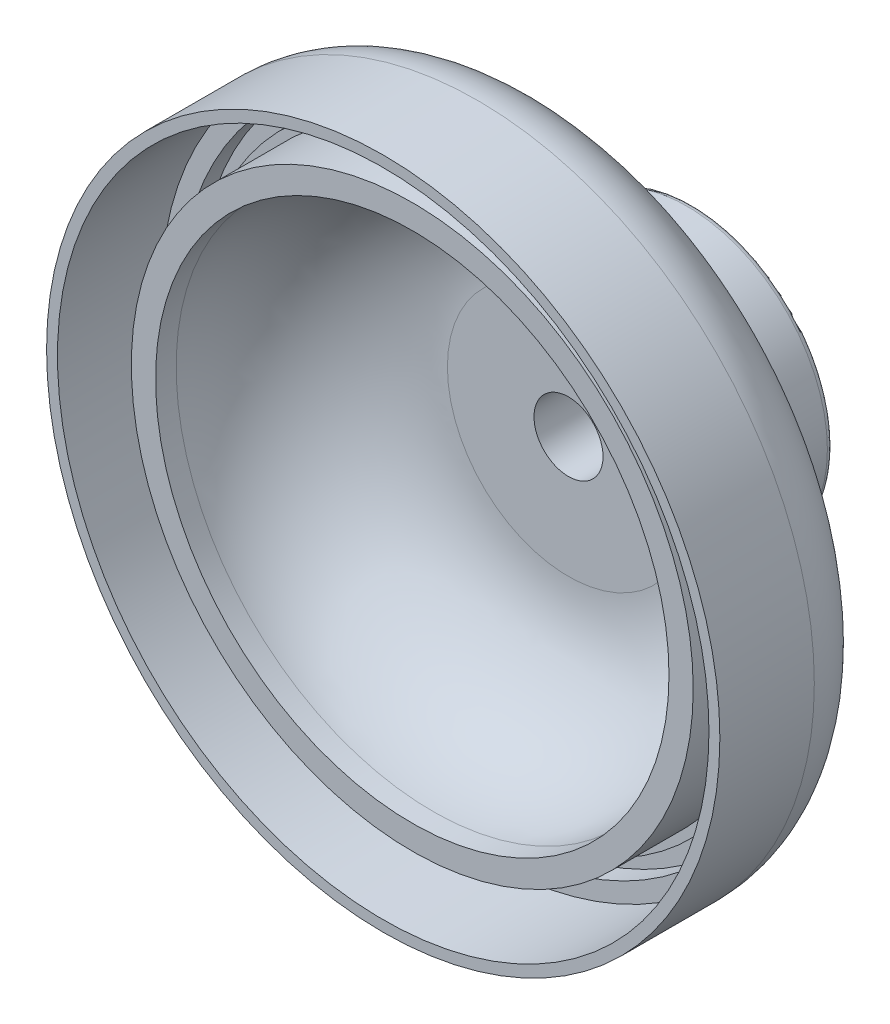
ISO-10303-21;
HEADER;
FILE_DESCRIPTION(('STEP AP214'),'2;1');
FILE_NAME('part.step','',(''),(''),'','','');
FILE_SCHEMA(('AUTOMOTIVE_DESIGN { 1 0 10303 214 1 1 1 1 }'));
ENDSEC;
DATA;
#1=APPLICATION_CONTEXT('core data for automotive mechanical design processes');
#2=APPLICATION_PROTOCOL_DEFINITION('international standard','automotive_design',2000,#1);
#3=PRODUCT_CONTEXT('',#1,'mechanical');
#4=PRODUCT('Part','Part','',(#3));
#5=PRODUCT_RELATED_PRODUCT_CATEGORY('part','',(#4));
#6=PRODUCT_DEFINITION_FORMATION('','',#4);
#7=PRODUCT_DEFINITION_CONTEXT('part definition',#1,'design');
#8=PRODUCT_DEFINITION('design','',#6,#7);
#9=PRODUCT_DEFINITION_SHAPE('','',#8);
#10=(LENGTH_UNIT() NAMED_UNIT(*) SI_UNIT(.MILLI.,.METRE.));
#11=(NAMED_UNIT(*) PLANE_ANGLE_UNIT() SI_UNIT($,.RADIAN.));
#12=(NAMED_UNIT(*) SI_UNIT($,.STERADIAN.) SOLID_ANGLE_UNIT());
#13=UNCERTAINTY_MEASURE_WITH_UNIT(LENGTH_MEASURE(1.E-05),#10,'distance_accuracy_value','');
#14=(GEOMETRIC_REPRESENTATION_CONTEXT(3) GLOBAL_UNCERTAINTY_ASSIGNED_CONTEXT((#13)) GLOBAL_UNIT_ASSIGNED_CONTEXT((#10,
#11,#12)) REPRESENTATION_CONTEXT('',''));
#15=CARTESIAN_POINT('',(0.,0.,0.));
#16=DIRECTION('',(0.,0.,1.));
#17=DIRECTION('',(1.,0.,0.));
#18=AXIS2_PLACEMENT_3D('',#15,#16,#17);
#19=CARTESIAN_POINT('',(-2.11299687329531,34.0975924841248,-273.847506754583));
#20=DIRECTION('',(0.,0.,1.));
#21=DIRECTION('',(0.,-1.,0.));
#22=AXIS2_PLACEMENT_3D('',#19,#20,#21);
#23=PLANE('',#22);
#24=CARTESIAN_POINT('',(0.,0.,-273.847506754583));
#25=DIRECTION('',(0.,0.,1.));
#26=DIRECTION('',(1.,0.,0.));
#27=AXIS2_PLACEMENT_3D('',#24,#25,#26);
#28=CIRCLE('',#27,34.163);
#29=CARTESIAN_POINT('',(34.163,0.,-273.847506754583));
#30=VERTEX_POINT('',#29);
#31=EDGE_CURVE('E1124',#30,#30,#28,.F.);
#32=ORIENTED_EDGE('',*,*,#31,.T.);
#33=EDGE_LOOP('',(#32));
#34=FACE_BOUND('',#33,.T.);
#35=CARTESIAN_POINT('',(0.,0.,-273.847506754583));
#36=DIRECTION('',(0.,0.,1.));
#37=DIRECTION('',(1.,0.,0.));
#38=AXIS2_PLACEMENT_3D('',#35,#36,#37);
#39=CIRCLE('',#38,35.306);
#40=CARTESIAN_POINT('',(35.306,0.,-273.847506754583));
#41=VERTEX_POINT('',#40);
#42=EDGE_CURVE('E1127',#41,#41,#39,.F.);
#43=ORIENTED_EDGE('',*,*,#42,.F.);
#44=EDGE_LOOP('',(#43));
#45=FACE_BOUND('',#44,.T.);
#46=ADVANCED_FACE('F25',(#34,#45),#23,.T.);
#47=CARTESIAN_POINT('',(0.,0.,-316.543264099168));
#48=DIRECTION('',(0.,0.,1.));
#49=DIRECTION('',(1.,0.,0.));
#50=AXIS2_PLACEMENT_3D('',#47,#48,#49);
#51=CYLINDRICAL_SURFACE('',#50,35.306);
#52=ORIENTED_EDGE('',*,*,#42,.T.);
#53=EDGE_LOOP('',(#52));
#54=FACE_BOUND('',#53,.T.);
#55=CARTESIAN_POINT('',(0.,0.,-283.753506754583));
#56=DIRECTION('',(0.,0.,-1.));
#57=DIRECTION('',(-0.0618504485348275,0.998085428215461,0.));
#58=AXIS2_PLACEMENT_3D('',#55,#56,#57);
#59=CIRCLE('',#58,35.306);
#60=CARTESIAN_POINT('',(-2.18369193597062,35.2384041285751,-283.753506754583));
#61=VERTEX_POINT('',#60);
#62=EDGE_CURVE('E1123',#61,#61,#59,.T.);
#63=ORIENTED_EDGE('',*,*,#62,.F.);
#64=EDGE_LOOP('',(#63));
#65=FACE_BOUND('',#64,.T.);
#66=ADVANCED_FACE('F246',(#54,#65),#51,.T.);
#67=CARTESIAN_POINT('',(0.,0.,-316.543264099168));
#68=DIRECTION('',(0.,0.,1.));
#69=DIRECTION('',(1.,0.,0.));
#70=AXIS2_PLACEMENT_3D('',#67,#68,#69);
#71=CYLINDRICAL_SURFACE('',#70,34.163);
#72=CARTESIAN_POINT('',(0.,0.,-284.693306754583));
#73=DIRECTION('',(0.,0.,1.));
#74=DIRECTION('',(1.,0.,0.));
#75=AXIS2_PLACEMENT_3D('',#72,#73,#74);
#76=CIRCLE('',#75,34.163);
#77=CARTESIAN_POINT('',(34.163,0.,-284.693306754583));
#78=VERTEX_POINT('',#77);
#79=EDGE_CURVE('E1120',#78,#78,#76,.T.);
#80=ORIENTED_EDGE('',*,*,#79,.F.);
#81=EDGE_LOOP('',(#80));
#82=FACE_BOUND('',#81,.T.);
#83=ORIENTED_EDGE('',*,*,#31,.F.);
#84=EDGE_LOOP('',(#83));
#85=FACE_BOUND('',#84,.T.);
#86=ADVANCED_FACE('F242',(#82,#85),#71,.F.);
#87=CARTESIAN_POINT('',(0.,0.,-283.753506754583));
#88=DIRECTION('',(0.,0.,-1.));
#89=DIRECTION('',(-0.0618504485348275,0.998085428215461,0.));
#90=AXIS2_PLACEMENT_3D('',#87,#88,#89);
#91=TOROIDAL_SURFACE('',#90,27.9335402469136,7.37245975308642);
#92=ORIENTED_EDGE('',*,*,#62,.T.);
#93=EDGE_LOOP('',(#92));
#94=FACE_BOUND('',#93,.T.);
#95=CARTESIAN_POINT('',(0.,0.,-290.469413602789));
#96=DIRECTION('',(0.,0.,1.));
#97=DIRECTION('',(0.0618504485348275,-0.998085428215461,0.));
#98=AXIS2_PLACEMENT_3D('',#95,#96,#97);
#99=CIRCLE('',#98,30.9748817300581);
#100=CARTESIAN_POINT('',(1.91581032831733,-30.9155780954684,-290.469413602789));
#101=VERTEX_POINT('',#100);
#102=EDGE_CURVE('E234',#101,#101,#99,.F.);
#103=ORIENTED_EDGE('',*,*,#102,.F.);
#104=EDGE_LOOP('',(#103));
#105=FACE_BOUND('',#104,.T.);
#106=ADVANCED_FACE('F237',(#94,#105),#91,.T.);
#107=CARTESIAN_POINT('',(-2.11299687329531,34.0975924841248,-284.693306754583));
#108=DIRECTION('',(0.,0.,1.));
#109=DIRECTION('',(0.,-1.,0.));
#110=AXIS2_PLACEMENT_3D('',#107,#108,#109);
#111=PLANE('',#110);
#112=CARTESIAN_POINT('',(0.,0.,-284.693306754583));
#113=DIRECTION('',(0.,0.,1.));
#114=DIRECTION('',(1.,0.,0.));
#115=AXIS2_PLACEMENT_3D('',#112,#113,#114);
#116=CIRCLE('',#115,32.258);
#117=CARTESIAN_POINT('',(32.258,0.,-284.693306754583));
#118=VERTEX_POINT('',#117);
#119=EDGE_CURVE('E231',#118,#118,#116,.F.);
#120=ORIENTED_EDGE('',*,*,#119,.T.);
#121=EDGE_LOOP('',(#120));
#122=FACE_BOUND('',#121,.T.);
#123=ORIENTED_EDGE('',*,*,#79,.T.);
#124=EDGE_LOOP('',(#123));
#125=FACE_BOUND('',#124,.T.);
#126=ADVANCED_FACE('F241',(#122,#125),#111,.T.);
#127=CARTESIAN_POINT('',(0.,0.,-290.469413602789));
#128=DIRECTION('',(0.,0.,1.));
#129=DIRECTION('',(1.,0.,0.));
#130=AXIS2_PLACEMENT_3D('',#127,#128,#129);
#131=CONICAL_SURFACE('',#130,30.9748817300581,1.14556954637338);
#132=CARTESIAN_POINT('',(0.,0.,-297.825106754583));
#133=DIRECTION('',(0.,0.,1.));
#134=DIRECTION('',(1.,0.,0.));
#135=AXIS2_PLACEMENT_3D('',#132,#133,#134);
#136=CIRCLE('',#135,14.732);
#137=CARTESIAN_POINT('',(14.732,0.,-297.825106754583));
#138=VERTEX_POINT('',#137);
#139=EDGE_CURVE('E228',#138,#138,#136,.F.);
#140=ORIENTED_EDGE('',*,*,#139,.F.);
#141=EDGE_LOOP('',(#140));
#142=FACE_BOUND('',#141,.T.);
#143=ORIENTED_EDGE('',*,*,#102,.T.);
#144=EDGE_LOOP('',(#143));
#145=FACE_BOUND('',#144,.T.);
#146=ADVANCED_FACE('F1194',(#142,#145),#131,.T.);
#147=CARTESIAN_POINT('',(0.,0.,-302.346306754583));
#148=DIRECTION('',(0.,0.,-1.));
#149=DIRECTION('',(0.,1.,0.));
#150=AXIS2_PLACEMENT_3D('',#147,#148,#149);
#151=PLANE('',#150);
#152=CARTESIAN_POINT('',(0.,0.,-302.346306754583));
#153=DIRECTION('',(0.,0.,1.));
#154=DIRECTION('',(1.,0.,0.));
#155=AXIS2_PLACEMENT_3D('',#152,#153,#154);
#156=CIRCLE('',#155,9.525);
#157=CARTESIAN_POINT('',(-9.44300175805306,1.24713383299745,-302.346306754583));
#158=VERTEX_POINT('',#157);
#159=CARTESIAN_POINT('',(-2.41598488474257,9.21350324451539,-302.346306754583));
#160=VERTEX_POINT('',#159);
#161=EDGE_CURVE('E204',#158,#160,#156,.F.);
#162=ORIENTED_EDGE('',*,*,#161,.F.);
#163=DIRECTION('',(0.998085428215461,0.0618504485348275,0.));
#164=VECTOR('',#163,1.);
#165=CARTESIAN_POINT('',(-9.44300175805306,1.24713383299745,-302.346306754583));
#166=LINE('',#165,#164);
#167=CARTESIAN_POINT('',(-12.8103780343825,1.03846057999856,-302.346306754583));
#168=VERTEX_POINT('',#167);
#169=EDGE_CURVE('E198',#158,#168,#166,.F.);
#170=ORIENTED_EDGE('',*,*,#169,.T.);
#171=CARTESIAN_POINT('',(0.,0.,-302.346306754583));
#172=DIRECTION('',(0.,0.,1.));
#173=DIRECTION('',(1.,0.,0.));
#174=AXIS2_PLACEMENT_3D('',#171,#172,#173);
#175=CIRCLE('',#174,12.8524);
#176=CARTESIAN_POINT('',(-2.62469904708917,12.581539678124,-302.346306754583));
#177=VERTEX_POINT('',#176);
#178=EDGE_CURVE('E220',#168,#177,#175,.F.);
#179=ORIENTED_EDGE('',*,*,#178,.T.);
#180=DIRECTION('',(-0.0618504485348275,0.998085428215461,0.));
#181=VECTOR('',#180,1.);
#182=CARTESIAN_POINT('',(-2.41598488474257,9.21350324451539,-302.346306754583));
#183=LINE('',#182,#181);
#184=EDGE_CURVE('E213',#177,#160,#183,.F.);
#185=ORIENTED_EDGE('',*,*,#184,.T.);
#186=EDGE_LOOP('',(#162,#170,#179,#185));
#187=FACE_BOUND('',#186,.T.);
#188=ADVANCED_FACE('F223',(#187),#151,.T.);
#189=CARTESIAN_POINT('',(0.,0.,-302.346306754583));
#190=DIRECTION('',(0.,0.,-1.));
#191=DIRECTION('',(0.,1.,0.));
#192=AXIS2_PLACEMENT_3D('',#189,#190,#191);
#193=PLANE('',#192);
#194=CARTESIAN_POINT('',(0.,0.,-302.346306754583));
#195=DIRECTION('',(0.,0.,1.));
#196=DIRECTION('',(1.,0.,0.));
#197=AXIS2_PLACEMENT_3D('',#194,#195,#196);
#198=CIRCLE('',#197,9.525);
#199=CARTESIAN_POINT('',(-1.25996374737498,-9.44129844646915,-302.346306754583));
#200=VERTEX_POINT('',#199);
#201=CARTESIAN_POINT('',(-9.21021103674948,-2.42850523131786,-302.346306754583));
#202=VERTEX_POINT('',#201);
#203=EDGE_CURVE('E1079',#200,#202,#198,.F.);
#204=ORIENTED_EDGE('',*,*,#203,.F.);
#205=DIRECTION('',(-0.0618504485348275,0.998085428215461,0.));
#206=VECTOR('',#205,1.);
#207=CARTESIAN_POINT('',(-1.05124958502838,-12.8093348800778,-302.346306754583));
#208=LINE('',#207,#206);
#209=CARTESIAN_POINT('',(-1.05124958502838,-12.8093348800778,-302.346306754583));
#210=VERTEX_POINT('',#209);
#211=EDGE_CURVE('E1080',#200,#210,#208,.F.);
#212=ORIENTED_EDGE('',*,*,#211,.T.);
#213=CARTESIAN_POINT('',(0.,0.,-302.346306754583));
#214=DIRECTION('',(0.,0.,1.));
#215=DIRECTION('',(1.,0.,0.));
#216=AXIS2_PLACEMENT_3D('',#213,#214,#215);
#217=CIRCLE('',#216,12.8524);
#218=CARTESIAN_POINT('',(-12.5789126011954,-2.63726061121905,-302.346306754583));
#219=VERTEX_POINT('',#218);
#220=EDGE_CURVE('E1064',#210,#219,#217,.F.);
#221=ORIENTED_EDGE('',*,*,#220,.T.);
#222=DIRECTION('',(-0.998085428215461,-0.0618504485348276,0.));
#223=VECTOR('',#222,1.);
#224=CARTESIAN_POINT('',(-12.5789126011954,-2.63726061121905,-302.346306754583));
#225=LINE('',#224,#223);
#226=EDGE_CURVE('E1073',#219,#202,#225,.F.);
#227=ORIENTED_EDGE('',*,*,#226,.T.);
#228=EDGE_LOOP('',(#204,#212,#221,#227));
#229=FACE_BOUND('',#228,.T.);
#230=ADVANCED_FACE('F1201',(#229),#193,.T.);
#231=CARTESIAN_POINT('',(0.,0.,-302.346306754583));
#232=DIRECTION('',(0.,0.,-1.));
#233=DIRECTION('',(0.,1.,0.));
#234=AXIS2_PLACEMENT_3D('',#231,#232,#233);
#235=PLANE('',#234);
#236=CARTESIAN_POINT('',(0.,0.,-302.346306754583));
#237=DIRECTION('',(0.,0.,1.));
#238=DIRECTION('',(1.,0.,0.));
#239=AXIS2_PLACEMENT_3D('',#236,#237,#238);
#240=CIRCLE('',#239,12.8524);
#241=CARTESIAN_POINT('',(1.05124958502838,12.8093348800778,-302.346306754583));
#242=VERTEX_POINT('',#241);
#243=CARTESIAN_POINT('',(12.5841538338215,2.61213668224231,-302.346306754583));
#244=VERTEX_POINT('',#243);
#245=EDGE_CURVE('E1041',#242,#244,#240,.F.);
#246=ORIENTED_EDGE('',*,*,#245,.T.);
#247=DIRECTION('',(0.998085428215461,0.0618504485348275,0.));
#248=VECTOR('',#247,1.);
#249=CARTESIAN_POINT('',(12.5841538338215,2.61213668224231,-302.346306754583));
#250=LINE('',#249,#248);
#251=CARTESIAN_POINT('',(9.21677755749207,2.40346342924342,-302.346306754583));
#252=VERTEX_POINT('',#251);
#253=EDGE_CURVE('E1050',#244,#252,#250,.F.);
#254=ORIENTED_EDGE('',*,*,#253,.T.);
#255=CARTESIAN_POINT('',(0.,0.,-302.346306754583));
#256=DIRECTION('',(0.,0.,1.));
#257=DIRECTION('',(1.,0.,0.));
#258=AXIS2_PLACEMENT_3D('',#255,#256,#257);
#259=CIRCLE('',#258,9.525);
#260=CARTESIAN_POINT('',(1.25996374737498,9.44129844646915,-302.346306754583));
#261=VERTEX_POINT('',#260);
#262=EDGE_CURVE('E1056',#261,#252,#259,.F.);
#263=ORIENTED_EDGE('',*,*,#262,.F.);
#264=DIRECTION('',(0.0618504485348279,-0.998085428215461,0.));
#265=VECTOR('',#264,1.);
#266=CARTESIAN_POINT('',(1.05124958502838,12.8093348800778,-302.346306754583));
#267=LINE('',#266,#265);
#268=EDGE_CURVE('E1057',#261,#242,#267,.F.);
#269=ORIENTED_EDGE('',*,*,#268,.T.);
#270=EDGE_LOOP('',(#246,#254,#263,#269));
#271=FACE_BOUND('',#270,.T.);
#272=ADVANCED_FACE('F1162',(#271),#235,.T.);
#273=CARTESIAN_POINT('',(0.,0.,-302.346306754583));
#274=DIRECTION('',(0.,0.,-1.));
#275=DIRECTION('',(0.,1.,0.));
#276=AXIS2_PLACEMENT_3D('',#273,#274,#275);
#277=PLANE('',#276);
#278=CARTESIAN_POINT('',(0.,0.,-302.346306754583));
#279=DIRECTION('',(0.,0.,1.));
#280=DIRECTION('',(1.,0.,0.));
#281=AXIS2_PLACEMENT_3D('',#278,#279,#280);
#282=CIRCLE('',#281,12.8524);
#283=CARTESIAN_POINT('',(12.808278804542,-1.06403939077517,-302.346306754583));
#284=VERTEX_POINT('',#283);
#285=CARTESIAN_POINT('',(2.62469904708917,-12.581539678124,-302.346306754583));
#286=VERTEX_POINT('',#285);
#287=EDGE_CURVE('E1017',#284,#286,#282,.F.);
#288=ORIENTED_EDGE('',*,*,#287,.T.);
#289=DIRECTION('',(0.0618504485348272,-0.998085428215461,0.));
#290=VECTOR('',#289,1.);
#291=CARTESIAN_POINT('',(2.41598488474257,-9.21350324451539,-302.346306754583));
#292=LINE('',#291,#290);
#293=CARTESIAN_POINT('',(2.41598488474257,-9.21350324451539,-302.346306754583));
#294=VERTEX_POINT('',#293);
#295=EDGE_CURVE('E1027',#286,#294,#292,.F.);
#296=ORIENTED_EDGE('',*,*,#295,.T.);
#297=CARTESIAN_POINT('',(0.,0.,-302.346306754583));
#298=DIRECTION('',(0.,0.,1.));
#299=DIRECTION('',(1.,0.,0.));
#300=AXIS2_PLACEMENT_3D('',#297,#298,#299);
#301=CIRCLE('',#300,9.525);
#302=CARTESIAN_POINT('',(9.43957724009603,-1.27279477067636,-302.346306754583));
#303=VERTEX_POINT('',#302);
#304=EDGE_CURVE('E1033',#303,#294,#301,.F.);
#305=ORIENTED_EDGE('',*,*,#304,.F.);
#306=DIRECTION('',(-0.998085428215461,-0.0618504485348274,0.));
#307=VECTOR('',#306,1.);
#308=CARTESIAN_POINT('',(9.43957724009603,-1.27279477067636,-302.346306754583));
#309=LINE('',#308,#307);
#310=EDGE_CURVE('E1034',#303,#284,#309,.F.);
#311=ORIENTED_EDGE('',*,*,#310,.T.);
#312=EDGE_LOOP('',(#288,#296,#305,#311));
#313=FACE_BOUND('',#312,.T.);
#314=ADVANCED_FACE('F1210',(#313),#277,.T.);
#315=CARTESIAN_POINT('',(0.,0.,-316.543264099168));
#316=DIRECTION('',(0.,0.,1.));
#317=DIRECTION('',(1.,0.,0.));
#318=AXIS2_PLACEMENT_3D('',#315,#316,#317);
#319=CYLINDRICAL_SURFACE('',#318,32.258);
#320=CARTESIAN_POINT('',(0.,0.,-286.801506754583));
#321=DIRECTION('',(0.,0.,1.));
#322=DIRECTION('',(1.,0.,0.));
#323=AXIS2_PLACEMENT_3D('',#320,#321,#322);
#324=CIRCLE('',#323,32.258);
#325=CARTESIAN_POINT('',(32.258,0.,-286.801506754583));
#326=VERTEX_POINT('',#325);
#327=EDGE_CURVE('E1022',#326,#326,#324,.T.);
#328=ORIENTED_EDGE('',*,*,#327,.F.);
#329=EDGE_LOOP('',(#328));
#330=FACE_BOUND('',#329,.T.);
#331=ORIENTED_EDGE('',*,*,#119,.F.);
#332=EDGE_LOOP('',(#331));
#333=FACE_BOUND('',#332,.T.);
#334=ADVANCED_FACE('F1213',(#330,#333),#319,.F.);
#335=CARTESIAN_POINT('',(0.,0.,-316.543264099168));
#336=DIRECTION('',(0.,0.,1.));
#337=DIRECTION('',(1.,0.,0.));
#338=AXIS2_PLACEMENT_3D('',#335,#336,#337);
#339=CYLINDRICAL_SURFACE('',#338,14.732);
#340=ORIENTED_EDGE('',*,*,#139,.T.);
#341=EDGE_LOOP('',(#340));
#342=FACE_BOUND('',#341,.T.);
#343=CARTESIAN_POINT('',(0.,0.,-305.699106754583));
#344=DIRECTION('',(0.,0.,-1.));
#345=DIRECTION('',(-0.0618504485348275,0.998085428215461,0.));
#346=AXIS2_PLACEMENT_3D('',#343,#344,#345);
#347=CIRCLE('',#346,14.732);
#348=CARTESIAN_POINT('',(-0.911180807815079,14.7037945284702,-305.699106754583));
#349=VERTEX_POINT('',#348);
#350=EDGE_CURVE('E991',#349,#349,#347,.T.);
#351=ORIENTED_EDGE('',*,*,#350,.F.);
#352=EDGE_LOOP('',(#351));
#353=FACE_BOUND('',#352,.T.);
#354=ADVANCED_FACE('F1217',(#342,#353),#339,.T.);
#355=CARTESIAN_POINT('',(-9.44300175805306,1.24713383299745,-302.346306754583));
#356=DIRECTION('',(0.0618504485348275,-0.998085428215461,0.));
#357=DIRECTION('',(0.998085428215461,0.0618504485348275,0.));
#358=AXIS2_PLACEMENT_3D('',#355,#356,#357);
#359=PLANE('',#358);
#360=DIRECTION('',(-0.998085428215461,-0.0618504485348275,0.));
#361=VECTOR('',#360,1.);
#362=CARTESIAN_POINT('',(-9.44300175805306,1.24713383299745,-305.699106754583));
#363=LINE('',#362,#361);
#364=CARTESIAN_POINT('',(-12.8103780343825,1.03846057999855,-305.699106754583));
#365=VERTEX_POINT('',#364);
#366=CARTESIAN_POINT('',(-9.44300175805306,1.24713383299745,-305.699106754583));
#367=VERTEX_POINT('',#366);
#368=EDGE_CURVE('E984',#365,#367,#363,.F.);
#369=ORIENTED_EDGE('',*,*,#368,.F.);
#370=DIRECTION('',(0.,0.,1.));
#371=VECTOR('',#370,1.);
#372=CARTESIAN_POINT('',(-12.8103780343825,1.03846057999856,-302.346306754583));
#373=LINE('',#372,#371);
#374=EDGE_CURVE('E1085',#365,#168,#373,.T.);
#375=ORIENTED_EDGE('',*,*,#374,.T.);
#376=ORIENTED_EDGE('',*,*,#169,.F.);
#377=DIRECTION('',(0.,0.,1.));
#378=VECTOR('',#377,1.);
#379=CARTESIAN_POINT('',(-9.44300175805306,1.24713383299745,-302.346306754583));
#380=LINE('',#379,#378);
#381=EDGE_CURVE('E210',#367,#158,#380,.T.);
#382=ORIENTED_EDGE('',*,*,#381,.F.);
#383=EDGE_LOOP('',(#369,#375,#376,#382));
#384=FACE_BOUND('',#383,.T.);
#385=ADVANCED_FACE('F1221',(#384),#359,.F.);
#386=CARTESIAN_POINT('',(0.,0.,-302.346306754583));
#387=DIRECTION('',(0.,0.,1.));
#388=DIRECTION('',(1.,0.,0.));
#389=AXIS2_PLACEMENT_3D('',#386,#387,#388);
#390=CYLINDRICAL_SURFACE('',#389,9.525);
#391=ORIENTED_EDGE('',*,*,#381,.T.);
#392=ORIENTED_EDGE('',*,*,#161,.T.);
#393=DIRECTION('',(0.,0.,1.));
#394=VECTOR('',#393,1.);
#395=CARTESIAN_POINT('',(-2.41598488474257,9.21350324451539,-302.346306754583));
#396=LINE('',#395,#394);
#397=CARTESIAN_POINT('',(-2.41598488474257,9.21350324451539,-305.699106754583));
#398=VERTEX_POINT('',#397);
#399=EDGE_CURVE('E208',#160,#398,#396,.F.);
#400=ORIENTED_EDGE('',*,*,#399,.T.);
#401=CARTESIAN_POINT('',(0.,0.,-305.699106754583));
#402=DIRECTION('',(0.,0.,-1.));
#403=DIRECTION('',(-0.0618504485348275,0.998085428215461,0.));
#404=AXIS2_PLACEMENT_3D('',#401,#402,#403);
#405=CIRCLE('',#404,9.525);
#406=EDGE_CURVE('E948',#367,#398,#405,.T.);
#407=ORIENTED_EDGE('',*,*,#406,.F.);
#408=EDGE_LOOP('',(#391,#392,#400,#407));
#409=FACE_BOUND('',#408,.T.);
#410=ADVANCED_FACE('F206',(#409),#390,.T.);
#411=CARTESIAN_POINT('',(-2.41598488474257,9.21350324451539,-302.346306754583));
#412=DIRECTION('',(0.998085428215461,0.0618504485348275,0.));
#413=DIRECTION('',(-0.0618504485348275,0.998085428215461,0.));
#414=AXIS2_PLACEMENT_3D('',#411,#412,#413);
#415=PLANE('',#414);
#416=DIRECTION('',(0.0618504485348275,-0.998085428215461,0.));
#417=VECTOR('',#416,1.);
#418=CARTESIAN_POINT('',(-2.41598488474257,9.21350324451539,-305.699106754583));
#419=LINE('',#418,#417);
#420=CARTESIAN_POINT('',(-2.62469904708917,12.581539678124,-305.699106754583));
#421=VERTEX_POINT('',#420);
#422=EDGE_CURVE('E219',#398,#421,#419,.F.);
#423=ORIENTED_EDGE('',*,*,#422,.F.);
#424=ORIENTED_EDGE('',*,*,#399,.F.);
#425=ORIENTED_EDGE('',*,*,#184,.F.);
#426=DIRECTION('',(0.,0.,1.));
#427=VECTOR('',#426,1.);
#428=CARTESIAN_POINT('',(-2.62469904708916,12.581539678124,-302.346306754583));
#429=LINE('',#428,#427);
#430=EDGE_CURVE('E1083',#177,#421,#429,.F.);
#431=ORIENTED_EDGE('',*,*,#430,.T.);
#432=EDGE_LOOP('',(#423,#424,#425,#431));
#433=FACE_BOUND('',#432,.T.);
#434=ADVANCED_FACE('F216',(#433),#415,.F.);
#435=CARTESIAN_POINT('',(0.,0.,-302.346306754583));
#436=DIRECTION('',(0.,0.,1.));
#437=DIRECTION('',(1.,0.,0.));
#438=AXIS2_PLACEMENT_3D('',#435,#436,#437);
#439=CYLINDRICAL_SURFACE('',#438,12.8524);
#440=CARTESIAN_POINT('',(0.,0.,-305.699106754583));
#441=DIRECTION('',(0.,0.,-1.));
#442=DIRECTION('',(-0.0618504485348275,0.998085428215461,0.));
#443=AXIS2_PLACEMENT_3D('',#440,#441,#442);
#444=CIRCLE('',#443,12.8524);
#445=EDGE_CURVE('E854',#421,#365,#444,.F.);
#446=ORIENTED_EDGE('',*,*,#445,.F.);
#447=ORIENTED_EDGE('',*,*,#430,.F.);
#448=ORIENTED_EDGE('',*,*,#178,.F.);
#449=ORIENTED_EDGE('',*,*,#374,.F.);
#450=EDGE_LOOP('',(#446,#447,#448,#449));
#451=FACE_BOUND('',#450,.T.);
#452=ADVANCED_FACE('F1229',(#451),#439,.F.);
#453=CARTESIAN_POINT('',(-1.05124958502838,-12.8093348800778,-302.346306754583));
#454=DIRECTION('',(0.998085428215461,0.0618504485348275,0.));
#455=DIRECTION('',(-0.0618504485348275,0.998085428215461,0.));
#456=AXIS2_PLACEMENT_3D('',#453,#454,#455);
#457=PLANE('',#456);
#458=DIRECTION('',(0.0618504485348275,-0.998085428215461,0.));
#459=VECTOR('',#458,1.);
#460=CARTESIAN_POINT('',(-1.05124958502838,-12.8093348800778,-305.699106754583));
#461=LINE('',#460,#459);
#462=CARTESIAN_POINT('',(-1.05124958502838,-12.8093348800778,-305.699106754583));
#463=VERTEX_POINT('',#462);
#464=CARTESIAN_POINT('',(-1.25996374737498,-9.44129844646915,-305.699106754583));
#465=VERTEX_POINT('',#464);
#466=EDGE_CURVE('E847',#463,#465,#461,.F.);
#467=ORIENTED_EDGE('',*,*,#466,.F.);
#468=DIRECTION('',(0.,0.,1.));
#469=VECTOR('',#468,1.);
#470=CARTESIAN_POINT('',(-1.05124958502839,-12.8093348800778,-302.346306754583));
#471=LINE('',#470,#469);
#472=EDGE_CURVE('E1063',#463,#210,#471,.T.);
#473=ORIENTED_EDGE('',*,*,#472,.T.);
#474=ORIENTED_EDGE('',*,*,#211,.F.);
#475=DIRECTION('',(0.,0.,1.));
#476=VECTOR('',#475,1.);
#477=CARTESIAN_POINT('',(-1.25996374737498,-9.44129844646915,-302.346306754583));
#478=LINE('',#477,#476);
#479=EDGE_CURVE('E1076',#465,#200,#478,.T.);
#480=ORIENTED_EDGE('',*,*,#479,.F.);
#481=EDGE_LOOP('',(#467,#473,#474,#480));
#482=FACE_BOUND('',#481,.T.);
#483=ADVANCED_FACE('F1232',(#482),#457,.F.);
#484=CARTESIAN_POINT('',(0.,0.,-302.346306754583));
#485=DIRECTION('',(0.,0.,1.));
#486=DIRECTION('',(1.,0.,0.));
#487=AXIS2_PLACEMENT_3D('',#484,#485,#486);
#488=CYLINDRICAL_SURFACE('',#487,9.525);
#489=ORIENTED_EDGE('',*,*,#479,.T.);
#490=ORIENTED_EDGE('',*,*,#203,.T.);
#491=DIRECTION('',(0.,0.,1.));
#492=VECTOR('',#491,1.);
#493=CARTESIAN_POINT('',(-9.21021103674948,-2.42850523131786,-302.346306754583));
#494=LINE('',#493,#492);
#495=CARTESIAN_POINT('',(-9.21021103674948,-2.42850523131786,-305.699106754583));
#496=VERTEX_POINT('',#495);
#497=EDGE_CURVE('E1071',#202,#496,#494,.F.);
#498=ORIENTED_EDGE('',*,*,#497,.T.);
#499=CARTESIAN_POINT('',(0.,0.,-305.699106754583));
#500=DIRECTION('',(0.,0.,-1.));
#501=DIRECTION('',(-0.0618504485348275,0.998085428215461,0.));
#502=AXIS2_PLACEMENT_3D('',#499,#500,#501);
#503=CIRCLE('',#502,9.525);
#504=EDGE_CURVE('E811',#465,#496,#503,.T.);
#505=ORIENTED_EDGE('',*,*,#504,.F.);
#506=EDGE_LOOP('',(#489,#490,#498,#505));
#507=FACE_BOUND('',#506,.T.);
#508=ADVANCED_FACE('F1236',(#507),#488,.T.);
#509=CARTESIAN_POINT('',(-12.5789126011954,-2.63726061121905,-302.346306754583));
#510=DIRECTION('',(-0.0618504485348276,0.998085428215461,0.));
#511=DIRECTION('',(-0.998085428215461,-0.0618504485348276,0.));
#512=AXIS2_PLACEMENT_3D('',#509,#510,#511);
#513=PLANE('',#512);
#514=DIRECTION('',(0.998085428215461,0.0618504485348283,0.));
#515=VECTOR('',#514,1.);
#516=CARTESIAN_POINT('',(-12.5789126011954,-2.63726061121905,-305.699106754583));
#517=LINE('',#516,#515);
#518=CARTESIAN_POINT('',(-12.5789126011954,-2.63726061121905,-305.699106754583));
#519=VERTEX_POINT('',#518);
#520=EDGE_CURVE('E779',#496,#519,#517,.F.);
#521=ORIENTED_EDGE('',*,*,#520,.F.);
#522=ORIENTED_EDGE('',*,*,#497,.F.);
#523=ORIENTED_EDGE('',*,*,#226,.F.);
#524=DIRECTION('',(0.,0.,1.));
#525=VECTOR('',#524,1.);
#526=CARTESIAN_POINT('',(-12.5789126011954,-2.63726061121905,-302.346306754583));
#527=LINE('',#526,#525);
#528=EDGE_CURVE('E1060',#219,#519,#527,.F.);
#529=ORIENTED_EDGE('',*,*,#528,.T.);
#530=EDGE_LOOP('',(#521,#522,#523,#529));
#531=FACE_BOUND('',#530,.T.);
#532=ADVANCED_FACE('F1240',(#531),#513,.F.);
#533=CARTESIAN_POINT('',(0.,0.,-302.346306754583));
#534=DIRECTION('',(0.,0.,1.));
#535=DIRECTION('',(1.,0.,0.));
#536=AXIS2_PLACEMENT_3D('',#533,#534,#535);
#537=CYLINDRICAL_SURFACE('',#536,12.8524);
#538=CARTESIAN_POINT('',(0.,0.,-305.699106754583));
#539=DIRECTION('',(0.,0.,-1.));
#540=DIRECTION('',(-0.0618504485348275,0.998085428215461,0.));
#541=AXIS2_PLACEMENT_3D('',#538,#539,#540);
#542=CIRCLE('',#541,12.8524);
#543=EDGE_CURVE('E714',#519,#463,#542,.F.);
#544=ORIENTED_EDGE('',*,*,#543,.F.);
#545=ORIENTED_EDGE('',*,*,#528,.F.);
#546=ORIENTED_EDGE('',*,*,#220,.F.);
#547=ORIENTED_EDGE('',*,*,#472,.F.);
#548=EDGE_LOOP('',(#544,#545,#546,#547));
#549=FACE_BOUND('',#548,.T.);
#550=ADVANCED_FACE('F1243',(#549),#537,.F.);
#551=CARTESIAN_POINT('',(1.05124958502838,12.8093348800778,-302.346306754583));
#552=DIRECTION('',(-0.998085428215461,-0.0618504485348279,0.));
#553=DIRECTION('',(0.0618504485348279,-0.998085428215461,0.));
#554=AXIS2_PLACEMENT_3D('',#551,#552,#553);
#555=PLANE('',#554);
#556=DIRECTION('',(-0.0618504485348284,0.998085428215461,0.));
#557=VECTOR('',#556,1.);
#558=CARTESIAN_POINT('',(1.05124958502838,12.8093348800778,-305.699106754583));
#559=LINE('',#558,#557);
#560=CARTESIAN_POINT('',(1.05124958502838,12.8093348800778,-305.699106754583));
#561=VERTEX_POINT('',#560);
#562=CARTESIAN_POINT('',(1.25996374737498,9.44129844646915,-305.699106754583));
#563=VERTEX_POINT('',#562);
#564=EDGE_CURVE('E707',#561,#563,#559,.F.);
#565=ORIENTED_EDGE('',*,*,#564,.F.);
#566=DIRECTION('',(0.,0.,1.));
#567=VECTOR('',#566,1.);
#568=CARTESIAN_POINT('',(1.05124958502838,12.8093348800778,-302.346306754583));
#569=LINE('',#568,#567);
#570=EDGE_CURVE('E1040',#561,#242,#569,.T.);
#571=ORIENTED_EDGE('',*,*,#570,.T.);
#572=ORIENTED_EDGE('',*,*,#268,.F.);
#573=DIRECTION('',(0.,0.,1.));
#574=VECTOR('',#573,1.);
#575=CARTESIAN_POINT('',(1.25996374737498,9.44129844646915,-302.346306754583));
#576=LINE('',#575,#574);
#577=EDGE_CURVE('E1053',#563,#261,#576,.T.);
#578=ORIENTED_EDGE('',*,*,#577,.F.);
#579=EDGE_LOOP('',(#565,#571,#572,#578));
#580=FACE_BOUND('',#579,.T.);
#581=ADVANCED_FACE('F1168',(#580),#555,.F.);
#582=CARTESIAN_POINT('',(0.,0.,-302.346306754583));
#583=DIRECTION('',(0.,0.,1.));
#584=DIRECTION('',(1.,0.,0.));
#585=AXIS2_PLACEMENT_3D('',#582,#583,#584);
#586=CYLINDRICAL_SURFACE('',#585,9.525);
#587=ORIENTED_EDGE('',*,*,#577,.T.);
#588=ORIENTED_EDGE('',*,*,#262,.T.);
#589=DIRECTION('',(0.,0.,1.));
#590=VECTOR('',#589,1.);
#591=CARTESIAN_POINT('',(9.21677755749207,2.40346342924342,-302.346306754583));
#592=LINE('',#591,#590);
#593=CARTESIAN_POINT('',(9.21677755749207,2.40346342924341,-305.699106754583));
#594=VERTEX_POINT('',#593);
#595=EDGE_CURVE('E1048',#252,#594,#592,.F.);
#596=ORIENTED_EDGE('',*,*,#595,.T.);
#597=CARTESIAN_POINT('',(0.,0.,-305.699106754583));
#598=DIRECTION('',(0.,0.,-1.));
#599=DIRECTION('',(-0.0618504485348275,0.998085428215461,0.));
#600=AXIS2_PLACEMENT_3D('',#597,#598,#599);
#601=CIRCLE('',#600,9.525);
#602=EDGE_CURVE('E671',#563,#594,#601,.T.);
#603=ORIENTED_EDGE('',*,*,#602,.F.);
#604=EDGE_LOOP('',(#587,#588,#596,#603));
#605=FACE_BOUND('',#604,.T.);
#606=ADVANCED_FACE('F1154',(#605),#586,.T.);
#607=CARTESIAN_POINT('',(12.5841538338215,2.61213668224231,-302.346306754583));
#608=DIRECTION('',(0.0618504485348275,-0.998085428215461,0.));
#609=DIRECTION('',(0.998085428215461,0.0618504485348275,0.));
#610=AXIS2_PLACEMENT_3D('',#607,#608,#609);
#611=PLANE('',#610);
#612=DIRECTION('',(-0.998085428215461,-0.0618504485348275,0.));
#613=VECTOR('',#612,1.);
#614=CARTESIAN_POINT('',(12.5841538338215,2.61213668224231,-305.699106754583));
#615=LINE('',#614,#613);
#616=CARTESIAN_POINT('',(12.5841538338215,2.61213668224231,-305.699106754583));
#617=VERTEX_POINT('',#616);
#618=EDGE_CURVE('E640',#594,#617,#615,.F.);
#619=ORIENTED_EDGE('',*,*,#618,.F.);
#620=ORIENTED_EDGE('',*,*,#595,.F.);
#621=ORIENTED_EDGE('',*,*,#253,.F.);
#622=DIRECTION('',(0.,0.,1.));
#623=VECTOR('',#622,1.);
#624=CARTESIAN_POINT('',(12.5841538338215,2.61213668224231,-302.346306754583));
#625=LINE('',#624,#623);
#626=EDGE_CURVE('E1037',#244,#617,#625,.F.);
#627=ORIENTED_EDGE('',*,*,#626,.T.);
#628=EDGE_LOOP('',(#619,#620,#621,#627));
#629=FACE_BOUND('',#628,.T.);
#630=ADVANCED_FACE('F1160',(#629),#611,.F.);
#631=CARTESIAN_POINT('',(0.,0.,-302.346306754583));
#632=DIRECTION('',(0.,0.,1.));
#633=DIRECTION('',(1.,0.,0.));
#634=AXIS2_PLACEMENT_3D('',#631,#632,#633);
#635=CYLINDRICAL_SURFACE('',#634,12.8524);
#636=CARTESIAN_POINT('',(0.,0.,-305.699106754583));
#637=DIRECTION('',(0.,0.,-1.));
#638=DIRECTION('',(-0.0618504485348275,0.998085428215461,0.));
#639=AXIS2_PLACEMENT_3D('',#636,#637,#638);
#640=CIRCLE('',#639,12.8524);
#641=EDGE_CURVE('E599',#617,#561,#640,.F.);
#642=ORIENTED_EDGE('',*,*,#641,.F.);
#643=ORIENTED_EDGE('',*,*,#626,.F.);
#644=ORIENTED_EDGE('',*,*,#245,.F.);
#645=ORIENTED_EDGE('',*,*,#570,.F.);
#646=EDGE_LOOP('',(#642,#643,#644,#645));
#647=FACE_BOUND('',#646,.T.);
#648=ADVANCED_FACE('F1165',(#647),#635,.F.);
#649=CARTESIAN_POINT('',(9.43957724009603,-1.27279477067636,-302.346306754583));
#650=DIRECTION('',(-0.0618504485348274,0.998085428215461,0.));
#651=DIRECTION('',(-0.998085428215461,-0.0618504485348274,0.));
#652=AXIS2_PLACEMENT_3D('',#649,#650,#651);
#653=PLANE('',#652);
#654=DIRECTION('',(0.998085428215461,0.0618504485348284,0.));
#655=VECTOR('',#654,1.);
#656=CARTESIAN_POINT('',(9.43957724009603,-1.27279477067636,-305.699106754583));
#657=LINE('',#656,#655);
#658=CARTESIAN_POINT('',(12.808278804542,-1.06403939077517,-305.699106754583));
#659=VERTEX_POINT('',#658);
#660=CARTESIAN_POINT('',(9.43957724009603,-1.27279477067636,-305.699106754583));
#661=VERTEX_POINT('',#660);
#662=EDGE_CURVE('E567',#659,#661,#657,.F.);
#663=ORIENTED_EDGE('',*,*,#662,.F.);
#664=DIRECTION('',(0.,0.,1.));
#665=VECTOR('',#664,1.);
#666=CARTESIAN_POINT('',(12.808278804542,-1.06403939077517,-302.346306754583));
#667=LINE('',#666,#665);
#668=EDGE_CURVE('E1016',#659,#284,#667,.T.);
#669=ORIENTED_EDGE('',*,*,#668,.T.);
#670=ORIENTED_EDGE('',*,*,#310,.F.);
#671=DIRECTION('',(0.,0.,1.));
#672=VECTOR('',#671,1.);
#673=CARTESIAN_POINT('',(9.43957724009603,-1.27279477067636,-302.346306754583));
#674=LINE('',#673,#672);
#675=EDGE_CURVE('E1030',#661,#303,#674,.T.);
#676=ORIENTED_EDGE('',*,*,#675,.F.);
#677=EDGE_LOOP('',(#663,#669,#670,#676));
#678=FACE_BOUND('',#677,.T.);
#679=ADVANCED_FACE('F1256',(#678),#653,.F.);
#680=CARTESIAN_POINT('',(0.,0.,-302.346306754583));
#681=DIRECTION('',(0.,0.,1.));
#682=DIRECTION('',(1.,0.,0.));
#683=AXIS2_PLACEMENT_3D('',#680,#681,#682);
#684=CYLINDRICAL_SURFACE('',#683,9.525);
#685=ORIENTED_EDGE('',*,*,#675,.T.);
#686=ORIENTED_EDGE('',*,*,#304,.T.);
#687=DIRECTION('',(0.,0.,1.));
#688=VECTOR('',#687,1.);
#689=CARTESIAN_POINT('',(2.41598488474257,-9.21350324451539,-302.346306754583));
#690=LINE('',#689,#688);
#691=CARTESIAN_POINT('',(2.41598488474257,-9.21350324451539,-305.699106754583));
#692=VERTEX_POINT('',#691);
#693=EDGE_CURVE('E1025',#294,#692,#690,.F.);
#694=ORIENTED_EDGE('',*,*,#693,.T.);
#695=CARTESIAN_POINT('',(0.,0.,-305.699106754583));
#696=DIRECTION('',(0.,0.,-1.));
#697=DIRECTION('',(-0.0618504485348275,0.998085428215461,0.));
#698=AXIS2_PLACEMENT_3D('',#695,#696,#697);
#699=CIRCLE('',#698,9.525);
#700=EDGE_CURVE('E532',#661,#692,#699,.T.);
#701=ORIENTED_EDGE('',*,*,#700,.F.);
#702=EDGE_LOOP('',(#685,#686,#694,#701));
#703=FACE_BOUND('',#702,.T.);
#704=ADVANCED_FACE('F1259',(#703),#684,.T.);
#705=CARTESIAN_POINT('',(2.41598488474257,-9.21350324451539,-302.346306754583));
#706=DIRECTION('',(-0.998085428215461,-0.0618504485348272,0.));
#707=DIRECTION('',(0.0618504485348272,-0.998085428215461,0.));
#708=AXIS2_PLACEMENT_3D('',#705,#706,#707);
#709=PLANE('',#708);
#710=DIRECTION('',(-0.0618504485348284,0.998085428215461,0.));
#711=VECTOR('',#710,1.);
#712=CARTESIAN_POINT('',(2.41598488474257,-9.21350324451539,-305.699106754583));
#713=LINE('',#712,#711);
#714=CARTESIAN_POINT('',(2.62469904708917,-12.581539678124,-305.699106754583));
#715=VERTEX_POINT('',#714);
#716=EDGE_CURVE('E500',#692,#715,#713,.F.);
#717=ORIENTED_EDGE('',*,*,#716,.F.);
#718=ORIENTED_EDGE('',*,*,#693,.F.);
#719=ORIENTED_EDGE('',*,*,#295,.F.);
#720=DIRECTION('',(0.,0.,1.));
#721=VECTOR('',#720,1.);
#722=CARTESIAN_POINT('',(2.62469904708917,-12.581539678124,-302.346306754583));
#723=LINE('',#722,#721);
#724=EDGE_CURVE('E1008',#286,#715,#723,.F.);
#725=ORIENTED_EDGE('',*,*,#724,.T.);
#726=EDGE_LOOP('',(#717,#718,#719,#725));
#727=FACE_BOUND('',#726,.T.);
#728=ADVANCED_FACE('F1263',(#727),#709,.F.);
#729=CARTESIAN_POINT('',(0.,0.,-302.346306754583));
#730=DIRECTION('',(0.,0.,1.));
#731=DIRECTION('',(1.,0.,0.));
#732=AXIS2_PLACEMENT_3D('',#729,#730,#731);
#733=CYLINDRICAL_SURFACE('',#732,12.8524);
#734=CARTESIAN_POINT('',(0.,0.,-305.699106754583));
#735=DIRECTION('',(0.,0.,-1.));
#736=DIRECTION('',(-0.0618504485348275,0.998085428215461,0.));
#737=AXIS2_PLACEMENT_3D('',#734,#735,#736);
#738=CIRCLE('',#737,12.8524);
#739=EDGE_CURVE('E460',#715,#659,#738,.F.);
#740=ORIENTED_EDGE('',*,*,#739,.F.);
#741=ORIENTED_EDGE('',*,*,#724,.F.);
#742=ORIENTED_EDGE('',*,*,#287,.F.);
#743=ORIENTED_EDGE('',*,*,#668,.F.);
#744=EDGE_LOOP('',(#740,#741,#742,#743));
#745=FACE_BOUND('',#744,.T.);
#746=ADVANCED_FACE('F1266',(#745),#733,.F.);
#747=CARTESIAN_POINT('',(-1.99517176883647,32.1962397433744,-286.801506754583));
#748=DIRECTION('',(0.,0.,1.));
#749=DIRECTION('',(0.,-1.,0.));
#750=AXIS2_PLACEMENT_3D('',#747,#748,#749);
#751=PLANE('',#750);
#752=CARTESIAN_POINT('',(0.,0.,-286.801506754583));
#753=DIRECTION('',(0.,0.,1.));
#754=DIRECTION('',(1.,0.,0.));
#755=AXIS2_PLACEMENT_3D('',#752,#753,#754);
#756=CIRCLE('',#755,30.353);
#757=CARTESIAN_POINT('',(30.353,0.,-286.801506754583));
#758=VERTEX_POINT('',#757);
#759=EDGE_CURVE('E468',#758,#758,#756,.T.);
#760=ORIENTED_EDGE('',*,*,#759,.F.);
#761=EDGE_LOOP('',(#760));
#762=FACE_BOUND('',#761,.T.);
#763=ORIENTED_EDGE('',*,*,#327,.T.);
#764=EDGE_LOOP('',(#763));
#765=FACE_BOUND('',#764,.T.);
#766=ADVANCED_FACE('F1001',(#762,#765),#751,.T.);
#767=CARTESIAN_POINT('',(0.,0.,-305.699106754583));
#768=DIRECTION('',(0.,0.,-1.));
#769=DIRECTION('',(-0.0618504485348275,0.998085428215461,0.));
#770=AXIS2_PLACEMENT_3D('',#767,#768,#769);
#771=TOROIDAL_SURFACE('',#770,14.097,0.635);
#772=ORIENTED_EDGE('',*,*,#350,.T.);
#773=EDGE_LOOP('',(#772));
#774=FACE_BOUND('',#773,.T.);
#775=CARTESIAN_POINT('',(0.,0.,-306.334106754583));
#776=DIRECTION('',(0.,0.,1.));
#777=DIRECTION('',(-0.0618504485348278,0.998085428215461,0.));
#778=AXIS2_PLACEMENT_3D('',#775,#776,#777);
#779=CIRCLE('',#778,14.097);
#780=CARTESIAN_POINT('',(0.871905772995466,-14.0700102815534,-306.334106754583));
#781=VERTEX_POINT('',#780);
#782=CARTESIAN_POINT('',(-0.871905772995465,14.0700102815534,-306.334106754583));
#783=VERTEX_POINT('',#782);
#784=EDGE_CURVE('E435',#781,#783,#779,.F.);
#785=ORIENTED_EDGE('',*,*,#784,.F.);
#786=CARTESIAN_POINT('',(0.,0.,-306.334106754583));
#787=DIRECTION('',(0.,0.,1.));
#788=DIRECTION('',(0.0618504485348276,-0.998085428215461,0.));
#789=AXIS2_PLACEMENT_3D('',#786,#787,#788);
#790=CIRCLE('',#789,14.097);
#791=EDGE_CURVE('E318',#783,#781,#790,.F.);
#792=ORIENTED_EDGE('',*,*,#791,.F.);
#793=EDGE_LOOP('',(#785,#792));
#794=FACE_BOUND('',#793,.T.);
#795=ADVANCED_FACE('F997',(#774,#794),#771,.T.);
#796=CARTESIAN_POINT('',(-9.40372672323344,0.613349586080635,-305.699106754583));
#797=DIRECTION('',(-0.998085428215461,-0.0618504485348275,0.));
#798=DIRECTION('',(0.0618504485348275,-0.998085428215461,0.));
#799=AXIS2_PLACEMENT_3D('',#796,#797,#798);
#800=CYLINDRICAL_SURFACE('',#799,0.634999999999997);
#801=CARTESIAN_POINT('',(-12.8103780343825,1.03846057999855,-305.699106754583));
#802=CARTESIAN_POINT('',(-12.8103778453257,1.03846071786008,-305.70525095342));
#803=CARTESIAN_POINT('',(-12.8104754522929,1.03836242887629,-305.711395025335));
#804=CARTESIAN_POINT('',(-12.8108655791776,1.03797121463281,-305.723698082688));
#805=CARTESIAN_POINT('',(-12.8111589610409,1.03767742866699,-305.729857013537));
#806=CARTESIAN_POINT('',(-12.8119421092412,1.03689531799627,-305.742184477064));
#807=CARTESIAN_POINT('',(-12.8124329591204,1.03640592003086,-305.748352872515));
#808=CARTESIAN_POINT('',(-12.8136120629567,1.03523280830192,-305.760693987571));
#809=CARTESIAN_POINT('',(-12.8143016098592,1.03454782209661,-305.766866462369));
#810=CARTESIAN_POINT('',(-12.8158790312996,1.03298361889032,-305.779210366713));
#811=CARTESIAN_POINT('',(-12.8167683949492,1.03210294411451,-305.785381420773));
#812=CARTESIAN_POINT('',(-12.8187461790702,1.03014737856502,-305.797717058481));
#813=CARTESIAN_POINT('',(-12.8198362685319,1.02907086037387,-305.803881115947));
#814=CARTESIAN_POINT('',(-12.8222160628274,1.02672353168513,-305.816197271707));
#815=CARTESIAN_POINT('',(-12.8235075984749,1.02545094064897,-305.822348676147));
#816=CARTESIAN_POINT('',(-12.8262906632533,1.02271130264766,-305.83463397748));
#817=CARTESIAN_POINT('',(-12.8277841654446,1.02124233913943,-305.840766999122));
#818=CARTESIAN_POINT('',(-12.8309713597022,1.0181097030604,-305.853009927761));
#819=CARTESIAN_POINT('',(-12.832667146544,1.01644399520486,-305.859118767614));
#820=CARTESIAN_POINT('',(-12.8362589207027,1.01291752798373,-305.871307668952));
#821=CARTESIAN_POINT('',(-12.8381571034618,1.01105463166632,-305.877386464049));
#822=CARTESIAN_POINT('',(-12.8421534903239,1.00713335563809,-305.889509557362));
#823=CARTESIAN_POINT('',(-12.8442539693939,1.00507275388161,-305.895552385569));
#824=CARTESIAN_POINT('',(-12.8486545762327,1.00075554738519,-305.907597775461));
#825=CARTESIAN_POINT('',(-12.8509570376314,0.998496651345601,-305.913598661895));
#826=CARTESIAN_POINT('',(-12.8557610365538,0.993782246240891,-305.925554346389));
#827=CARTESIAN_POINT('',(-12.8582649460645,0.991324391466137,-305.931507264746));
#828=CARTESIAN_POINT('',(-12.8634710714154,0.986211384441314,-305.943361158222));
#829=CARTESIAN_POINT('',(-12.8661756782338,0.983553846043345,-305.949260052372));
#830=CARTESIAN_POINT('',(-12.8717821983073,0.978040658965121,-305.960999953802));
#831=CARTESIAN_POINT('',(-12.8746865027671,0.975182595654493,-305.966838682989));
#832=CARTESIAN_POINT('',(-12.8806912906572,0.969267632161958,-305.978452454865));
#833=CARTESIAN_POINT('',(-12.8837941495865,0.966208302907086,-305.984225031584));
#834=CARTESIAN_POINT('',(-12.8894555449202,0.960618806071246,-305.994375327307));
#835=CARTESIAN_POINT('',(-12.8919864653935,0.958117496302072,-305.998784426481));
#836=CARTESIAN_POINT('',(-12.8971824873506,0.952977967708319,-306.007589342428));
#837=CARTESIAN_POINT('',(-12.8998492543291,0.950338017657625,-306.01198316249));
#838=CARTESIAN_POINT('',(-12.9081340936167,0.942131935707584,-306.025268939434));
#839=CARTESIAN_POINT('',(-12.9138854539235,0.936429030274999,-306.033994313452));
#840=CARTESIAN_POINT('',(-12.925932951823,0.924477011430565,-306.051349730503));
#841=CARTESIAN_POINT('',(-12.9322416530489,0.918215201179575,-306.059962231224));
#842=CARTESIAN_POINT('',(-12.9454115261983,0.905139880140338,-306.077056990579));
#843=CARTESIAN_POINT('',(-12.9522846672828,0.898314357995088,-306.085520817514));
#844=CARTESIAN_POINT('',(-12.9665881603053,0.884106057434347,-306.102280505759));
#845=CARTESIAN_POINT('',(-12.9740297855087,0.876711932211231,-306.110557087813));
#846=CARTESIAN_POINT('',(-12.9894725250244,0.861360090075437,-306.12690300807));
#847=CARTESIAN_POINT('',(-12.9974841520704,0.853391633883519,-306.134952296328));
#848=CARTESIAN_POINT('',(-13.0140661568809,0.836884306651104,-306.150802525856));
#849=CARTESIAN_POINT('',(-13.0226462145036,0.828335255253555,-306.158582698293));
#850=CARTESIAN_POINT('',(-13.0403615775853,0.810659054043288,-306.173852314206));
#851=CARTESIAN_POINT('',(-13.0495056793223,0.801522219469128,-306.181320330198));
#852=CARTESIAN_POINT('',(-13.0656635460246,0.78534395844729,-306.193845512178));
#853=CARTESIAN_POINT('',(-13.0726307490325,0.778357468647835,-306.199034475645));
#854=CARTESIAN_POINT('',(-13.0870177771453,0.763917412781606,-306.209337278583));
#855=CARTESIAN_POINT('',(-13.0944430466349,0.756457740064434,-306.214434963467));
#856=CARTESIAN_POINT('',(-13.1097536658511,0.741066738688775,-306.224517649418));
#857=CARTESIAN_POINT('',(-13.1176442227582,0.733129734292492,-306.229486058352));
#858=CARTESIAN_POINT('',(-13.1338909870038,0.71677905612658,-306.239270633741));
#859=CARTESIAN_POINT('',(-13.1422521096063,0.708360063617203,-306.244069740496));
#860=CARTESIAN_POINT('',(-13.1594421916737,0.691039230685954,-306.253473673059));
#861=CARTESIAN_POINT('',(-13.1682756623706,0.682132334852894,-306.25806092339));
#862=CARTESIAN_POINT('',(-13.1864127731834,0.663832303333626,-306.266998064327));
#863=CARTESIAN_POINT('',(-13.1957205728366,0.654434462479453,-306.271329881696));
#864=CARTESIAN_POINT('',(-13.2147933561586,0.635135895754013,-306.279706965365));
#865=CARTESIAN_POINT('',(-13.224561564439,0.625230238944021,-306.283733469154));
#866=CARTESIAN_POINT('',(-13.2445864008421,0.604949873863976,-306.291465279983));
#867=CARTESIAN_POINT('',(-13.2548471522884,0.594572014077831,-306.295151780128));
#868=CARTESIAN_POINT('',(-13.2714447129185,0.577540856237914,-306.300685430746));
#869=CARTESIAN_POINT('',(-13.277800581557,0.570960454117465,-306.302701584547));
#870=CARTESIAN_POINT('',(-13.2981658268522,0.549915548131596,-306.308844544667));
#871=CARTESIAN_POINT('',(-13.3122515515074,0.535419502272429,-306.312616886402));
#872=CARTESIAN_POINT('',(-13.3363825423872,0.510645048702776,-306.318276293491));
#873=CARTESIAN_POINT('',(-13.3463935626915,0.500384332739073,-306.320391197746));
#874=CARTESIAN_POINT('',(-13.3684195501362,0.477828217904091,-306.324537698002));
#875=CARTESIAN_POINT('',(-13.3804453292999,0.465525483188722,-306.32647297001));
#876=CARTESIAN_POINT('',(-13.4065035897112,0.438853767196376,-306.329960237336));
#877=CARTESIAN_POINT('',(-13.4205424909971,0.424476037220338,-306.331397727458));
#878=CARTESIAN_POINT('',(-13.450596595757,0.393616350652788,-306.333537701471));
#879=CARTESIAN_POINT('',(-13.4666107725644,0.377124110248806,-306.334107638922));
#880=CARTESIAN_POINT('',(-13.4825789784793,0.360586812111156,-306.334106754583));
#881=B_SPLINE_CURVE_WITH_KNOTS('',3,(#801,#802,#803,#804,#805,#806,#807,#808,#809,#810,#811,
#812,#813,#814,#815,#816,#817,#818,#819,#820,#821,#822,#823,#824,#825,#826,#827,#828,#829,#830,
#831,#832,#833,#834,#835,#836,#837,#838,#839,#840,#841,#842,#843,#844,#845,#846,#847,#848,#849,
#850,#851,#852,#853,#854,#855,#856,#857,#858,#859,#860,#861,#862,#863,#864,#865,#866,#867,#868,
#869,#870,#871,#872,#873,#874,#875,#876,#877,#878,#879,#880),.UNSPECIFIED.,.F.,.F.,(4,2,2,2,2,2,
2,2,2,2,2,2,2,2,2,2,2,2,2,2,2,2,2,2,2,2,2,2,2,2,2,2,2,2,2,2,2,2,2,4),(0.,0.0184308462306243,
0.0369433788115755,0.0555589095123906,0.0742984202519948,0.0931825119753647,0.112231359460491,
0.131464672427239,0.150901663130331,0.170561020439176,0.190460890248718,0.210618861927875,
0.231051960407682,0.251776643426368,0.272808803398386,0.294163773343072,0.315856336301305,
0.332851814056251,0.350184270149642,0.385880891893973,0.422994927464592,0.461568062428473,
0.50163878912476,0.543242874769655,0.586413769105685,0.63118295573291,0.664621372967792,
0.699699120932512,0.73642760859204,0.774817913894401,0.814880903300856,0.856627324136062,
0.900067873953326,0.945213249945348,0.973316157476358,1.03497686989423,1.07844231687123,
1.13036722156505,1.19078722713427,1.25974402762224),.UNSPECIFIED.);
#882=CARTESIAN_POINT('',(-13.4825789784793,0.36058681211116,-306.334106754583));
#883=VERTEX_POINT('',#882);
#884=EDGE_CURVE('E924',#365,#883,#881,.T.);
#885=ORIENTED_EDGE('',*,*,#884,.F.);
#886=ORIENTED_EDGE('',*,*,#368,.T.);
#887=CARTESIAN_POINT('',(-8.86645089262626,0.646644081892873,-306.334106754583));
#888=CARTESIAN_POINT('',(-8.87962076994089,0.659959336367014,-306.334106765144));
#889=CARTESIAN_POINT('',(-8.89278328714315,0.673282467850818,-306.333636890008));
#890=CARTESIAN_POINT('',(-8.91831109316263,0.699173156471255,-306.331802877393));
#891=CARTESIAN_POINT('',(-8.93067966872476,0.711741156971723,-306.330490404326));
#892=CARTESIAN_POINT('',(-8.95458774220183,0.736098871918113,-306.327119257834));
#893=CARTESIAN_POINT('',(-8.96613257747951,0.747890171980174,-306.325109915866));
#894=CARTESIAN_POINT('',(-8.98837859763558,0.770672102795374,-306.320486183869));
#895=CARTESIAN_POINT('',(-8.99908650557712,0.781665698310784,-306.31791872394));
#896=CARTESIAN_POINT('',(-9.01965694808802,0.802833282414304,-306.312311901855));
#897=CARTESIAN_POINT('',(-9.02952703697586,0.813011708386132,-306.309317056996));
#898=CARTESIAN_POINT('',(-9.04843353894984,0.832529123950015,-306.302979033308));
#899=CARTESIAN_POINT('',(-9.0574775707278,0.841874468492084,-306.29967806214));
#900=CARTESIAN_POINT('',(-9.07814091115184,0.863225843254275,-306.291499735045));
#901=CARTESIAN_POINT('',(-9.08972671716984,0.875197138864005,-306.286445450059));
#902=CARTESIAN_POINT('',(-9.11232768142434,0.898580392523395,-306.275621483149));
#903=CARTESIAN_POINT('',(-9.12334945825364,0.909998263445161,-306.269878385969));
#904=CARTESIAN_POINT('',(-9.14480301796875,0.932256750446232,-306.25774265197));
#905=CARTESIAN_POINT('',(-9.15524245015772,0.943104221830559,-306.251376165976));
#906=CARTESIAN_POINT('',(-9.17551464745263,0.964207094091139,-306.238060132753));
#907=CARTESIAN_POINT('',(-9.18535610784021,0.974470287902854,-306.231136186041));
#908=CARTESIAN_POINT('',(-9.20442303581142,0.99439144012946,-306.21676976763));
#909=CARTESIAN_POINT('',(-9.21365810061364,1.00405816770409,-306.209352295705));
#910=CARTESIAN_POINT('',(-9.22716057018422,1.01821475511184,-306.1977861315));
#911=CARTESIAN_POINT('',(-9.23154679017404,1.02281719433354,-306.193911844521));
#912=CARTESIAN_POINT('',(-9.24016479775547,1.0318678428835,-306.186060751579));
#913=CARTESIAN_POINT('',(-9.24439794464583,1.03631734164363,-306.182086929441));
#914=CARTESIAN_POINT('',(-9.25389029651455,1.04629594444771,-306.172902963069));
#915=CARTESIAN_POINT('',(-9.25912636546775,1.05180102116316,-306.167642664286));
#916=CARTESIAN_POINT('',(-9.26939491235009,1.06259378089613,-306.156924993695));
#917=CARTESIAN_POINT('',(-9.27442919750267,1.0678834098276,-306.151471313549));
#918=CARTESIAN_POINT('',(-9.28428902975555,1.07824376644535,-306.140377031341));
#919=CARTESIAN_POINT('',(-9.28911648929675,1.08331649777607,-306.134740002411));
#920=CARTESIAN_POINT('',(-9.29855874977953,1.09324012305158,-306.123288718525));
#921=CARTESIAN_POINT('',(-9.30317554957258,1.09809309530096,-306.117477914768));
#922=CARTESIAN_POINT('',(-9.31219273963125,1.10757478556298,-306.105689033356));
#923=CARTESIAN_POINT('',(-9.31659520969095,1.11220564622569,-306.099714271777));
#924=CARTESIAN_POINT('',(-9.32518043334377,1.12124071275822,-306.087607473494));
#925=CARTESIAN_POINT('',(-9.32936533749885,1.12564712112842,-306.081478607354));
#926=CARTESIAN_POINT('',(-9.33751249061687,1.13423103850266,-306.069073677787));
#927=CARTESIAN_POINT('',(-9.34147695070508,1.13841080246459,-306.062800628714));
#928=CARTESIAN_POINT('',(-9.34918066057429,1.14653931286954,-306.050117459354));
#929=CARTESIAN_POINT('',(-9.35292217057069,1.15049035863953,-306.043710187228));
#930=CARTESIAN_POINT('',(-9.36017779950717,1.15815945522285,-306.030768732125));
#931=CARTESIAN_POINT('',(-9.36369421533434,1.16187984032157,-306.024237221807));
#932=CARTESIAN_POINT('',(-9.37049784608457,1.16908578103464,-306.011057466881));
#933=CARTESIAN_POINT('',(-9.37378738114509,1.1725736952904,-306.004411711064));
#934=CARTESIAN_POINT('',(-9.38013580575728,1.17931300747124,-305.991013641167));
#935=CARTESIAN_POINT('',(-9.38319702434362,1.18256677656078,-305.984263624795));
#936=CARTESIAN_POINT('',(-9.38908773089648,1.18883626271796,-305.970667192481));
#937=CARTESIAN_POINT('',(-9.39191954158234,1.19185435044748,-305.963822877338));
#938=CARTESIAN_POINT('',(-9.3973507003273,1.19765109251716,-305.950047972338));
#939=CARTESIAN_POINT('',(-9.39995234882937,1.20043210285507,-305.943119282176));
#940=CARTESIAN_POINT('',(-9.40492279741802,1.20575346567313,-305.929185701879));
#941=CARTESIAN_POINT('',(-9.40729385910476,1.20829614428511,-305.922182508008));
#942=CARTESIAN_POINT('',(-9.41180308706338,1.21313977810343,-305.908109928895));
#943=CARTESIAN_POINT('',(-9.41394345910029,1.21544301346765,-305.901042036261));
#944=CARTESIAN_POINT('',(-9.41799159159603,1.21980685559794,-305.886849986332));
#945=CARTESIAN_POINT('',(-9.41990148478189,1.22186967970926,-305.879727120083));
#946=CARTESIAN_POINT('',(-9.42348926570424,1.22575195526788,-305.865434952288));
#947=CARTESIAN_POINT('',(-9.42516919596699,1.2275735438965,-305.858266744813));
#948=CARTESIAN_POINT('',(-9.42829797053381,1.23097276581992,-305.84389361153));
#949=CARTESIAN_POINT('',(-9.42974875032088,1.23255243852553,-305.836689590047));
#950=CARTESIAN_POINT('',(-9.43242044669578,1.2354674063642,-305.822254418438));
#951=CARTESIAN_POINT('',(-9.43364317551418,1.23680462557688,-305.815023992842));
#952=CARTESIAN_POINT('',(-9.43586028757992,1.23923442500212,-305.800545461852));
#953=CARTESIAN_POINT('',(-9.43685634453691,1.24032879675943,-305.793297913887));
#954=CARTESIAN_POINT('',(-9.43862190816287,1.24227279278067,-305.778794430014));
#955=CARTESIAN_POINT('',(-9.43939293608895,1.24312405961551,-305.771538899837));
#956=CARTESIAN_POINT('',(-9.44071052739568,1.24458190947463,-305.757028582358));
#957=CARTESIAN_POINT('',(-9.44125844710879,1.24518997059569,-305.749774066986));
#958=CARTESIAN_POINT('',(-9.44213209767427,1.24616156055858,-305.735274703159));
#959=CARTESIAN_POINT('',(-9.44245900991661,1.24652638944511,-305.728030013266));
#960=CARTESIAN_POINT('',(-9.44289342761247,1.24701204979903,-305.713559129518));
#961=CARTESIAN_POINT('',(-9.44300193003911,1.24713398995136,-305.706333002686));
#962=CARTESIAN_POINT('',(-9.44300175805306,1.24713383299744,-305.699106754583));
#963=B_SPLINE_CURVE_WITH_KNOTS('',3,(#887,#888,#889,#890,#891,#892,#893,#894,#895,#896,#897,
#898,#899,#900,#901,#902,#903,#904,#905,#906,#907,#908,#909,#910,#911,#912,#913,#914,#915,#916,
#917,#918,#919,#920,#921,#922,#923,#924,#925,#926,#927,#928,#929,#930,#931,#932,#933,#934,#935,
#936,#937,#938,#939,#940,#941,#942,#943,#944,#945,#946,#947,#948,#949,#950,#951,#952,#953,#954,
#955,#956,#957,#958,#959,#960,#961,#962),.UNSPECIFIED.,.F.,.F.,(4,2,2,2,2,2,2,2,2,2,2,2,2,2,2,2,
2,2,2,2,2,2,2,2,2,2,2,2,2,2,2,2,2,2,2,2,2,4),(0.,0.0561788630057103,0.10920505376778,
0.159059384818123,0.205724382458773,0.2491846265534,0.289427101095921,0.341630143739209,
0.392237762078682,0.441251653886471,0.488676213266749,0.534518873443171,0.556852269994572,
0.578794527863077,0.606511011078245,0.633847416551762,0.660810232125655,0.68740649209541,
0.713643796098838,0.739530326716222,0.765074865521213,0.790286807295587,0.81517617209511,
0.839753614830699,0.864030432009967,0.888018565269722,0.911730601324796,0.935179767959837,
0.958379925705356,0.981345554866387,1.0040917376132,1.02663413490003,1.04898895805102,
1.07117293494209,1.09320327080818,1.11509760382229,1.1368739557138,1.15855067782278),.UNSPECIFIED.);
#964=CARTESIAN_POINT('',(-8.86645089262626,0.646644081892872,-306.334106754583));
#965=VERTEX_POINT('',#964);
#966=EDGE_CURVE('E955',#965,#367,#963,.T.);
#967=ORIENTED_EDGE('',*,*,#966,.F.);
#968=DIRECTION('',(0.998085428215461,0.0618504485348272,0.));
#969=VECTOR('',#968,1.);
#970=CARTESIAN_POINT('',(-13.4825789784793,0.360586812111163,-306.334106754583));
#971=LINE('',#970,#969);
#972=EDGE_CURVE('E433',#883,#965,#971,.T.);
#973=ORIENTED_EDGE('',*,*,#972,.F.);
#974=EDGE_LOOP('',(#885,#886,#967,#973));
#975=FACE_BOUND('',#974,.T.);
#976=ADVANCED_FACE('F935',(#975),#800,.T.);
#977=CARTESIAN_POINT('',(0.,0.,-305.699106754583));
#978=DIRECTION('',(0.,0.,-1.));
#979=DIRECTION('',(-0.0618504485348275,0.998085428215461,0.));
#980=AXIS2_PLACEMENT_3D('',#977,#978,#979);
#981=TOROIDAL_SURFACE('',#980,8.89,0.635);
#982=CARTESIAN_POINT('',(-2.41598488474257,9.21350324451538,-305.699106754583));
#983=CARTESIAN_POINT('',(-2.41598506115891,9.21350339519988,-305.706330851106));
#984=CARTESIAN_POINT('',(-2.41585072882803,9.21341098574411,-305.713554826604));
#985=CARTESIAN_POINT('',(-2.41531543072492,9.21304067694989,-305.728021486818));
#986=CARTESIAN_POINT('',(-2.41491324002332,9.21276192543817,-305.73526410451));
#987=CARTESIAN_POINT('',(-2.41384177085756,9.21201655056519,-305.7497594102));
#988=CARTESIAN_POINT('',(-2.4131710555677,9.2115489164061,-305.75701193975));
#989=CARTESIAN_POINT('',(-2.41156249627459,9.21042383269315,-305.771518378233));
#990=CARTESIAN_POINT('',(-2.41062301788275,9.20976522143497,-305.778772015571));
#991=CARTESIAN_POINT('',(-2.40847697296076,9.20825640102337,-305.793271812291));
#992=CARTESIAN_POINT('',(-2.40726858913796,9.20740488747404,-305.800517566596));
#993=CARTESIAN_POINT('',(-2.4045849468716,9.20550872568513,-305.81499261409));
#994=CARTESIAN_POINT('',(-2.40310770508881,9.20446264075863,-305.822221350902));
#995=CARTESIAN_POINT('',(-2.39988671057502,9.20217603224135,-305.836653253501));
#996=CARTESIAN_POINT('',(-2.39814082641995,9.20093395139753,-305.843855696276));
#997=CARTESIAN_POINT('',(-2.39438306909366,9.19825429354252,-305.858225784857));
#998=CARTESIAN_POINT('',(-2.39236893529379,9.19681505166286,-305.865392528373));
#999=CARTESIAN_POINT('',(-2.38807535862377,9.19374026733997,-305.879681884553));
#1000=CARTESIAN_POINT('',(-2.38579354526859,9.19210296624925,-305.886803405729));
#1001=CARTESIAN_POINT('',(-2.38096544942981,9.18863152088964,-305.900992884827));
#1002=CARTESIAN_POINT('',(-2.37841670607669,9.18679553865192,-305.908059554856));
#1003=CARTESIAN_POINT('',(-2.37305575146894,9.18292645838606,-305.922129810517));
#1004=CARTESIAN_POINT('',(-2.37024100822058,9.18089145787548,-305.929131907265));
#1005=CARTESIAN_POINT('',(-2.36434921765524,9.17662434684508,-305.943063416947));
#1006=CARTESIAN_POINT('',(-2.36126958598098,9.17439028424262,-305.949991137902));
#1007=CARTESIAN_POINT('',(-2.35484934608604,9.16972534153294,-305.963764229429));
#1008=CARTESIAN_POINT('',(-2.35150611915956,9.16729247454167,-305.970607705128));
#1009=CARTESIAN_POINT('',(-2.34456018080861,9.16223051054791,-305.984202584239));
#1010=CARTESIAN_POINT('',(-2.34095483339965,9.15959940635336,-305.990951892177));
#1011=CARTESIAN_POINT('',(-2.33348631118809,9.15414185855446,-306.004348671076));
#1012=CARTESIAN_POINT('',(-2.32962049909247,9.15131340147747,-306.010993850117));
#1013=CARTESIAN_POINT('',(-2.3216328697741,9.14546234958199,-306.024172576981));
#1014=CARTESIAN_POINT('',(-2.31750842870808,9.14243774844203,-306.030703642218));
#1015=CARTESIAN_POINT('',(-2.30900552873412,9.13619592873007,-306.043644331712));
#1016=CARTESIAN_POINT('',(-2.30462447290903,9.13297672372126,-306.050051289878));
#1017=CARTESIAN_POINT('',(-2.29561049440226,9.12634754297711,-306.062733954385));
#1018=CARTESIAN_POINT('',(-2.29097501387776,9.12293561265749,-306.06900681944));
#1019=CARTESIAN_POINT('',(-2.28145450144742,9.11592315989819,-306.081411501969));
#1020=CARTESIAN_POINT('',(-2.2765669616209,9.11232072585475,-306.087540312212));
#1021=CARTESIAN_POINT('',(-2.26654480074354,9.10492978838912,-306.099647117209));
#1022=CARTESIAN_POINT('',(-2.26140773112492,9.10113942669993,-306.105621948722));
#1023=CARTESIAN_POINT('',(-2.25088916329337,9.09337548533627,-306.117411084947));
#1024=CARTESIAN_POINT('',(-2.24550528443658,9.08940010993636,-306.123222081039));
#1025=CARTESIAN_POINT('',(-2.23449581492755,9.0812694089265,-306.134673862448));
#1026=CARTESIAN_POINT('',(-2.22886791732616,9.07711235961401,-306.140311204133));
#1027=CARTESIAN_POINT('',(-2.21737362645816,9.06862168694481,-306.151406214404));
#1028=CARTESIAN_POINT('',(-2.21150501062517,9.0642864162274,-306.156860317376));
#1029=CARTESIAN_POINT('',(-2.19953132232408,9.05544398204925,-306.167578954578));
#1030=CARTESIAN_POINT('',(-2.19342409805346,9.0509352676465,-306.172839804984));
#1031=CARTESIAN_POINT('',(-2.18235606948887,9.04276311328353,-306.182022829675));
#1032=CARTESIAN_POINT('',(-2.17742205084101,9.03911967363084,-306.185995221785));
#1033=CARTESIAN_POINT('',(-2.16738404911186,9.03170085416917,-306.193844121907));
#1034=CARTESIAN_POINT('',(-2.1622786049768,9.02792427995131,-306.197717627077));
#1035=CARTESIAN_POINT('',(-2.14657125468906,9.01629569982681,-306.20928310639));
#1036=CARTESIAN_POINT('',(-2.13584270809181,9.00833989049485,-306.216700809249));
#1037=CARTESIAN_POINT('',(-2.11372581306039,8.99190751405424,-306.231069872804));
#1038=CARTESIAN_POINT('',(-2.102327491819,8.98342245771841,-306.23799607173));
#1039=CARTESIAN_POINT('',(-2.07888307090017,8.9659373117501,-306.251318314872));
#1040=CARTESIAN_POINT('',(-2.06682809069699,8.95692950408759,-306.257688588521));
#1041=CARTESIAN_POINT('',(-2.04208495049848,8.9384114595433,-306.269833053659));
#1042=CARTESIAN_POINT('',(-2.02938897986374,8.92889442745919,-306.275580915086));
#1043=CARTESIAN_POINT('',(-2.00338201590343,8.9093727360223,-306.286415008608));
#1044=CARTESIAN_POINT('',(-1.99006428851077,8.89936218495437,-306.291474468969));
#1045=CARTESIAN_POINT('',(-1.96632057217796,8.88151515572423,-306.29965769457));
#1046=CARTESIAN_POINT('',(-1.95593339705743,8.8737077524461,-306.302959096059));
#1047=CARTESIAN_POINT('',(-1.93423534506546,8.85738255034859,-306.309298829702));
#1048=CARTESIAN_POINT('',(-1.92291717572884,8.84885797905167,-306.312294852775));
#1049=CARTESIAN_POINT('',(-1.89937159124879,8.83108453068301,-306.317904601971));
#1050=CARTESIAN_POINT('',(-1.8871388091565,8.82182869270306,-306.320473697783));
#1051=CARTESIAN_POINT('',(-1.86177984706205,8.80259073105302,-306.325100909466));
#1052=CARTESIAN_POINT('',(-1.84864986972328,8.79260228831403,-306.327111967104));
#1053=CARTESIAN_POINT('',(-1.82151748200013,8.77190833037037,-306.330486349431));
#1054=CARTESIAN_POINT('',(-1.80751282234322,8.76119770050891,-306.331800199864));
#1055=CARTESIAN_POINT('',(-1.77865482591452,8.73908436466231,-306.333636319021));
#1056=CARTESIAN_POINT('',(-1.76380063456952,8.72767844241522,-306.334106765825));
#1057=CARTESIAN_POINT('',(-1.74895334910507,8.71626423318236,-306.334106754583));
#1058=B_SPLINE_CURVE_WITH_KNOTS('',3,(#982,#983,#984,#985,#986,#987,#988,#989,#990,#991,#992,
#993,#994,#995,#996,#997,#998,#999,#1000,#1001,#1002,#1003,#1004,#1005,#1006,#1007,#1008,#1009,
#1010,#1011,#1012,#1013,#1014,#1015,#1016,#1017,#1018,#1019,#1020,#1021,#1022,#1023,#1024,#1025,
#1026,#1027,#1028,#1029,#1030,#1031,#1032,#1033,#1034,#1035,#1036,#1037,#1038,#1039,#1040,#1041,
#1042,#1043,#1044,#1045,#1046,#1047,#1048,#1049,#1050,#1051,#1052,#1053,#1054,#1055,#1056,
#1057),.UNSPECIFIED.,.F.,.F.,(4,2,2,2,2,2,2,2,2,2,2,2,2,2,2,2,2,2,2,2,2,2,2,2,2,2,2,2,2,2,2,2,2,
2,2,2,2,4),(0.,0.0216702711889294,0.043440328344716,0.0653284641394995,0.0873526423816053,
0.1095304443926,0.131879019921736,0.154415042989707,0.177154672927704,0.200113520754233,
0.223306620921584,0.246748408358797,0.270452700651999,0.294432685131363,0.318700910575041,
0.343269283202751,0.368149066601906,0.393350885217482,0.41888473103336,0.444759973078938,
0.47098536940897,0.497569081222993,0.524518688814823,0.551841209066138,0.579543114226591,
0.601462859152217,0.623776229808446,0.669586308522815,0.716988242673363,0.765989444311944,
0.816594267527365,0.868804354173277,0.90901571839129,0.952450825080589,0.99909666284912,
1.04893780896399,1.10195678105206,1.15813437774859),.UNSPECIFIED.);
#1059=CARTESIAN_POINT('',(-1.74895334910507,8.71626423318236,-306.334106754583));
#1060=VERTEX_POINT('',#1059);
#1061=EDGE_CURVE('E914',#1060,#398,#1058,.F.);
#1062=ORIENTED_EDGE('',*,*,#1061,.F.);
#1063=CARTESIAN_POINT('',(0.,0.,-306.334106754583));
#1064=DIRECTION('',(0.,0.,1.));
#1065=DIRECTION('',(-0.196732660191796,0.98045716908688,0.));
#1066=AXIS2_PLACEMENT_3D('',#1063,#1064,#1065);
#1067=CIRCLE('',#1066,8.89);
#1068=EDGE_CURVE('E430',#965,#1060,#1067,.F.);
#1069=ORIENTED_EDGE('',*,*,#1068,.F.);
#1070=ORIENTED_EDGE('',*,*,#966,.T.);
#1071=ORIENTED_EDGE('',*,*,#406,.T.);
#1072=EDGE_LOOP('',(#1062,#1069,#1070,#1071));
#1073=FACE_BOUND('',#1072,.T.);
#1074=ADVANCED_FACE('F931',(#1073),#981,.T.);
#1075=CARTESIAN_POINT('',(-1.78220063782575,9.252778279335,-305.699106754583));
#1076=DIRECTION('',(0.0618504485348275,-0.998085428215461,0.));
#1077=DIRECTION('',(0.998085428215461,0.0618504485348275,0.));
#1078=AXIS2_PLACEMENT_3D('',#1075,#1076,#1077);
#1079=CYLINDRICAL_SURFACE('',#1078,0.634999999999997);
#1080=ORIENTED_EDGE('',*,*,#1061,.T.);
#1081=ORIENTED_EDGE('',*,*,#422,.T.);
#1082=CARTESIAN_POINT('',(-2.03504746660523,13.3329869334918,-306.334106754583));
#1083=CARTESIAN_POINT('',(-2.04948881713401,13.3150792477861,-306.33410763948));
#1084=CARTESIAN_POINT('',(-2.06387969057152,13.297131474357,-306.33353745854));
#1085=CARTESIAN_POINT('',(-2.0907954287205,13.2634609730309,-306.33139664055));
#1086=CARTESIAN_POINT('',(-2.1033306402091,13.2477379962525,-306.329958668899));
#1087=CARTESIAN_POINT('',(-2.12658149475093,13.2185569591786,-306.326470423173));
#1088=CARTESIAN_POINT('',(-2.13730503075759,13.2050914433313,-306.32453474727));
#1089=CARTESIAN_POINT('',(-2.15696748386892,13.1804270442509,-306.320387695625));
#1090=CARTESIAN_POINT('',(-2.16591233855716,13.1692165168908,-306.318272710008));
#1091=CARTESIAN_POINT('',(-2.18751063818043,13.142194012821,-306.312614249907));
#1092=CARTESIAN_POINT('',(-2.20015079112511,13.1264181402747,-306.308843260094));
#1093=CARTESIAN_POINT('',(-2.2185045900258,13.1036079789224,-306.30270541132));
#1094=CARTESIAN_POINT('',(-2.22423988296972,13.0964939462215,-306.300692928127));
#1095=CARTESIAN_POINT('',(-2.23907608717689,13.0779222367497,-306.295165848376));
#1096=CARTESIAN_POINT('',(-2.24810219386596,13.0664545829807,-306.291482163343));
#1097=CARTESIAN_POINT('',(-2.26574522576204,13.0440695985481,-306.283756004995));
#1098=CARTESIAN_POINT('',(-2.27436475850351,13.0331478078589,-306.279732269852));
#1099=CARTESIAN_POINT('',(-2.29115343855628,13.0118264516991,-306.271360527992));
#1100=CARTESIAN_POINT('',(-2.29932706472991,13.001423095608,-306.267031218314));
#1101=CARTESIAN_POINT('',(-2.31524274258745,12.981151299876,-306.258098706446));
#1102=CARTESIAN_POINT('',(-2.32298893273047,12.971278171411,-306.253513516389));
#1103=CARTESIAN_POINT('',(-2.33805220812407,12.9520649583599,-306.244113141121));
#1104=CARTESIAN_POINT('',(-2.34537373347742,12.9427197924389,-306.239315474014));
#1105=CARTESIAN_POINT('',(-2.3595931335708,12.924560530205,-306.229533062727));
#1106=CARTESIAN_POINT('',(-2.3664956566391,12.9157409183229,-306.224565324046));
#1107=CARTESIAN_POINT('',(-2.37988067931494,12.8986273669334,-306.214483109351));
#1108=CARTESIAN_POINT('',(-2.3863681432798,12.890327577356,-306.209385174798));
#1109=CARTESIAN_POINT('',(-2.39892599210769,12.8742464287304,-306.199080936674));
#1110=CARTESIAN_POINT('',(-2.40500173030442,12.8664589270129,-306.193890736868));
#1111=CARTESIAN_POINT('',(-2.41906080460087,12.8484109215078,-306.181368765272));
#1112=CARTESIAN_POINT('',(-2.42699558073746,12.8382032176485,-306.173905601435));
#1113=CARTESIAN_POINT('',(-2.44234381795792,12.8184287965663,-306.158644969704));
#1114=CARTESIAN_POINT('',(-2.44976578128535,12.8088521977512,-306.150868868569));
#1115=CARTESIAN_POINT('',(-2.46409584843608,12.7903445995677,-306.135025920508));
#1116=CARTESIAN_POINT('',(-2.47101282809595,12.7814027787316,-306.126979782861));
#1117=CARTESIAN_POINT('',(-2.48433888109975,12.7641665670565,-306.110639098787));
#1118=CARTESIAN_POINT('',(-2.49075727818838,12.7558604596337,-306.102364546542));
#1119=CARTESIAN_POINT('',(-2.50309119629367,12.7398944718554,-306.08560769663));
#1120=CARTESIAN_POINT('',(-2.50901654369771,12.7322220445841,-306.077144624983));
#1121=CARTESIAN_POINT('',(-2.52036817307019,12.7175197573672,-306.060050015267));
#1122=CARTESIAN_POINT('',(-2.52580484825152,12.7104765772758,-306.051436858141));
#1123=CARTESIAN_POINT('',(-2.53618246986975,12.6970260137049,-306.034078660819));
#1124=CARTESIAN_POINT('',(-2.54113440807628,12.6906046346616,-306.025351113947));
#1125=CARTESIAN_POINT('',(-2.54825958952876,12.6813552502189,-306.012061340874));
#1126=CARTESIAN_POINT('',(-2.5505518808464,12.6783779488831,-306.007665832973));
#1127=CARTESIAN_POINT('',(-2.55501447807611,12.6725771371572,-305.998857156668));
#1128=CARTESIAN_POINT('',(-2.55718628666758,12.6697517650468,-305.994445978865));
#1129=CARTESIAN_POINT('',(-2.56203740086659,12.6634342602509,-305.984293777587));
#1130=CARTESIAN_POINT('',(-2.5646915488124,12.6599730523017,-305.978521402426));
#1131=CARTESIAN_POINT('',(-2.56982233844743,12.6532753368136,-305.966907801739));
#1132=CARTESIAN_POINT('',(-2.57230110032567,12.6500361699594,-305.961069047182));
#1133=CARTESIAN_POINT('',(-2.57708209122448,12.6437836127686,-305.949328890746));
#1134=CARTESIAN_POINT('',(-2.57938642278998,12.6407675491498,-305.943429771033));
#1135=CARTESIAN_POINT('',(-2.58381952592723,12.6349620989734,-305.931575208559));
#1136=CARTESIAN_POINT('',(-2.58595037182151,12.6321700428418,-305.925621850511));
#1137=CARTESIAN_POINT('',(-2.59003736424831,12.6268132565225,-305.913665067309));
#1138=CARTESIAN_POINT('',(-2.59199554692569,12.6242458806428,-305.907663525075));
#1139=CARTESIAN_POINT('',(-2.59573799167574,12.6193388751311,-305.895616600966));
#1140=CARTESIAN_POINT('',(-2.59752424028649,12.6169966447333,-305.889572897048));
#1141=CARTESIAN_POINT('',(-2.60092350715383,12.6125401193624,-305.87744782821));
#1142=CARTESIAN_POINT('',(-2.60253845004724,12.6104232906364,-305.871367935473));
#1143=CARTESIAN_POINT('',(-2.60559571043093,12.6064175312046,-305.859176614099));
#1144=CARTESIAN_POINT('',(-2.60703987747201,12.6045261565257,-305.853066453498));
#1145=CARTESIAN_POINT('',(-2.60975610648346,12.6009710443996,-305.840820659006));
#1146=CARTESIAN_POINT('',(-2.61102992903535,12.5993049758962,-305.834686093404));
#1147=CARTESIAN_POINT('',(-2.61340590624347,12.5961999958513,-305.822397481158));
#1148=CARTESIAN_POINT('',(-2.61450971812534,12.5947588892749,-305.816244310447));
#1149=CARTESIAN_POINT('',(-2.61654602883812,12.5921031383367,-305.803924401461));
#1150=CARTESIAN_POINT('',(-2.61748006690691,12.5908864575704,-305.797758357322));
#1151=CARTESIAN_POINT('',(-2.61917710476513,12.5886786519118,-305.785418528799));
#1152=CARTESIAN_POINT('',(-2.61994151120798,12.5876856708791,-305.779245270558));
#1153=CARTESIAN_POINT('',(-2.62129947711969,12.5859241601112,-305.766896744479));
#1154=CARTESIAN_POINT('',(-2.62189429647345,12.5851539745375,-305.760721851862));
#1155=CARTESIAN_POINT('',(-2.62291321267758,12.583836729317,-305.748375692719));
#1156=CARTESIAN_POINT('',(-2.62333840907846,12.5832882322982,-305.742204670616));
#1157=CARTESIAN_POINT('',(-2.6240180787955,12.5824129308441,-305.729871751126));
#1158=CARTESIAN_POINT('',(-2.62427347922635,12.582084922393,-305.723709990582));
#1159=CARTESIAN_POINT('',(-2.62461364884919,12.5816486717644,-305.711401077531));
#1160=CARTESIAN_POINT('',(-2.62469916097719,12.5815394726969,-305.705253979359));
#1161=CARTESIAN_POINT('',(-2.62469904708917,12.581539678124,-305.699106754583));
#1162=B_SPLINE_CURVE_WITH_KNOTS('',3,(#1082,#1083,#1084,#1085,#1086,#1087,#1088,#1089,#1090,
#1091,#1092,#1093,#1094,#1095,#1096,#1097,#1098,#1099,#1100,#1101,#1102,#1103,#1104,#1105,#1106,
#1107,#1108,#1109,#1110,#1111,#1112,#1113,#1114,#1115,#1116,#1117,#1118,#1119,#1120,#1121,#1122,
#1123,#1124,#1125,#1126,#1127,#1128,#1129,#1130,#1131,#1132,#1133,#1134,#1135,#1136,#1137,#1138,
#1139,#1140,#1141,#1142,#1143,#1144,#1145,#1146,#1147,#1148,#1149,#1150,#1151,#1152,#1153,#1154,
#1155,#1156,#1157,#1158,#1159,#1160,#1161),.UNSPECIFIED.,.F.,.F.,(4,2,2,2,2,2,2,2,2,2,2,2,2,2,2,
2,2,2,2,2,2,2,2,2,2,2,2,2,2,2,2,2,2,2,2,2,2,2,2,4),(0.,0.0690071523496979,0.129466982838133,
0.181421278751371,0.224905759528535,0.286573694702,0.314642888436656,0.359785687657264,
0.403228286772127,0.444981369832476,0.485055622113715,0.523461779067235,0.560210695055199,
0.595313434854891,0.628781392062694,0.673549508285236,0.716723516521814,0.758334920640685,
0.798417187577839,0.837006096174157,0.874140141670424,0.909860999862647,0.927207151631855,
0.94421736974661,0.965917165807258,0.987279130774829,1.00831809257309,1.02904943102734,
1.04948908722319,1.06965356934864,1.08955995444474,1.10922588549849,1.12866956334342,
1.1479097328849,1.16696566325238,1.18585712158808,1.20460434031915,1.22322797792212,
1.24174907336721,1.26018899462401),.UNSPECIFIED.);
#1163=CARTESIAN_POINT('',(-2.03504746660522,13.3329869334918,-306.334106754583));
#1164=VERTEX_POINT('',#1163);
#1165=EDGE_CURVE('E886',#1164,#421,#1162,.T.);
#1166=ORIENTED_EDGE('',*,*,#1165,.F.);
#1167=DIRECTION('',(-0.0618504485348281,0.998085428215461,0.));
#1168=VECTOR('',#1167,1.);
#1169=CARTESIAN_POINT('',(-1.74895334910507,8.71626423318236,-306.334106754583));
#1170=LINE('',#1169,#1168);
#1171=EDGE_CURVE('E428',#1060,#1164,#1170,.T.);
#1172=ORIENTED_EDGE('',*,*,#1171,.F.);
#1173=EDGE_LOOP('',(#1080,#1081,#1166,#1172));
#1174=FACE_BOUND('',#1173,.T.);
#1175=ADVANCED_FACE('F864',(#1174),#1079,.T.);
#1176=CARTESIAN_POINT('',(0.,0.,-305.699106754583));
#1177=DIRECTION('',(0.,0.,-1.));
#1178=DIRECTION('',(-0.0618504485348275,0.998085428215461,0.));
#1179=AXIS2_PLACEMENT_3D('',#1176,#1177,#1178);
#1180=TOROIDAL_SURFACE('',#1179,13.4874,0.635);
#1181=ORIENTED_EDGE('',*,*,#1165,.T.);
#1182=ORIENTED_EDGE('',*,*,#445,.T.);
#1183=ORIENTED_EDGE('',*,*,#884,.T.);
#1184=CARTESIAN_POINT('',(0.,0.,-306.334106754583));
#1185=DIRECTION('',(0.,0.,-1.));
#1186=DIRECTION('',(-0.999642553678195,0.0267350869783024,0.));
#1187=AXIS2_PLACEMENT_3D('',#1184,#1185,#1186);
#1188=CIRCLE('',#1187,13.4874);
#1189=EDGE_CURVE('E425',#1164,#883,#1188,.F.);
#1190=ORIENTED_EDGE('',*,*,#1189,.F.);
#1191=EDGE_LOOP('',(#1181,#1182,#1183,#1190));
#1192=FACE_BOUND('',#1191,.T.);
#1193=ADVANCED_FACE('F860',(#1192),#1180,.T.);
#1194=CARTESIAN_POINT('',(-0.417465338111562,-12.7700598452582,-305.699106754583));
#1195=DIRECTION('',(0.0618504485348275,-0.998085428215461,0.));
#1196=DIRECTION('',(0.998085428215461,0.0618504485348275,0.));
#1197=AXIS2_PLACEMENT_3D('',#1194,#1195,#1196);
#1198=CYLINDRICAL_SURFACE('',#1197,0.634999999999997);
#1199=CARTESIAN_POINT('',(-1.05124958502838,-12.8093348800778,-305.699106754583));
#1200=CARTESIAN_POINT('',(-1.0512497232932,-12.8093346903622,-305.705252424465));
#1201=CARTESIAN_POINT('',(-1.0511513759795,-12.8094324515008,-305.711397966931));
#1202=CARTESIAN_POINT('',(-1.05075993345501,-12.8098231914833,-305.723703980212));
#1203=CARTESIAN_POINT('',(-1.05046597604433,-12.8101170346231,-305.729864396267));
#1204=CARTESIAN_POINT('',(-1.04968341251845,-12.8109014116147,-305.742194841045));
#1205=CARTESIAN_POINT('',(-1.04919373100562,-12.811393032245,-305.748364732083));
#1206=CARTESIAN_POINT('',(-1.04801994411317,-12.8125739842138,-305.760708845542));
#1207=CARTESIAN_POINT('',(-1.0473345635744,-12.8132646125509,-305.766882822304));
#1208=CARTESIAN_POINT('',(-1.04576946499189,-12.8148445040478,-305.779229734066));
#1209=CARTESIAN_POINT('',(-1.04488828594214,-12.8157352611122,-305.785402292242));
#1210=CARTESIAN_POINT('',(-1.04293160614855,-12.8177161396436,-305.797740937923));
#1211=CARTESIAN_POINT('',(-1.0418544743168,-12.818807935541,-305.803906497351));
#1212=CARTESIAN_POINT('',(-1.03950581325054,-12.821191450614,-305.816225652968));
#1213=CARTESIAN_POINT('',(-1.03823249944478,-12.8224850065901,-305.822378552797));
#1214=CARTESIAN_POINT('',(-1.03549131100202,-12.8252724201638,-305.834666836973));
#1215=CARTESIAN_POINT('',(-1.03402151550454,-12.8267682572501,-305.840801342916));
#1216=CARTESIAN_POINT('',(-1.03088711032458,-12.829960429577,-305.853047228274));
#1217=CARTESIAN_POINT('',(-1.0292204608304,-12.8316588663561,-305.859157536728));
#1218=CARTESIAN_POINT('',(-1.02569200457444,-12.8352562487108,-305.871349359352));
#1219=CARTESIAN_POINT('',(-1.02382805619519,-12.8371573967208,-305.877429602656));
#1220=CARTESIAN_POINT('',(-1.01990456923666,-12.8411600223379,-305.889555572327));
#1221=CARTESIAN_POINT('',(-1.01784280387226,-12.843263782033,-305.895599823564));
#1222=CARTESIAN_POINT('',(-1.01352316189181,-12.847671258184,-305.907648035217));
#1223=CARTESIAN_POINT('',(-1.01126298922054,-12.8499773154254,-305.913650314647));
#1224=CARTESIAN_POINT('',(-1.00654592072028,-12.8547888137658,-305.925608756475));
#1225=CARTESIAN_POINT('',(-1.00408667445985,-12.8572966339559,-305.931563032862));
#1226=CARTESIAN_POINT('',(-0.998970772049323,-12.8625108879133,-305.943419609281));
#1227=CARTESIAN_POINT('',(-0.99631172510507,-12.8652197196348,-305.94931982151));
#1228=CARTESIAN_POINT('',(-0.990795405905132,-12.8708349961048,-305.961062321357));
#1229=CARTESIAN_POINT('',(-0.987935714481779,-12.8737438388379,-305.966902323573));
#1230=CARTESIAN_POINT('',(-0.982017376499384,-12.8797580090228,-305.978518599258));
#1231=CARTESIAN_POINT('',(-0.978956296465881,-12.8828657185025,-305.984292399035));
#1232=CARTESIAN_POINT('',(-0.973364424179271,-12.8885351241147,-305.9944433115));
#1233=CARTESIAN_POINT('',(-0.97086251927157,-12.8910691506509,-305.998851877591));
#1234=CARTESIAN_POINT('',(-0.965721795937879,-12.8962715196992,-306.007655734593));
#1235=CARTESIAN_POINT('',(-0.963081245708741,-12.8989415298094,-306.012049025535));
#1236=CARTESIAN_POINT('',(-0.954873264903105,-12.9072364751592,-306.025333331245));
#1237=CARTESIAN_POINT('',(-0.949169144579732,-12.9129947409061,-306.034057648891));
#1238=CARTESIAN_POINT('',(-0.937214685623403,-12.9250565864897,-306.0514109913));
#1239=CARTESIAN_POINT('',(-0.930951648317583,-12.9313727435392,-306.060022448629));
#1240=CARTESIAN_POINT('',(-0.91787386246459,-12.9445580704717,-306.077115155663));
#1241=CARTESIAN_POINT('',(-0.91104710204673,-12.951439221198,-306.08557794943));
#1242=CARTESIAN_POINT('',(-0.896836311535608,-12.9657592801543,-306.102335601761));
#1243=CARTESIAN_POINT('',(-0.889440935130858,-12.973209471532,-306.11061115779));
#1244=CARTESIAN_POINT('',(-0.874086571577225,-12.988669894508,-306.126955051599));
#1245=CARTESIAN_POINT('',(-0.866116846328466,-12.9966906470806,-306.135003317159));
#1246=CARTESIAN_POINT('',(-0.849606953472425,-13.0132914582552,-306.150851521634));
#1247=CARTESIAN_POINT('',(-0.841056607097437,-13.0218812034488,-306.158630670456));
#1248=CARTESIAN_POINT('',(-0.823377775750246,-13.0396165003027,-306.173898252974));
#1249=CARTESIAN_POINT('',(-0.814239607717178,-13.0487708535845,-306.181365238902));
#1250=CARTESIAN_POINT('',(-0.798060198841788,-13.064945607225,-306.193887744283));
#1251=CARTESIAN_POINT('',(-0.791073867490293,-13.071919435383,-306.199075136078));
#1252=CARTESIAN_POINT('',(-0.776634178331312,-13.0863200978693,-306.209374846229));
#1253=CARTESIAN_POINT('',(-0.769174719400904,-13.0937523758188,-306.214471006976));
#1254=CARTESIAN_POINT('',(-0.753784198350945,-13.1090773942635,-306.224550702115));
#1255=CARTESIAN_POINT('',(-0.745847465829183,-13.1169753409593,-306.229517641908));
#1256=CARTESIAN_POINT('',(-0.72949738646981,-13.1332372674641,-306.239299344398));
#1257=CARTESIAN_POINT('',(-0.721078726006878,-13.1416061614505,-306.244097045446));
#1258=CARTESIAN_POINT('',(-0.703758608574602,-13.1588121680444,-306.25349823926));
#1259=CARTESIAN_POINT('',(-0.694852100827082,-13.1676537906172,-306.258084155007));
#1260=CARTESIAN_POINT('',(-0.676552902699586,-13.1858075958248,-306.26701871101));
#1261=CARTESIAN_POINT('',(-0.667155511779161,-13.1951239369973,-306.271349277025));
#1262=CARTESIAN_POINT('',(-0.647857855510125,-13.2142141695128,-306.279723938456));
#1263=CARTESIAN_POINT('',(-0.637952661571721,-13.2239912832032,-306.28374927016));
#1264=CARTESIAN_POINT('',(-0.617673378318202,-13.2440344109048,-306.291478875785));
#1265=CARTESIAN_POINT('',(-0.607296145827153,-13.2543045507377,-306.295164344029));
#1266=CARTESIAN_POINT('',(-0.59027827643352,-13.270904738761,-306.300692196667));
#1267=CARTESIAN_POINT('',(-0.583710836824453,-13.277254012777,-306.302704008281));
#1268=CARTESIAN_POINT('',(-0.562684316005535,-13.2976206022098,-306.308841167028));
#1269=CARTESIAN_POINT('',(-0.548193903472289,-13.3117143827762,-306.312612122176));
#1270=CARTESIAN_POINT('',(-0.5234251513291,-13.3358629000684,-306.318270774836));
#1271=CARTESIAN_POINT('',(-0.513164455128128,-13.3458834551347,-306.320385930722));
#1272=CARTESIAN_POINT('',(-0.490606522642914,-13.3679322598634,-306.324533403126));
#1273=CARTESIAN_POINT('',(-0.478301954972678,-13.379971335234,-306.326469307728));
#1274=CARTESIAN_POINT('',(-0.451624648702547,-13.4060599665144,-306.329958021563));
#1275=CARTESIAN_POINT('',(-0.437243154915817,-13.4201159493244,-306.331396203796));
#1276=CARTESIAN_POINT('',(-0.406373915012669,-13.4502080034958,-306.333537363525));
#1277=CARTESIAN_POINT('',(-0.389875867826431,-13.4662430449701,-306.334107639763));
#1278=CARTESIAN_POINT('',(-0.373332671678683,-13.4822320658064,-306.334106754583));
#1279=B_SPLINE_CURVE_WITH_KNOTS('',3,(#1199,#1200,#1201,#1202,#1203,#1204,#1205,#1206,#1207,
#1208,#1209,#1210,#1211,#1212,#1213,#1214,#1215,#1216,#1217,#1218,#1219,#1220,#1221,#1222,#1223,
#1224,#1225,#1226,#1227,#1228,#1229,#1230,#1231,#1232,#1233,#1234,#1235,#1236,#1237,#1238,#1239,
#1240,#1241,#1242,#1243,#1244,#1245,#1246,#1247,#1248,#1249,#1250,#1251,#1252,#1253,#1254,#1255,
#1256,#1257,#1258,#1259,#1260,#1261,#1262,#1263,#1264,#1265,#1266,#1267,#1268,#1269,#1270,#1271,
#1272,#1273,#1274,#1275,#1276,#1277,#1278),.UNSPECIFIED.,.F.,.F.,(4,2,2,2,2,2,2,2,2,2,2,2,2,2,2,
2,2,2,2,2,2,2,2,2,2,2,2,2,2,2,2,2,2,2,2,2,2,2,2,4),(0.,0.0184352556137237,0.0369523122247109,
0.055572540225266,0.0743169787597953,0.093206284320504,0.1122606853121,0.131499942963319,
0.150943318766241,0.170609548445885,0.190516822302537,0.210682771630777,0.231124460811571,
0.251858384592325,0.272900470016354,0.29426608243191,0.31597003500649,0.332969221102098,
0.350305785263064,0.386011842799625,0.423136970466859,0.461722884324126,0.501808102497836,
0.543428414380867,0.586617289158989,0.631406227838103,0.664854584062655,0.699943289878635,
0.736683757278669,0.775087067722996,0.815164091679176,0.856925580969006,0.900382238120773,
0.945544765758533,0.973604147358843,1.03526879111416,1.07875407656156,1.13071081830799,
1.19117474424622,1.26018765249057),.UNSPECIFIED.);
#1280=CARTESIAN_POINT('',(-0.373332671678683,-13.4822320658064,-306.334106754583));
#1281=VERTEX_POINT('',#1280);
#1282=EDGE_CURVE('E786',#463,#1281,#1279,.T.);
#1283=ORIENTED_EDGE('',*,*,#1282,.F.);
#1284=ORIENTED_EDGE('',*,*,#466,.T.);
#1285=CARTESIAN_POINT('',(-0.659426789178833,-8.8655093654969,-306.334106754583));
#1286=CARTESIAN_POINT('',(-0.672747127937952,-8.87866529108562,-306.334106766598));
#1287=CARTESIAN_POINT('',(-0.686075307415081,-8.89181388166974,-306.333636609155));
#1288=CARTESIAN_POINT('',(-0.71197563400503,-8.91731459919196,-306.331801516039));
#1289=CARTESIAN_POINT('',(-0.724548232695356,-8.92967001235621,-306.330488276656));
#1290=CARTESIAN_POINT('',(-0.748914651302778,-8.95355250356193,-306.327115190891));
#1291=CARTESIAN_POINT('',(-0.760710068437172,-8.96508492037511,-306.325104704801));
#1292=CARTESIAN_POINT('',(-0.783499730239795,-8.9873068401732,-306.320478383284));
#1293=CARTESIAN_POINT('',(-0.794496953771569,-8.99800306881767,-306.317909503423));
#1294=CARTESIAN_POINT('',(-0.815671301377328,-9.01855089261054,-306.312299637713));
#1295=CARTESIAN_POINT('',(-0.82585287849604,-9.02841004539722,-306.30930319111));
#1296=CARTESIAN_POINT('',(-0.845376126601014,-9.04729543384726,-306.302961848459));
#1297=CARTESIAN_POINT('',(-0.854724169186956,-9.05632929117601,-306.299659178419));
#1298=CARTESIAN_POINT('',(-0.876081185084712,-9.07696889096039,-306.291476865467));
#1299=CARTESIAN_POINT('',(-0.888055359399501,-9.08854111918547,-306.28642025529));
#1300=CARTESIAN_POINT('',(-0.911443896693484,-9.11111525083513,-306.275591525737));
#1301=CARTESIAN_POINT('',(-0.922864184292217,-9.12212377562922,-306.269845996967));
#1302=CARTESIAN_POINT('',(-0.945127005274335,-9.1435511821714,-306.257705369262));
#1303=CARTESIAN_POINT('',(-0.955976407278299,-9.15397771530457,-306.251336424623));
#1304=CARTESIAN_POINT('',(-0.977082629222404,-9.17422449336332,-306.238015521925));
#1305=CARTESIAN_POINT('',(-0.987347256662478,-9.18405343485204,-306.231089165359));
#1306=CARTESIAN_POINT('',(-1.00727076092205,-9.20309574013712,-306.216718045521));
#1307=CARTESIAN_POINT('',(-1.01693842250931,-9.21231870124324,-306.209298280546));
#1308=CARTESIAN_POINT('',(-1.03109603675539,-9.22580320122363,-306.197728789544));
#1309=CARTESIAN_POINT('',(-1.03569875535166,-9.23018354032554,-306.193853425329));
#1310=CARTESIAN_POINT('',(-1.04474983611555,-9.23878990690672,-306.186000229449));
#1311=CARTESIAN_POINT('',(-1.04919948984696,-9.24301729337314,-306.182025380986));
#1312=CARTESIAN_POINT('',(-1.05917695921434,-9.25249533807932,-306.172840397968));
#1313=CARTESIAN_POINT('',(-1.06468074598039,-9.25772289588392,-306.167580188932));
#1314=CARTESIAN_POINT('',(-1.07547097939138,-9.26797475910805,-306.156862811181));
#1315=CARTESIAN_POINT('',(-1.08075936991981,-9.27300086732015,-306.15140932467));
#1316=CARTESIAN_POINT('',(-1.09111729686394,-9.28284469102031,-306.140315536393));
#1317=CARTESIAN_POINT('',(-1.09618883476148,-9.28766431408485,-306.134678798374));
#1318=CARTESIAN_POINT('',(-1.10611012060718,-9.29709125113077,-306.123228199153));
#1319=CARTESIAN_POINT('',(-1.11096194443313,-9.30170055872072,-306.117417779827));
#1320=CARTESIAN_POINT('',(-1.12044138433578,-9.31070311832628,-306.105629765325));
#1321=CARTESIAN_POINT('',(-1.125071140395,-9.31509844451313,-306.099655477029));
#1322=CARTESIAN_POINT('',(-1.13410404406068,-9.323669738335,-306.087549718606));
#1323=CARTESIAN_POINT('',(-1.13850939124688,-9.32784785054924,-306.08142141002));
#1324=CARTESIAN_POINT('',(-1.14709123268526,-9.33598178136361,-306.069017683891));
#1325=CARTESIAN_POINT('',(-1.15126997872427,-9.33993980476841,-306.062745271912));
#1326=CARTESIAN_POINT('',(-1.1593965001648,-9.34763100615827,-306.050063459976));
#1327=CARTESIAN_POINT('',(-1.16334657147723,-9.35136643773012,-306.043656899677));
#1328=CARTESIAN_POINT('',(-1.17101376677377,-9.35861027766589,-306.030716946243));
#1329=CARTESIAN_POINT('',(-1.17473322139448,-9.36212097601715,-306.024186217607));
#1330=CARTESIAN_POINT('',(-1.18193734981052,-9.36891354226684,-306.011008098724));
#1331=CARTESIAN_POINT('',(-1.18542437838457,-9.3721977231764,-306.004363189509));
#1332=CARTESIAN_POINT('',(-1.19216196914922,-9.37853581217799,-305.990966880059));
#1333=CARTESIAN_POINT('',(-1.195414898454,-9.38159204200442,-305.984217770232));
#1334=CARTESIAN_POINT('',(-1.20168275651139,-9.38747314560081,-305.970623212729));
#1335=CARTESIAN_POINT('',(-1.20470005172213,-9.39030033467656,-305.963779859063));
#1336=CARTESIAN_POINT('',(-1.21049526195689,-9.39572262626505,-305.950006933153));
#1337=CARTESIAN_POINT('',(-1.21327552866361,-9.39832002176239,-305.943079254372));
#1338=CARTESIAN_POINT('',(-1.21859545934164,-9.40328234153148,-305.929147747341));
#1339=CARTESIAN_POINT('',(-1.2211374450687,-9.4056495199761,-305.922145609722));
#1340=CARTESIAN_POINT('',(-1.22597975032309,-9.41015135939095,-305.908075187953));
#1341=CARTESIAN_POINT('',(-1.22828234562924,-9.41228821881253,-305.901008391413));
#1342=CARTESIAN_POINT('',(-1.23264496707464,-9.41632970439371,-305.886818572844));
#1343=CARTESIAN_POINT('',(-1.23470720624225,-9.4182364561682,-305.879696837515));
#1344=CARTESIAN_POINT('',(-1.23858837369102,-9.42181833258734,-305.865406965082));
#1345=CARTESIAN_POINT('',(-1.24040943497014,-9.42349549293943,-305.858239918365));
#1346=CARTESIAN_POINT('',(-1.2438076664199,-9.42661910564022,-305.843869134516));
#1347=CARTESIAN_POINT('',(-1.2453868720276,-9.42806748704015,-305.836666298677));
#1348=CARTESIAN_POINT('',(-1.24830097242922,-9.43073476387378,-305.822233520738));
#1349=CARTESIAN_POINT('',(-1.24963778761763,-9.43195546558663,-305.815004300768));
#1350=CARTESIAN_POINT('',(-1.25206684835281,-9.43416889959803,-305.800528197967));
#1351=CARTESIAN_POINT('',(-1.25316088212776,-9.43516330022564,-305.793281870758));
#1352=CARTESIAN_POINT('',(-1.25510427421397,-9.43692592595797,-305.778780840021));
#1353=CARTESIAN_POINT('',(-1.25595527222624,-9.43769566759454,-305.771526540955));
#1354=CARTESIAN_POINT('',(-1.25741265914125,-9.43901105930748,-305.757018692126));
#1355=CARTESIAN_POINT('',(-1.2580205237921,-9.43955806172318,-305.74976541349));
#1356=CARTESIAN_POINT('',(-1.25899179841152,-9.44043024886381,-305.735268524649));
#1357=CARTESIAN_POINT('',(-1.2593565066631,-9.44075661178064,-305.728025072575));
#1358=CARTESIAN_POINT('',(-1.25984200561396,-9.4411902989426,-305.713556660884));
#1359=CARTESIAN_POINT('',(-1.25996390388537,-9.44129861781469,-305.70633176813));
#1360=CARTESIAN_POINT('',(-1.25996374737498,-9.44129844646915,-305.699106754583));
#1361=B_SPLINE_CURVE_WITH_KNOTS('',3,(#1285,#1286,#1287,#1288,#1289,#1290,#1291,#1292,#1293,
#1294,#1295,#1296,#1297,#1298,#1299,#1300,#1301,#1302,#1303,#1304,#1305,#1306,#1307,#1308,#1309,
#1310,#1311,#1312,#1313,#1314,#1315,#1316,#1317,#1318,#1319,#1320,#1321,#1322,#1323,#1324,#1325,
#1326,#1327,#1328,#1329,#1330,#1331,#1332,#1333,#1334,#1335,#1336,#1337,#1338,#1339,#1340,#1341,
#1342,#1343,#1344,#1345,#1346,#1347,#1348,#1349,#1350,#1351,#1352,#1353,#1354,#1355,#1356,#1357,
#1358,#1359,#1360),.UNSPECIFIED.,.F.,.F.,(4,2,2,2,2,2,2,2,2,2,2,2,2,2,2,2,2,2,2,2,2,2,2,2,2,2,2,
2,2,2,2,2,2,2,2,2,2,4),(0.,0.0561602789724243,0.109168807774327,0.159006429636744,
0.205655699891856,0.249101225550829,0.289330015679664,0.341513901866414,0.392102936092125,
0.441098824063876,0.488505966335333,0.534331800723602,0.556657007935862,0.578591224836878,
0.606290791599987,0.633611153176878,0.660558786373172,0.687140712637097,0.713364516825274,
0.739238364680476,0.764771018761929,0.78997185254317,0.814850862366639,0.83941867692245,
0.863686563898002,0.887666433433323,0.911370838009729,0.934812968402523,0.958006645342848,
0.980966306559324,1.00370698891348,1.02624430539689,1.04859441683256,1.07077399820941,
1.09280019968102,1.11469060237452,1.13646316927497,1.15813619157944),.UNSPECIFIED.);
#1362=CARTESIAN_POINT('',(-0.659426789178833,-8.8655093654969,-306.334106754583));
#1363=VERTEX_POINT('',#1362);
#1364=EDGE_CURVE('E818',#1363,#465,#1361,.T.);
#1365=ORIENTED_EDGE('',*,*,#1364,.F.);
#1366=DIRECTION('',(-0.0618504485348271,0.998085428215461,0.));
#1367=VECTOR('',#1366,1.);
#1368=CARTESIAN_POINT('',(-0.373332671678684,-13.4822320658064,-306.334106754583));
#1369=LINE('',#1368,#1367);
#1370=EDGE_CURVE('E423',#1281,#1363,#1369,.T.);
#1371=ORIENTED_EDGE('',*,*,#1370,.F.);
#1372=EDGE_LOOP('',(#1283,#1284,#1365,#1371));
#1373=FACE_BOUND('',#1372,.T.);
#1374=ADVANCED_FACE('F797',(#1373),#1198,.T.);
#1375=CARTESIAN_POINT('',(0.,0.,-305.699106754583));
#1376=DIRECTION('',(0.,0.,-1.));
#1377=DIRECTION('',(-0.0618504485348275,0.998085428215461,0.));
#1378=AXIS2_PLACEMENT_3D('',#1375,#1376,#1377);
#1379=TOROIDAL_SURFACE('',#1378,8.89,0.635);
#1380=CARTESIAN_POINT('',(-9.21021103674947,-2.42850523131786,-305.699106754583));
#1381=CARTESIAN_POINT('',(-9.21021118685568,-2.42850540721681,-305.706329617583));
#1382=CARTESIAN_POINT('',(-9.21011895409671,-2.42837113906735,-305.713552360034));
#1383=CARTESIAN_POINT('',(-9.2097493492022,-2.42783609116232,-305.728016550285));
#1384=CARTESIAN_POINT('',(-9.20947112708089,-2.42743408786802,-305.735257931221));
#1385=CARTESIAN_POINT('',(-9.20872716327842,-2.42636311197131,-305.749750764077));
#1386=CARTESIAN_POINT('',(-9.20826041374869,-2.42569270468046,-305.75700205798));
#1387=CARTESIAN_POINT('',(-9.20713745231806,-2.42408487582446,-305.771506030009));
#1388=CARTESIAN_POINT('',(-9.20648008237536,-2.42314582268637,-305.778758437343));
#1389=CARTESIAN_POINT('',(-9.20497409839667,-2.42100073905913,-305.793255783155));
#1390=CARTESIAN_POINT('',(-9.20412418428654,-2.41979289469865,-305.80050031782));
#1391=CARTESIAN_POINT('',(-9.20223157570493,-2.41711043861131,-305.81497293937));
#1392=CARTESIAN_POINT('',(-9.20118744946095,-2.41563384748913,-305.822200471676));
#1393=CARTESIAN_POINT('',(-9.19890511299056,-2.41241425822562,-305.836629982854));
#1394=CARTESIAN_POINT('',(-9.19766535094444,-2.41066913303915,-305.843831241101));
#1395=CARTESIAN_POINT('',(-9.19499068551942,-2.40691299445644,-305.858198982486));
#1396=CARTESIAN_POINT('',(-9.19355412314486,-2.40489972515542,-305.865364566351));
#1397=CARTESIAN_POINT('',(-9.19048505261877,-2.40060797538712,-305.879651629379));
#1398=CARTESIAN_POINT('',(-9.18885079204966,-2.39832712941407,-305.886772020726));
#1399=CARTESIAN_POINT('',(-9.18538578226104,-2.39350106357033,-305.900959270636));
#1400=CARTESIAN_POINT('',(-9.18355320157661,-2.39095338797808,-305.908024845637));
#1401=CARTESIAN_POINT('',(-9.17969127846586,-2.38559466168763,-305.922092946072));
#1402=CARTESIAN_POINT('',(-9.17766004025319,-2.38278108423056,-305.929093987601));
#1403=CARTESIAN_POINT('',(-9.17340080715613,-2.37689171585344,-305.943023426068));
#1404=CARTESIAN_POINT('',(-9.17117086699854,-2.37381334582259,-305.949950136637));
#1405=CARTESIAN_POINT('',(-9.16651452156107,-2.36739571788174,-305.963721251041));
#1406=CARTESIAN_POINT('',(-9.16408613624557,-2.36405384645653,-305.970563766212));
#1407=CARTESIAN_POINT('',(-9.1590334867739,-2.35711070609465,-305.984156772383));
#1408=CARTESIAN_POINT('',(-9.15640722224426,-2.35350680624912,-305.990905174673));
#1409=CARTESIAN_POINT('',(-9.15095970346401,-2.34604126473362,-306.004300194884));
#1410=CARTESIAN_POINT('',(-9.14813644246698,-2.34217699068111,-306.01094452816));
#1411=CARTESIAN_POINT('',(-9.14229613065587,-2.33419252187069,-306.024121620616));
#1412=CARTESIAN_POINT('',(-9.13927708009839,-2.33006970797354,-306.030651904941));
#1413=CARTESIAN_POINT('',(-9.13304670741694,-2.32157014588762,-306.04359109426));
#1414=CARTESIAN_POINT('',(-9.12983340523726,-2.31719080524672,-306.049997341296));
#1415=CARTESIAN_POINT('',(-9.1232163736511,-2.30818034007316,-306.06267864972));
#1416=CARTESIAN_POINT('',(-9.11981069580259,-2.3035466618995,-306.068950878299));
#1417=CARTESIAN_POINT('',(-9.11281108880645,-2.29402983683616,-306.081354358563));
#1418=CARTESIAN_POINT('',(-9.10921525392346,-2.28914418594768,-306.087482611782));
#1419=CARTESIAN_POINT('',(-9.10183785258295,-2.27912588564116,-306.099588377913));
#1420=CARTESIAN_POINT('',(-9.09805443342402,-2.27399079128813,-306.10556273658));
#1421=CARTESIAN_POINT('',(-9.09030471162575,-2.26347625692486,-306.117351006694));
#1422=CARTESIAN_POINT('',(-9.08633661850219,-2.25809443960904,-306.123161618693));
#1423=CARTESIAN_POINT('',(-9.07822081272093,-2.24708917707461,-306.134612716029));
#1424=CARTESIAN_POINT('',(-9.0740713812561,-2.24146342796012,-306.140249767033));
#1425=CARTESIAN_POINT('',(-9.06559627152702,-2.22997351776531,-306.151344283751));
#1426=CARTESIAN_POINT('',(-9.06126895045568,-2.22410713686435,-306.156798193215));
#1427=CARTESIAN_POINT('',(-9.05244273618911,-2.2121380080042,-306.167516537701));
#1428=CARTESIAN_POINT('',(-9.0479422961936,-2.20603311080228,-306.172777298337));
#1429=CARTESIAN_POINT('',(-9.03978417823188,-2.19496796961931,-306.181961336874));
#1430=CARTESIAN_POINT('',(-9.03614646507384,-2.19003450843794,-306.185934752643));
#1431=CARTESIAN_POINT('',(-9.02873923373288,-2.1799975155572,-306.193785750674));
#1432=CARTESIAN_POINT('',(-9.0249685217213,-2.17489252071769,-306.197660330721));
#1433=CARTESIAN_POINT('',(-9.01335787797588,-2.15918637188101,-306.209229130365));
#1434=CARTESIAN_POINT('',(-9.00541418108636,-2.14845839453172,-306.216649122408));
#1435=CARTESIAN_POINT('',(-8.9890065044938,-2.12634220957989,-306.231022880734));
#1436=CARTESIAN_POINT('',(-8.98053403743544,-2.11494401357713,-306.237951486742));
#1437=CARTESIAN_POINT('',(-8.96307451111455,-2.0914994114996,-306.251278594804));
#1438=CARTESIAN_POINT('',(-8.95407973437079,-2.07944411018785,-306.257651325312));
#1439=CARTESIAN_POINT('',(-8.93558816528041,-2.05469990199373,-306.269800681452));
#1440=CARTESIAN_POINT('',(-8.9260845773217,-2.04200317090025,-306.275550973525));
#1441=CARTESIAN_POINT('',(-8.90659015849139,-2.01599427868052,-306.286389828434));
#1442=CARTESIAN_POINT('',(-8.89659343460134,-2.00267537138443,-306.291451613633));
#1443=CARTESIAN_POINT('',(-8.87877064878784,-1.97892899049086,-306.299638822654));
#1444=CARTESIAN_POINT('',(-8.87097366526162,-1.96854039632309,-306.302941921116));
#1445=CARTESIAN_POINT('',(-8.85467011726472,-1.94683916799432,-306.309284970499));
#1446=CARTESIAN_POINT('',(-8.84615677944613,-1.93551922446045,-306.312282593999));
#1447=CARTESIAN_POINT('',(-8.8284065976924,-1.91196972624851,-306.317895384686));
#1448=CARTESIAN_POINT('',(-8.81916279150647,-1.89973478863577,-306.320465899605));
#1449=CARTESIAN_POINT('',(-8.79994969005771,-1.87437113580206,-306.325095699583));
#1450=CARTESIAN_POINT('',(-8.78997407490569,-1.86123860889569,-306.327107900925));
#1451=CARTESIAN_POINT('',(-8.76930657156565,-1.83410074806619,-306.330484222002));
#1452=CARTESIAN_POINT('',(-8.75860956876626,-1.82009315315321,-306.331798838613));
#1453=CARTESIAN_POINT('',(-8.73652430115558,-1.79122894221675,-306.333636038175));
#1454=CARTESIAN_POINT('',(-8.72513282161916,-1.77637146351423,-306.334106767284));
#1455=CARTESIAN_POINT('',(-8.71373308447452,-1.76152085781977,-306.334106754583));
#1456=B_SPLINE_CURVE_WITH_KNOTS('',3,(#1380,#1381,#1382,#1383,#1384,#1385,#1386,#1387,#1388,
#1389,#1390,#1391,#1392,#1393,#1394,#1395,#1396,#1397,#1398,#1399,#1400,#1401,#1402,#1403,#1404,
#1405,#1406,#1407,#1408,#1409,#1410,#1411,#1412,#1413,#1414,#1415,#1416,#1417,#1418,#1419,#1420,
#1421,#1422,#1423,#1424,#1425,#1426,#1427,#1428,#1429,#1430,#1431,#1432,#1433,#1434,#1435,#1436,
#1437,#1438,#1439,#1440,#1441,#1442,#1443,#1444,#1445,#1446,#1447,#1448,#1449,#1450,#1451,#1452,
#1453,#1454,#1455),.UNSPECIFIED.,.F.,.F.,(4,2,2,2,2,2,2,2,2,2,2,2,2,2,2,2,2,2,2,2,2,2,2,2,2,2,2,
2,2,2,2,2,2,2,2,2,2,4),(0.,0.0216665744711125,0.0434328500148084,0.0653170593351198,
0.0873371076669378,0.109510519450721,0.131854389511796,0.154385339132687,0.177119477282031,
0.200072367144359,0.22325899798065,0.246693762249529,0.270390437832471,0.294362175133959,
0.318621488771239,0.343180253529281,0.368049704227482,0.393240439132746,0.418762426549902,
0.444625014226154,0.470836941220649,0.497406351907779,0.524340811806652,0.551647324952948,
0.579332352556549,0.601244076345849,0.623549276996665,0.669342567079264,0.716727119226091,
0.76571035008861,0.816296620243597,0.868487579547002,0.908685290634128,0.952105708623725,
0.998735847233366,1.04856031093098,1.10156164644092,1.15772068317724),.UNSPECIFIED.);
#1457=CARTESIAN_POINT('',(-8.71373308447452,-1.76152085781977,-306.334106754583));
#1458=VERTEX_POINT('',#1457);
#1459=EDGE_CURVE('E774',#1458,#496,#1456,.F.);
#1460=ORIENTED_EDGE('',*,*,#1459,.F.);
#1461=CARTESIAN_POINT('',(0.,0.,-306.334106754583));
#1462=DIRECTION('',(0.,0.,1.));
#1463=DIRECTION('',(-0.980172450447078,-0.198146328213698,0.));
#1464=AXIS2_PLACEMENT_3D('',#1461,#1462,#1463);
#1465=CIRCLE('',#1464,8.89);
#1466=EDGE_CURVE('E420',#1363,#1458,#1465,.F.);
#1467=ORIENTED_EDGE('',*,*,#1466,.F.);
#1468=ORIENTED_EDGE('',*,*,#1364,.T.);
#1469=ORIENTED_EDGE('',*,*,#504,.T.);
#1470=EDGE_LOOP('',(#1460,#1467,#1468,#1469));
#1471=FACE_BOUND('',#1470,.T.);
#1472=ADVANCED_FACE('F793',(#1471),#1379,.T.);
#1473=CARTESIAN_POINT('',(-12.618187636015,-2.00347636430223,-305.699106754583));
#1474=DIRECTION('',(0.998085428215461,0.0618504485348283,0.));
#1475=DIRECTION('',(-0.0618504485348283,0.998085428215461,0.));
#1476=AXIS2_PLACEMENT_3D('',#1473,#1474,#1475);
#1477=CYLINDRICAL_SURFACE('',#1476,0.635);
#1478=ORIENTED_EDGE('',*,*,#1459,.T.);
#1479=ORIENTED_EDGE('',*,*,#520,.T.);
#1480=CARTESIAN_POINT('',(-13.3310569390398,-2.0476522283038,-306.334106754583));
#1481=CARTESIAN_POINT('',(-13.313127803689,-2.06209689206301,-306.334107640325));
#1482=CARTESIAN_POINT('',(-13.2951585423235,-2.07649098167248,-306.333537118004));
#1483=CARTESIAN_POINT('',(-13.2614490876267,-2.10341156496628,-306.331395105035));
#1484=CARTESIAN_POINT('',(-13.2457086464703,-2.11594842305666,-306.329956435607));
#1485=CARTESIAN_POINT('',(-13.2164967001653,-2.13920110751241,-306.326466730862));
#1486=CARTESIAN_POINT('',(-13.203017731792,-2.14992483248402,-306.324530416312));
#1487=CARTESIAN_POINT('',(-13.1783304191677,-2.16958628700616,-306.320382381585));
#1488=CARTESIAN_POINT('',(-13.1671104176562,-2.1785299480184,-306.318267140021));
#1489=CARTESIAN_POINT('',(-13.1400712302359,-2.20012040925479,-306.312609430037));
#1490=CARTESIAN_POINT('',(-13.124288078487,-2.21275395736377,-306.308839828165));
#1491=CARTESIAN_POINT('',(-13.1014789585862,-2.23108927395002,-306.302707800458));
#1492=CARTESIAN_POINT('',(-13.0943731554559,-2.23681246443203,-306.300699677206));
#1493=CARTESIAN_POINT('',(-13.0758005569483,-2.25163510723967,-306.295178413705));
#1494=CARTESIAN_POINT('',(-13.064323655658,-2.26065943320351,-306.291495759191));
#1495=CARTESIAN_POINT('',(-13.0419206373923,-2.27829913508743,-306.28377180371));
#1496=CARTESIAN_POINT('',(-13.0309900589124,-2.2869171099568,-306.279749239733));
#1497=CARTESIAN_POINT('',(-13.0096514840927,-2.30370273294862,-306.271379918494));
#1498=CARTESIAN_POINT('',(-12.9992396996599,-2.31187485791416,-306.267051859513));
#1499=CARTESIAN_POINT('',(-12.9789514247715,-2.32778764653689,-306.258121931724));
#1500=CARTESIAN_POINT('',(-12.9690702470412,-2.33553244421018,-306.253538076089));
#1501=CARTESIAN_POINT('',(-12.9498413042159,-2.35059304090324,-306.244140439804));
#1502=CARTESIAN_POINT('',(-12.9404884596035,-2.35791327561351,-306.239344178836));
#1503=CARTESIAN_POINT('',(-12.922314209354,-2.37213020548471,-306.22956464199));
#1504=CARTESIAN_POINT('',(-12.9134872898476,-2.37903154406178,-306.224598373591));
#1505=CARTESIAN_POINT('',(-12.8963594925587,-2.3924143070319,-306.214519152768));
#1506=CARTESIAN_POINT('',(-12.8880527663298,-2.39890069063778,-306.209422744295));
#1507=CARTESIAN_POINT('',(-12.8719581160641,-2.41145648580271,-306.199121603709));
#1508=CARTESIAN_POINT('',(-12.8641640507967,-2.41753124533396,-306.193932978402));
#1509=CARTESIAN_POINT('',(-12.8460991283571,-2.43158936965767,-306.18141368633));
#1510=CARTESIAN_POINT('',(-12.8358810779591,-2.4395242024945,-306.173951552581));
#1511=CARTESIAN_POINT('',(-12.8160865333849,-2.45487258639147,-306.158692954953));
#1512=CARTESIAN_POINT('',(-12.8065001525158,-2.46229463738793,-306.150917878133));
#1513=CARTESIAN_POINT('',(-12.7879735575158,-2.47662492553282,-306.135076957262));
#1514=CARTESIAN_POINT('',(-12.7790225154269,-2.48354203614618,-306.12703184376));
#1515=CARTESIAN_POINT('',(-12.761768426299,-2.49686840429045,-306.110693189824));
#1516=CARTESIAN_POINT('',(-12.7534536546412,-2.50328698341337,-306.102419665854));
#1517=CARTESIAN_POINT('',(-12.7374709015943,-2.51562132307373,-306.085664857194));
#1518=CARTESIAN_POINT('',(-12.7297903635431,-2.52154690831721,-306.07720282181));
#1519=CARTESIAN_POINT('',(-12.7150724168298,-2.53289907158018,-306.060110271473));
#1520=CARTESIAN_POINT('',(-12.708021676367,-2.53833604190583,-306.051498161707));
#1521=CARTESIAN_POINT('',(-12.6945565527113,-2.54871430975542,-306.034142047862));
#1522=CARTESIAN_POINT('',(-12.6881281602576,-2.55366659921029,-306.02541556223));
#1523=CARTESIAN_POINT('',(-12.6788684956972,-2.56079241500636,-306.012127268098));
#1524=CARTESIAN_POINT('',(-12.6758878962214,-2.56308490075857,-306.007732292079));
#1525=CARTESIAN_POINT('',(-12.6700806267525,-2.56754789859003,-305.998924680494));
#1526=CARTESIAN_POINT('',(-12.6672520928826,-2.56971991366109,-305.994514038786));
#1527=CARTESIAN_POINT('',(-12.6609263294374,-2.57457239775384,-305.984361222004));
#1528=CARTESIAN_POINT('',(-12.6574600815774,-2.57722768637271,-305.978587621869));
#1529=CARTESIAN_POINT('',(-12.6507526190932,-2.58236067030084,-305.966971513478));
#1530=CARTESIAN_POINT('',(-12.6475087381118,-2.58484048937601,-305.961131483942));
#1531=CARTESIAN_POINT('',(-12.6412470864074,-2.58962351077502,-305.949388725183));
#1532=CARTESIAN_POINT('',(-12.6382266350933,-2.59192881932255,-305.943488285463));
#1533=CARTESIAN_POINT('',(-12.6324127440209,-2.59636379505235,-305.931631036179));
#1534=CARTESIAN_POINT('',(-12.6296166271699,-2.59849554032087,-305.925676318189));
#1535=CARTESIAN_POINT('',(-12.6242520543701,-2.6025842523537,-305.913716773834));
#1536=CARTESIAN_POINT('',(-12.621680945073,-2.60454325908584,-305.90771383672));
#1537=CARTESIAN_POINT('',(-12.6167668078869,-2.60828727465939,-305.895664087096));
#1538=CARTESIAN_POINT('',(-12.6144211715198,-2.61007427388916,-305.889618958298));
#1539=CARTESIAN_POINT('',(-12.6099581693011,-2.6134749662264,-305.87749100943));
#1540=CARTESIAN_POINT('',(-12.6078382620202,-2.61509058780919,-305.871409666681));
#1541=CARTESIAN_POINT('',(-12.6038266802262,-2.61814913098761,-305.859215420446));
#1542=CARTESIAN_POINT('',(-12.6019325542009,-2.61959390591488,-305.85310378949));
#1543=CARTESIAN_POINT('',(-12.5983722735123,-2.62231127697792,-305.840855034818));
#1544=CARTESIAN_POINT('',(-12.5967037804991,-2.62358563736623,-305.834718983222));
#1545=CARTESIAN_POINT('',(-12.5935942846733,-2.62596261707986,-305.822427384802));
#1546=CARTESIAN_POINT('',(-12.5921510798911,-2.62706689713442,-305.816272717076));
#1547=CARTESIAN_POINT('',(-12.589491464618,-2.62910407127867,-305.803949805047));
#1548=CARTESIAN_POINT('',(-12.5882730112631,-2.63003850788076,-305.797782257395));
#1549=CARTESIAN_POINT('',(-12.5860619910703,-2.6317362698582,-305.785439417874));
#1550=CARTESIAN_POINT('',(-12.5850675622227,-2.63250100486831,-305.77926465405));
#1551=CARTESIAN_POINT('',(-12.5833034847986,-2.63385955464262,-305.766913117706));
#1552=CARTESIAN_POINT('',(-12.582532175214,-2.63445463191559,-305.760736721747));
#1553=CARTESIAN_POINT('',(-12.5812130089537,-2.63547399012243,-305.748387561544));
#1554=CARTESIAN_POINT('',(-12.5806637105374,-2.63589937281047,-305.742215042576));
#1555=CARTESIAN_POINT('',(-12.5797871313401,-2.63657934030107,-305.729879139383));
#1556=CARTESIAN_POINT('',(-12.5794586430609,-2.63683485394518,-305.723715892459));
#1557=CARTESIAN_POINT('',(-12.5790217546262,-2.63717517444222,-305.711404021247));
#1558=CARTESIAN_POINT('',(-12.5789123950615,-2.63726072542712,-305.705255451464));
#1559=CARTESIAN_POINT('',(-12.5789126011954,-2.63726061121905,-305.699106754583));
#1560=B_SPLINE_CURVE_WITH_KNOTS('',3,(#1480,#1481,#1482,#1483,#1484,#1485,#1486,#1487,#1488,
#1489,#1490,#1491,#1492,#1493,#1494,#1495,#1496,#1497,#1498,#1499,#1500,#1501,#1502,#1503,#1504,
#1505,#1506,#1507,#1508,#1509,#1510,#1511,#1512,#1513,#1514,#1515,#1516,#1517,#1518,#1519,#1520,
#1521,#1522,#1523,#1524,#1525,#1526,#1527,#1528,#1529,#1530,#1531,#1532,#1533,#1534,#1535,#1536,
#1537,#1538,#1539,#1540,#1541,#1542,#1543,#1544,#1545,#1546,#1547,#1548,#1549,#1550,#1551,#1552,
#1553,#1554,#1555,#1556,#1557,#1558,#1559),.UNSPECIFIED.,.F.,.F.,(4,2,2,2,2,2,2,2,2,2,2,2,2,2,2,
2,2,2,2,2,2,2,2,2,2,2,2,2,2,2,2,2,2,2,2,2,2,2,2,4),(0.,0.06906348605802,0.129567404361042,
0.181553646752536,0.225058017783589,0.286729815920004,0.314755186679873,0.359915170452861,
0.403373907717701,0.445142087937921,0.485230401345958,0.523649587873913,0.560410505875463,
0.59552422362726,0.629002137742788,0.673790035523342,0.716982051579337,0.758609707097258,
0.798706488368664,0.837308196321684,0.874453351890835,0.91018366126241,0.927533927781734,
0.944547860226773,0.966259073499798,0.987631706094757,1.00868061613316,1.02942121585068,
1.04986948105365,1.07004195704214,1.0899557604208,1.10962857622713,1.12907864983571,
1.14832477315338,1.16738626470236,1.18628294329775,1.20503509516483,1.22366343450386,
1.24218905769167,1.26063339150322),.UNSPECIFIED.);
#1561=CARTESIAN_POINT('',(-13.3310569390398,-2.0476522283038,-306.334106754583));
#1562=VERTEX_POINT('',#1561);
#1563=EDGE_CURVE('E746',#1562,#519,#1560,.T.);
#1564=ORIENTED_EDGE('',*,*,#1563,.F.);
#1565=DIRECTION('',(-0.998085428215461,-0.0618504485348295,0.));
#1566=VECTOR('',#1565,1.);
#1567=CARTESIAN_POINT('',(-8.71373308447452,-1.76152085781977,-306.334106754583));
#1568=LINE('',#1567,#1566);
#1569=EDGE_CURVE('E418',#1458,#1562,#1568,.T.);
#1570=ORIENTED_EDGE('',*,*,#1569,.F.);
#1571=EDGE_LOOP('',(#1478,#1479,#1564,#1570));
#1572=FACE_BOUND('',#1571,.T.);
#1573=ADVANCED_FACE('F724',(#1572),#1477,.T.);
#1574=CARTESIAN_POINT('',(0.,0.,-305.699106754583));
#1575=DIRECTION('',(0.,0.,-1.));
#1576=DIRECTION('',(-0.0618504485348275,0.998085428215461,0.));
#1577=AXIS2_PLACEMENT_3D('',#1574,#1575,#1576);
#1578=TOROIDAL_SURFACE('',#1577,13.4874,0.635);
#1579=ORIENTED_EDGE('',*,*,#1563,.T.);
#1580=ORIENTED_EDGE('',*,*,#543,.T.);
#1581=ORIENTED_EDGE('',*,*,#1282,.T.);
#1582=CARTESIAN_POINT('',(0.,0.,-306.334106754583));
#1583=DIRECTION('',(0.,0.,-1.));
#1584=DIRECTION('',(-0.0276801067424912,-0.999616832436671,0.));
#1585=AXIS2_PLACEMENT_3D('',#1582,#1583,#1584);
#1586=CIRCLE('',#1585,13.4874);
#1587=EDGE_CURVE('E415',#1562,#1281,#1586,.F.);
#1588=ORIENTED_EDGE('',*,*,#1587,.F.);
#1589=EDGE_LOOP('',(#1579,#1580,#1581,#1588));
#1590=FACE_BOUND('',#1589,.T.);
#1591=ADVANCED_FACE('F720',(#1590),#1578,.T.);
#1592=CARTESIAN_POINT('',(0.417465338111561,12.7700598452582,-305.699106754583));
#1593=DIRECTION('',(-0.0618504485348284,0.998085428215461,0.));
#1594=DIRECTION('',(-0.998085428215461,-0.0618504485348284,0.));
#1595=AXIS2_PLACEMENT_3D('',#1592,#1593,#1594);
#1596=CYLINDRICAL_SURFACE('',#1595,0.635);
#1597=CARTESIAN_POINT('',(1.05124958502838,12.8093348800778,-305.699106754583));
#1598=CARTESIAN_POINT('',(1.05124972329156,12.8093346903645,-305.705252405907));
#1599=CARTESIAN_POINT('',(1.05115137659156,12.8094324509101,-305.711397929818));
#1600=CARTESIAN_POINT('',(1.05075993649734,12.8098231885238,-305.723703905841));
#1601=CARTESIAN_POINT('',(1.05046598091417,12.8101170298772,-305.729864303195));
#1602=CARTESIAN_POINT('',(1.04968342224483,12.8109014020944,-305.742194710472));
#1603=CARTESIAN_POINT('',(1.04919374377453,12.8113930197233,-305.748364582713));
#1604=CARTESIAN_POINT('',(1.04801996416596,12.8125739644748,-305.760708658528));
#1605=CARTESIAN_POINT('',(1.04733458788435,12.8132645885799,-305.766882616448));
#1606=CARTESIAN_POINT('',(1.04576949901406,12.814844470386,-305.779229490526));
#1607=CARTESIAN_POINT('',(1.04488832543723,12.8157352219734,-305.785402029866));
#1608=CARTESIAN_POINT('',(1.0429316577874,12.8177160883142,-305.797740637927));
#1609=CARTESIAN_POINT('',(1.04185453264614,12.8188078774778,-305.803906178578));
#1610=CARTESIAN_POINT('',(1.03950588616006,12.821191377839,-305.816225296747));
#1611=CARTESIAN_POINT('',(1.03823258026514,12.8224849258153,-305.822378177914));
#1612=CARTESIAN_POINT('',(1.03549140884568,12.8252723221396,-305.834666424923));
#1613=CARTESIAN_POINT('',(1.03402162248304,12.8267681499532,-305.840800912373));
#1614=CARTESIAN_POINT('',(1.03088723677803,12.8299603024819,-305.853046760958));
#1615=CARTESIAN_POINT('',(1.02922059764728,12.8316587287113,-305.859157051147));
#1616=CARTESIAN_POINT('',(1.02569216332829,12.8352560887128,-305.871348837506));
#1617=CARTESIAN_POINT('',(1.02382822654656,12.8371572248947,-305.877429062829));
#1618=CARTESIAN_POINT('',(1.01990476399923,12.8411598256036,-305.88955499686));
#1619=CARTESIAN_POINT('',(1.01784301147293,12.8432635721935,-305.895599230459));
#1620=CARTESIAN_POINT('',(1.01352339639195,12.8476710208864,-305.907647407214));
#1621=CARTESIAN_POINT('',(1.0112632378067,12.8499770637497,-305.913649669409));
#1622=CARTESIAN_POINT('',(1.00654619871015,12.8547885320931,-305.925608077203));
#1623=CARTESIAN_POINT('',(1.00408696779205,12.8572963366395,-305.931562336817));
#1624=CARTESIAN_POINT('',(0.998971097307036,12.8625105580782,-305.943418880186));
#1625=CARTESIAN_POINT('',(0.996312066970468,12.8652193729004,-305.949319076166));
#1626=CARTESIAN_POINT('',(0.990795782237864,12.8708346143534,-305.961061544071));
#1627=CARTESIAN_POINT('',(0.987936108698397,12.8737434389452,-305.966901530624));
#1628=CARTESIAN_POINT('',(0.982017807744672,12.8797575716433,-305.978517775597));
#1629=CARTESIAN_POINT('',(0.978956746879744,12.8828652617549,-305.984291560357));
#1630=CARTESIAN_POINT('',(0.973364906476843,12.8885346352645,-305.994442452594));
#1631=CARTESIAN_POINT('',(0.970863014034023,12.8910686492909,-305.998851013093));
#1632=CARTESIAN_POINT('',(0.965722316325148,12.8962709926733,-306.007654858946));
#1633=CARTESIAN_POINT('',(0.963081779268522,12.898940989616,-306.012048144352));
#1634=CARTESIAN_POINT('',(0.954873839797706,12.9072358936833,-306.025332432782));
#1635=CARTESIAN_POINT('',(0.9491697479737,12.9129941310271,-306.034056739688));
#1636=CARTESIAN_POINT('',(0.937215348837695,12.9250559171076,-306.051410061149));
#1637=CARTESIAN_POINT('',(0.930952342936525,12.9313720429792,-306.06002150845));
#1638=CARTESIAN_POINT('',(0.917874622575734,12.9445573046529,-306.077114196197));
#1639=CARTESIAN_POINT('',(0.911047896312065,12.9514384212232,-306.085576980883));
#1640=CARTESIAN_POINT('',(0.896837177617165,12.965758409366,-306.102334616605));
#1641=CARTESIAN_POINT('',(0.889441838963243,12.973208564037,-306.110610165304));
#1642=CARTESIAN_POINT('',(0.874087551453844,12.9886689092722,-306.126954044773));
#1643=CARTESIAN_POINT('',(0.866117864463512,12.9966896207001,-306.135002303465));
#1644=CARTESIAN_POINT('',(0.849608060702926,13.0132903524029,-306.150850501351));
#1645=CARTESIAN_POINT('',(0.841057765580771,13.0218800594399,-306.158629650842));
#1646=CARTESIAN_POINT('',(0.823379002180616,13.0396152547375,-306.173897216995));
#1647=CARTESIAN_POINT('',(0.814240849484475,13.0487695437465,-306.181364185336));
#1648=CARTESIAN_POINT('',(0.798059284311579,13.06494657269,-306.193888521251));
#1649=CARTESIAN_POINT('',(0.791070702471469,13.0719227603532,-306.199077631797));
#1650=CARTESIAN_POINT('',(0.776627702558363,13.0863271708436,-306.209379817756));
#1651=CARTESIAN_POINT('',(0.769167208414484,13.0937608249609,-306.214476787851));
#1652=CARTESIAN_POINT('',(0.753775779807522,13.1090875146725,-306.22455723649));
#1653=CARTESIAN_POINT('',(0.745839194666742,13.1169857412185,-306.229524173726));
#1654=CARTESIAN_POINT('',(0.729490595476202,13.1332470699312,-306.239305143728));
#1655=CARTESIAN_POINT('',(0.72107328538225,13.1416150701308,-306.244102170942));
#1656=CARTESIAN_POINT('',(0.70375705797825,13.1588180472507,-306.253501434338));
#1657=CARTESIAN_POINT('',(0.694853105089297,13.1676575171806,-306.258086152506));
#1658=CARTESIAN_POINT('',(0.676560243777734,13.1858057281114,-306.267017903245));
#1659=CARTESIAN_POINT('',(0.667166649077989,13.1951186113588,-306.271346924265));
#1660=CARTESIAN_POINT('',(0.647877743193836,13.2142005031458,-306.279718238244));
#1661=CARTESIAN_POINT('',(0.637977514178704,13.2239727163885,-306.283741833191));
#1662=CARTESIAN_POINT('',(0.617709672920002,13.2440048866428,-306.291468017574));
#1663=CARTESIAN_POINT('',(0.607338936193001,13.2542689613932,-306.295151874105));
#1664=CARTESIAN_POINT('',(0.590351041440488,13.2708386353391,-306.300670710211));
#1665=CARTESIAN_POINT('',(0.583807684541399,13.2771638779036,-306.302675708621));
#1666=CARTESIAN_POINT('',(0.562810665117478,13.297499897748,-306.308807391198));
#1667=CARTESIAN_POINT('',(0.548325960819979,13.3115875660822,-306.312579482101));
#1668=CARTESIAN_POINT('',(0.523558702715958,13.3357337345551,-306.318242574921));
#1669=CARTESIAN_POINT('',(0.513293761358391,13.345758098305,-306.320360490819));
#1670=CARTESIAN_POINT('',(0.490722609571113,13.3678192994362,-306.324514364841));
#1671=CARTESIAN_POINT('',(0.478409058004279,13.3798670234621,-306.326453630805));
#1672=CARTESIAN_POINT('',(0.451708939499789,13.4059778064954,-306.329949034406));
#1673=CARTESIAN_POINT('',(0.437313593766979,13.4200473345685,-306.331390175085));
#1674=CARTESIAN_POINT('',(0.406411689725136,13.4501713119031,-306.333536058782));
#1675=CARTESIAN_POINT('',(0.38989479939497,13.4662247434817,-306.334107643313));
#1676=CARTESIAN_POINT('',(0.373332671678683,13.4822320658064,-306.334106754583));
#1677=B_SPLINE_CURVE_WITH_KNOTS('',3,(#1597,#1598,#1599,#1600,#1601,#1602,#1603,#1604,#1605,
#1606,#1607,#1608,#1609,#1610,#1611,#1612,#1613,#1614,#1615,#1616,#1617,#1618,#1619,#1620,#1621,
#1622,#1623,#1624,#1625,#1626,#1627,#1628,#1629,#1630,#1631,#1632,#1633,#1634,#1635,#1636,#1637,
#1638,#1639,#1640,#1641,#1642,#1643,#1644,#1645,#1646,#1647,#1648,#1649,#1650,#1651,#1652,#1653,
#1654,#1655,#1656,#1657,#1658,#1659,#1660,#1661,#1662,#1663,#1664,#1665,#1666,#1667,#1668,#1669,
#1670,#1671,#1672,#1673,#1674,#1675,#1676),.UNSPECIFIED.,.F.,.F.,(4,2,2,2,2,2,2,2,2,2,2,2,2,2,2,
2,2,2,2,2,2,2,2,2,2,2,2,2,2,2,2,2,2,2,2,2,2,2,2,4),(0.,0.018435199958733,0.036952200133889,
0.0555723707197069,0.0743167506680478,0.093205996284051,0.11226033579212,0.131499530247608,
0.150942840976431,0.170609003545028,0.190516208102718,0.210682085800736,0.23112370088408,
0.251857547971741,0.272899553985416,0.29426508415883,0.315968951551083,0.332968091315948,
0.350304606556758,0.386010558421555,0.423135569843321,0.461721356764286,0.501806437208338,
0.543426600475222,0.586615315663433,0.631404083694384,0.664863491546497,0.699957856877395,
0.736698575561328,0.775096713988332,0.815163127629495,0.856908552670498,0.900343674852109,
0.945479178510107,0.973434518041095,1.03507518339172,1.07857857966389,1.1305735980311,
1.191096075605,1.26018794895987),.UNSPECIFIED.);
#1678=CARTESIAN_POINT('',(0.373332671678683,13.4822320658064,-306.334106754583));
#1679=VERTEX_POINT('',#1678);
#1680=EDGE_CURVE('E574',#561,#1679,#1677,.T.);
#1681=ORIENTED_EDGE('',*,*,#1680,.F.);
#1682=ORIENTED_EDGE('',*,*,#564,.T.);
#1683=CARTESIAN_POINT('',(0.659426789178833,8.8655093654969,-306.334106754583));
#1684=CARTESIAN_POINT('',(0.672734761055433,8.8786530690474,-306.334106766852));
#1685=CARTESIAN_POINT('',(0.686050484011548,8.89178952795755,-306.333637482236));
#1686=CARTESIAN_POINT('',(0.711928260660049,8.91726869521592,-306.331805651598));
#1687=CARTESIAN_POINT('',(0.72449077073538,8.92961466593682,-306.330494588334));
#1688=CARTESIAN_POINT('',(0.748839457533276,8.95348101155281,-306.327126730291));
#1689=CARTESIAN_POINT('',(0.760627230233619,8.96500669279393,-306.325119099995));
#1690=CARTESIAN_POINT('',(0.783404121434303,8.98721782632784,-306.320498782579));
#1691=CARTESIAN_POINT('',(0.794396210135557,8.99790996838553,-306.317932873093));
#1692=CARTESIAN_POINT('',(0.815562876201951,9.01845218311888,-306.312328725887));
#1693=CARTESIAN_POINT('',(0.82574188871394,9.02830977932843,-306.30933486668));
#1694=CARTESIAN_POINT('',(0.845262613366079,9.04719449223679,-306.302998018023));
#1695=CARTESIAN_POINT('',(0.854610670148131,9.05622920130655,-306.299697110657));
#1696=CARTESIAN_POINT('',(0.87598144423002,9.07688351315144,-306.291513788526));
#1697=CARTESIAN_POINT('',(0.887969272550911,9.08846936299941,-306.286453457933));
#1698=CARTESIAN_POINT('',(0.911382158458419,9.11106697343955,-306.275616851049));
#1699=CARTESIAN_POINT('',(0.922813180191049,9.12208542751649,-306.269867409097));
#1700=CARTESIAN_POINT('',(0.945094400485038,9.14352917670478,-306.257719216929));
#1701=CARTESIAN_POINT('',(0.955951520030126,9.15396219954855,-306.251346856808));
#1702=CARTESIAN_POINT('',(0.977070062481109,9.17421871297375,-306.238020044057));
#1703=CARTESIAN_POINT('',(0.987339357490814,9.18405098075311,-306.231091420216));
#1704=CARTESIAN_POINT('',(1.00726903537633,9.20309704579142,-306.216717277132));
#1705=CARTESIAN_POINT('',(1.01693828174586,9.212320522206,-306.209296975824));
#1706=CARTESIAN_POINT('',(1.03109695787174,9.22580491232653,-306.197727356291));
#1707=CARTESIAN_POINT('',(1.03569929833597,9.23018458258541,-306.193852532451));
#1708=CARTESIAN_POINT('',(1.0447488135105,9.23878906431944,-306.186001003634));
#1709=CARTESIAN_POINT('',(1.04919729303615,9.2430152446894,-306.182027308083));
#1710=CARTESIAN_POINT('',(1.05917369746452,9.252492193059,-306.172843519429));
#1711=CARTESIAN_POINT('',(1.06467754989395,9.25771985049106,-306.167583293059));
#1712=CARTESIAN_POINT('',(1.07546794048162,9.26797189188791,-306.156865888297));
#1713=CARTESIAN_POINT('',(1.08075642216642,9.27299807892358,-306.151412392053));
#1714=CARTESIAN_POINT('',(1.09111452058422,9.28284206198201,-306.140318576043));
#1715=CARTESIAN_POINT('',(1.09618613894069,9.2876617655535,-306.134681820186));
#1716=CARTESIAN_POINT('',(1.10610758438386,9.29708885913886,-306.123231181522));
#1717=CARTESIAN_POINT('',(1.11095948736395,9.30169824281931,-306.117420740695));
#1718=CARTESIAN_POINT('',(1.12043908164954,9.3107009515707,-306.105632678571));
#1719=CARTESIAN_POINT('',(1.12506891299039,9.31509635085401,-306.09965836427));
#1720=CARTESIAN_POINT('',(1.13410196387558,9.32366778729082,-306.087552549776));
#1721=CARTESIAN_POINT('',(1.13850738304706,9.32784596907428,-306.081424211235));
#1722=CARTESIAN_POINT('',(1.14708936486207,9.33598003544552,-306.069020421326));
#1723=CARTESIAN_POINT('',(1.1512681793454,9.33993812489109,-306.062747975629));
#1724=CARTESIAN_POINT('',(1.159394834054,9.34762945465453,-306.050066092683));
#1725=CARTESIAN_POINT('',(1.16334497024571,9.35136494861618,-306.043659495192));
#1726=CARTESIAN_POINT('',(1.17101229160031,9.35860890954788,-306.030719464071));
#1727=CARTESIAN_POINT('',(1.17473180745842,9.36211966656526,-306.024188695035));
#1728=CARTESIAN_POINT('',(1.18193605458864,9.36891234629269,-306.011010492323));
#1729=CARTESIAN_POINT('',(1.18542314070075,9.37219658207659,-306.00436553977));
#1730=CARTESIAN_POINT('',(1.19216084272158,9.37853477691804,-305.990969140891));
#1731=CARTESIAN_POINT('',(1.19541382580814,9.38159105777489,-305.984219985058));
#1732=CARTESIAN_POINT('',(1.20168178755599,9.38747225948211,-305.970625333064));
#1733=CARTESIAN_POINT('',(1.20469913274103,9.39029949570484,-305.963781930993));
#1734=CARTESIAN_POINT('',(1.21049443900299,9.39572187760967,-305.950008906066));
#1735=CARTESIAN_POINT('',(1.21327475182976,9.39831931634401,-305.943081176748));
#1736=CARTESIAN_POINT('',(1.21859477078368,9.40328171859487,-305.929149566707));
#1737=CARTESIAN_POINT('',(1.22113679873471,9.40564893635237,-305.922147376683));
#1738=CARTESIAN_POINT('',(1.22597918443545,9.41015085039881,-305.908076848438));
#1739=CARTESIAN_POINT('',(1.22828181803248,9.41228774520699,-305.901009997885));
#1740=CARTESIAN_POINT('',(1.23264451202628,9.41632929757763,-305.886820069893));
#1741=CARTESIAN_POINT('',(1.23470678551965,9.41823608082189,-305.879698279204));
#1742=CARTESIAN_POINT('',(1.2385880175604,9.42181801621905,-305.865408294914));
#1743=CARTESIAN_POINT('',(1.24040910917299,9.42349520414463,-305.858241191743));
#1744=CARTESIAN_POINT('',(1.2438073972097,9.42661886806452,-305.843870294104));
#1745=CARTESIAN_POINT('',(1.24538662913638,9.42806727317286,-305.836667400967));
#1746=CARTESIAN_POINT('',(1.24830077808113,9.43073459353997,-305.822234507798));
#1747=CARTESIAN_POINT('',(1.24963761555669,9.43195531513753,-305.815005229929));
#1748=CARTESIAN_POINT('',(1.25206671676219,9.43416878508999,-305.800529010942));
#1749=CARTESIAN_POINT('',(1.25316076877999,9.43516320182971,-305.793282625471));
#1750=CARTESIAN_POINT('',(1.25510419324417,9.43692585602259,-305.778781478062));
#1751=CARTESIAN_POINT('',(1.25595520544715,9.43769561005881,-305.771527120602));
#1752=CARTESIAN_POINT('',(1.2574126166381,9.43901102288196,-305.75701915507));
#1753=CARTESIAN_POINT('',(1.25802049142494,9.43955803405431,-305.749765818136));
#1754=CARTESIAN_POINT('',(1.25899178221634,9.44043023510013,-305.735268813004));
#1755=CARTESIAN_POINT('',(1.25935649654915,9.44075660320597,-305.728025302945));
#1756=CARTESIAN_POINT('',(1.25984200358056,9.44119029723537,-305.713556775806));
#1757=CARTESIAN_POINT('',(1.25996390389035,9.44129861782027,-305.706331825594));
#1758=CARTESIAN_POINT('',(1.25996374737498,9.44129844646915,-305.699106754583));
#1759=B_SPLINE_CURVE_WITH_KNOTS('',3,(#1683,#1684,#1685,#1686,#1687,#1688,#1689,#1690,#1691,
#1692,#1693,#1694,#1695,#1696,#1697,#1698,#1699,#1700,#1701,#1702,#1703,#1704,#1705,#1706,#1707,
#1708,#1709,#1710,#1711,#1712,#1713,#1714,#1715,#1716,#1717,#1718,#1719,#1720,#1721,#1722,#1723,
#1724,#1725,#1726,#1727,#1728,#1729,#1730,#1731,#1732,#1733,#1734,#1735,#1736,#1737,#1738,#1739,
#1740,#1741,#1742,#1743,#1744,#1745,#1746,#1747,#1748,#1749,#1750,#1751,#1752,#1753,#1754,#1755,
#1756,#1757,#1758),.UNSPECIFIED.,.F.,.F.,(4,2,2,2,2,2,2,2,2,2,2,2,2,2,2,2,2,2,2,2,2,2,2,2,2,2,2,
2,2,2,2,2,2,2,2,2,2,4),(0.,0.0561081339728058,0.109074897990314,0.158881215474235,
0.205509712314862,0.248945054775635,0.289174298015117,0.341416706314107,0.392050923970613,
0.441078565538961,0.488503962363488,0.534334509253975,0.556656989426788,0.578585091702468,
0.606284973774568,0.633605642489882,0.660553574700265,0.687135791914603,0.713359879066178,
0.739234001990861,0.764766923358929,0.789968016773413,0.814847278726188,0.839415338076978,
0.863683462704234,0.887663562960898,0.91136819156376,0.934810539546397,0.958004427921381,
0.980964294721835,1.0037051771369,1.02624268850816,1.04859299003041,1.07077275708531,
1.09279914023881,1.11468972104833,1.13646246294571,1.15813565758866),.UNSPECIFIED.);
#1760=CARTESIAN_POINT('',(0.659426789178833,8.8655093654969,-306.334106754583));
#1761=VERTEX_POINT('',#1760);
#1762=EDGE_CURVE('E678',#1761,#563,#1759,.T.);
#1763=ORIENTED_EDGE('',*,*,#1762,.F.);
#1764=DIRECTION('',(0.0618504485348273,-0.998085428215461,0.));
#1765=VECTOR('',#1764,1.);
#1766=CARTESIAN_POINT('',(0.373332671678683,13.4822320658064,-306.334106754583));
#1767=LINE('',#1766,#1765);
#1768=EDGE_CURVE('E413',#1679,#1761,#1767,.T.);
#1769=ORIENTED_EDGE('',*,*,#1768,.F.);
#1770=EDGE_LOOP('',(#1681,#1682,#1763,#1769));
#1771=FACE_BOUND('',#1770,.T.);
#1772=ADVANCED_FACE('F656',(#1771),#1596,.T.);
#1773=CARTESIAN_POINT('',(0.,0.,-305.699106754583));
#1774=DIRECTION('',(0.,0.,-1.));
#1775=DIRECTION('',(-0.0618504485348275,0.998085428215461,0.));
#1776=AXIS2_PLACEMENT_3D('',#1773,#1774,#1775);
#1777=TOROIDAL_SURFACE('',#1776,8.89,0.635);
#1778=ORIENTED_EDGE('',*,*,#1762,.T.);
#1779=ORIENTED_EDGE('',*,*,#602,.T.);
#1780=CARTESIAN_POINT('',(9.21677755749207,2.40346342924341,-305.699106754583));
#1781=CARTESIAN_POINT('',(9.21677770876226,2.40346360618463,-305.706332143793));
#1782=CARTESIAN_POINT('',(9.21668512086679,2.40332920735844,-305.713557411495));
#1783=CARTESIAN_POINT('',(9.21631410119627,2.40279364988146,-305.728026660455));
#1784=CARTESIAN_POINT('',(9.21603481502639,2.40239126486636,-305.735270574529));
#1785=CARTESIAN_POINT('',(9.21528801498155,2.4013192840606,-305.749768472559));
#1786=CARTESIAN_POINT('',(9.21481948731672,2.40064824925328,-305.757022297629));
#1787=CARTESIAN_POINT('',(9.21369225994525,2.39903893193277,-305.771531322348));
#1788=CARTESIAN_POINT('',(9.21303239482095,2.39809901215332,-305.778786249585));
#1789=CARTESIAN_POINT('',(9.2115207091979,2.39595196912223,-305.793288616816));
#1790=CARTESIAN_POINT('',(9.21066757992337,2.39474302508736,-305.800535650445));
#1791=CARTESIAN_POINT('',(9.208767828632,2.39205815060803,-305.815013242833));
#1792=CARTESIAN_POINT('',(9.20771976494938,2.39058023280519,-305.822243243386));
#1793=CARTESIAN_POINT('',(9.20542884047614,2.38735777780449,-305.836677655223));
#1794=CARTESIAN_POINT('',(9.20418441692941,2.38561110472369,-305.843881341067));
#1795=CARTESIAN_POINT('',(9.20149971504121,2.38185166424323,-305.858253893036));
#1796=CARTESIAN_POINT('',(9.20005776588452,2.3798366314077,-305.865421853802));
#1797=CARTESIAN_POINT('',(9.19697720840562,2.37554115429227,-305.879713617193));
#1798=CARTESIAN_POINT('',(9.19533683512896,2.3732583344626,-305.886836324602));
#1799=CARTESIAN_POINT('',(9.19185888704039,2.36842812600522,-305.901028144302));
#1800=CARTESIAN_POINT('',(9.19001946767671,2.36587827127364,-305.908095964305));
#1801=CARTESIAN_POINT('',(9.18614315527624,2.36051499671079,-305.922168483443));
#1802=CARTESIAN_POINT('',(9.184104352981,2.35769903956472,-305.929171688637));
#1803=CARTESIAN_POINT('',(9.17982928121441,2.35180472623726,-305.943105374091));
#1804=CARTESIAN_POINT('',(9.17759105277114,2.34872378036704,-305.950034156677));
#1805=CARTESIAN_POINT('',(9.17291742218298,2.34230081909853,-305.963809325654));
#1806=CARTESIAN_POINT('',(9.17048002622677,2.33895617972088,-305.970653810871));
#1807=CARTESIAN_POINT('',(9.16540864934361,2.33200732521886,-305.984250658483));
#1808=CARTESIAN_POINT('',(9.16277265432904,2.32840046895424,-305.991000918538));
#1809=CARTESIAN_POINT('',(9.15730497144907,2.32092883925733,-306.004399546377));
#1810=CARTESIAN_POINT('',(9.15447126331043,2.31706142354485,-306.011045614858));
#1811=CARTESIAN_POINT('',(9.14860935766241,2.30907049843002,-306.024226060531));
#1812=CARTESIAN_POINT('',(9.14557914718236,2.30494436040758,-306.030757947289));
#1813=CARTESIAN_POINT('',(9.13932575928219,2.29643797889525,-306.043700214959));
#1814=CARTESIAN_POINT('',(9.13610058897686,2.29205513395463,-306.050107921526));
#1815=CARTESIAN_POINT('',(9.12945913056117,2.28303749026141,-306.062792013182));
#1816=CARTESIAN_POINT('',(9.1260408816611,2.27840012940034,-306.069065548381));
#1817=CARTESIAN_POINT('',(9.11901544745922,2.26887576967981,-306.081471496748));
#1818=CARTESIAN_POINT('',(9.11540634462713,2.26398625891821,-306.087600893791));
#1819=CARTESIAN_POINT('',(9.10800172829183,2.25396006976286,-306.099708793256));
#1820=CARTESIAN_POINT('',(9.10420435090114,2.24882093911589,-306.105684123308));
#1821=CARTESIAN_POINT('',(9.09642604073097,2.23829816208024,-306.117474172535));
#1822=CARTESIAN_POINT('',(9.09244330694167,2.23291213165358,-306.123285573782));
#1823=CARTESIAN_POINT('',(9.08429755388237,2.22189827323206,-306.134738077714));
#1824=CARTESIAN_POINT('',(9.08013280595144,2.21626813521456,-306.140375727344));
#1825=CARTESIAN_POINT('',(9.07162641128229,2.20476926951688,-306.151471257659));
#1826=CARTESIAN_POINT('',(9.06728311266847,2.19889831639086,-306.156925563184));
#1827=CARTESIAN_POINT('',(9.05842427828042,2.18691988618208,-306.167644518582));
#1828=CARTESIAN_POINT('',(9.0539071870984,2.1808102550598,-306.172905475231));
#1829=CARTESIAN_POINT('',(9.04572192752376,2.16974051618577,-306.182086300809));
#1830=CARTESIAN_POINT('',(9.04207379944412,2.16480724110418,-306.186056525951));
#1831=CARTESIAN_POINT('',(9.03464504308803,2.15476999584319,-306.193901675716));
#1832=CARTESIAN_POINT('',(9.03086321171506,2.14966455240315,-306.197773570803));
#1833=CARTESIAN_POINT('',(9.01921690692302,2.13395495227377,-306.209335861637));
#1834=CARTESIAN_POINT('',(9.01124865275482,2.12322420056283,-306.216751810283));
#1835=CARTESIAN_POINT('',(8.99478858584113,2.10110002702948,-306.231119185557));
#1836=CARTESIAN_POINT('',(8.98628821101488,2.08969656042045,-306.238045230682));
#1837=CARTESIAN_POINT('',(8.96876931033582,2.06623895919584,-306.251368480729));
#1838=CARTESIAN_POINT('',(8.95974299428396,2.05417588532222,-306.257739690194));
#1839=CARTESIAN_POINT('',(8.94118456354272,2.02941364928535,-306.269886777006));
#1840=CARTESIAN_POINT('',(8.93164558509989,2.01670662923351,-306.275636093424));
#1841=CARTESIAN_POINT('',(8.91207639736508,1.99067469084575,-306.286473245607));
#1842=CARTESIAN_POINT('',(8.90204023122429,1.97734300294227,-306.291534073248));
#1843=CARTESIAN_POINT('',(8.88415609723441,1.953586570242,-306.299714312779));
#1844=CARTESIAN_POINT('',(8.87633742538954,1.94320069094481,-306.303012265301));
#1845=CARTESIAN_POINT('',(8.85999091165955,1.92150838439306,-306.309344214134));
#1846=CARTESIAN_POINT('',(8.85145632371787,1.91019471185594,-306.312336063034));
#1847=CARTESIAN_POINT('',(8.83366419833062,1.88666131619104,-306.317937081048));
#1848=CARTESIAN_POINT('',(8.82439973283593,1.87443626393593,-306.32050180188));
#1849=CARTESIAN_POINT('',(8.80514599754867,1.84909593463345,-306.325120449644));
#1850=CARTESIAN_POINT('',(8.79515044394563,1.83597688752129,-306.327127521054));
#1851=CARTESIAN_POINT('',(8.77444381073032,1.80886947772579,-306.330494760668));
#1852=CARTESIAN_POINT('',(8.76372764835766,1.7948788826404,-306.33180567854));
#1853=CARTESIAN_POINT('',(8.74160477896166,1.76605203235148,-306.333637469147));
#1854=CARTESIAN_POINT('',(8.73019487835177,1.75121492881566,-306.334106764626));
#1855=CARTESIAN_POINT('',(8.7187767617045,1.73638468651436,-306.334106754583));
#1856=B_SPLINE_CURVE_WITH_KNOTS('',3,(#1780,#1781,#1782,#1783,#1784,#1785,#1786,#1787,#1788,
#1789,#1790,#1791,#1792,#1793,#1794,#1795,#1796,#1797,#1798,#1799,#1800,#1801,#1802,#1803,#1804,
#1805,#1806,#1807,#1808,#1809,#1810,#1811,#1812,#1813,#1814,#1815,#1816,#1817,#1818,#1819,#1820,
#1821,#1822,#1823,#1824,#1825,#1826,#1827,#1828,#1829,#1830,#1831,#1832,#1833,#1834,#1835,#1836,
#1837,#1838,#1839,#1840,#1841,#1842,#1843,#1844,#1845,#1846,#1847,#1848,#1849,#1850,#1851,#1852,
#1853,#1854,#1855),.UNSPECIFIED.,.F.,.F.,(4,2,2,2,2,2,2,2,2,2,2,2,2,2,2,2,2,2,2,2,2,2,2,2,2,2,2,
2,2,2,2,2,2,2,2,2,2,4),(0.,0.0216741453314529,0.0434481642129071,0.0653404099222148,
0.0873689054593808,0.109551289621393,0.131904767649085,0.154446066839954,0.177191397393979,
0.200156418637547,0.223356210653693,0.246805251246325,0.270517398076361,0.294505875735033,
0.318783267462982,0.343361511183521,0.368251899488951,0.393465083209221,0.419011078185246,
0.444899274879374,0.471138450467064,0.497736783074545,0.524701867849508,0.55204073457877,
0.579759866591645,0.601681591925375,0.624000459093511,0.669832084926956,0.717269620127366,
0.766320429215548,0.816988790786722,0.869276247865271,0.909501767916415,0.95294146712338,
0.999582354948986,1.04940904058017,1.10240408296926,1.15854833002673),.UNSPECIFIED.);
#1857=CARTESIAN_POINT('',(8.7187767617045,1.73638468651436,-306.334106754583));
#1858=VERTEX_POINT('',#1857);
#1859=EDGE_CURVE('E635',#1858,#594,#1856,.F.);
#1860=ORIENTED_EDGE('',*,*,#1859,.F.);
#1861=CARTESIAN_POINT('',(0.,0.,-306.334106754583));
#1862=DIRECTION('',(0.,0.,1.));
#1863=DIRECTION('',(0.980739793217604,0.195318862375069,0.));
#1864=AXIS2_PLACEMENT_3D('',#1861,#1862,#1863);
#1865=CIRCLE('',#1864,8.89);
#1866=EDGE_CURVE('E410',#1761,#1858,#1865,.F.);
#1867=ORIENTED_EDGE('',*,*,#1866,.F.);
#1868=EDGE_LOOP('',(#1778,#1779,#1860,#1867));
#1869=FACE_BOUND('',#1868,.T.);
#1870=ADVANCED_FACE('F652',(#1869),#1777,.T.);
#1871=CARTESIAN_POINT('',(12.6234288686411,1.97835243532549,-305.699106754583));
#1872=DIRECTION('',(-0.998085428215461,-0.0618504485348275,0.));
#1873=DIRECTION('',(0.0618504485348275,-0.998085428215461,0.));
#1874=AXIS2_PLACEMENT_3D('',#1871,#1872,#1873);
#1875=CYLINDRICAL_SURFACE('',#1874,0.634999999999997);
#1876=ORIENTED_EDGE('',*,*,#1859,.T.);
#1877=ORIENTED_EDGE('',*,*,#618,.T.);
#1878=CARTESIAN_POINT('',(13.3349048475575,2.02244195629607,-306.334106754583));
#1879=CARTESIAN_POINT('',(13.3169979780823,2.0368966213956,-306.334107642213));
#1880=CARTESIAN_POINT('',(13.2990509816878,2.05130080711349,-306.333536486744));
#1881=CARTESIAN_POINT('',(13.2653834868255,2.07824034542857,-306.331392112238));
#1882=CARTESIAN_POINT('',(13.2496627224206,2.09078605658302,-306.329951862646));
#1883=CARTESIAN_POINT('',(13.2204876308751,2.11405510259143,-306.326458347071));
#1884=CARTESIAN_POINT('',(13.2070258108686,2.12478634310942,-306.324519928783));
#1885=CARTESIAN_POINT('',(13.1823702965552,2.14446144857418,-306.320367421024));
#1886=CARTESIAN_POINT('',(13.1711649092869,2.15341125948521,-306.318249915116));
#1887=CARTESIAN_POINT('',(13.1441616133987,2.17501618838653,-306.312586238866));
#1888=CARTESIAN_POINT('',(13.1283998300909,2.18765799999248,-306.308812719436));
#1889=CARTESIAN_POINT('',(13.1056228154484,2.20600460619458,-306.302674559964));
#1890=CARTESIAN_POINT('',(13.098527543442,2.21173093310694,-306.300664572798));
#1891=CARTESIAN_POINT('',(13.0799908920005,2.22655455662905,-306.295140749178));
#1892=CARTESIAN_POINT('',(13.0685393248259,2.2355767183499,-306.291457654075));
#1893=CARTESIAN_POINT('',(13.0461846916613,2.25321302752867,-306.283732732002));
#1894=CARTESIAN_POINT('',(13.0352771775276,2.26182977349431,-306.279709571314));
#1895=CARTESIAN_POINT('',(13.013982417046,2.27861381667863,-306.271338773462));
#1896=CARTESIAN_POINT('',(13.0035913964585,2.2867855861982,-306.26700976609));
#1897=CARTESIAN_POINT('',(12.9833424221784,2.30269852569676,-306.258077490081));
#1898=CARTESIAN_POINT('',(12.9734797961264,2.31044382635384,-306.253492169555));
#1899=CARTESIAN_POINT('',(12.9542857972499,2.32550627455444,-306.24409099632));
#1900=CARTESIAN_POINT('',(12.9449493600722,2.33282785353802,-306.239292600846));
#1901=CARTESIAN_POINT('',(12.9268058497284,2.34704831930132,-306.229508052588));
#1902=CARTESIAN_POINT('',(12.9179932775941,2.3539518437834,-306.224538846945));
#1903=CARTESIAN_POINT('',(12.900892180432,2.36733982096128,-306.214452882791));
#1904=CARTESIAN_POINT('',(12.8925978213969,2.37382922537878,-306.209352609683));
#1905=CARTESIAN_POINT('',(12.8765260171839,2.38639196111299,-306.199042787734));
#1906=CARTESIAN_POINT('',(12.868742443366,2.39247062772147,-306.193849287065));
#1907=CARTESIAN_POINT('',(12.8507088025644,2.40653251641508,-306.181322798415));
#1908=CARTESIAN_POINT('',(12.84051149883,2.41446722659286,-306.173858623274));
#1909=CARTESIAN_POINT('',(12.8207572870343,2.42981525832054,-306.158595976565));
#1910=CARTESIAN_POINT('',(12.8111905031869,2.43723708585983,-306.150818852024));
#1911=CARTESIAN_POINT('',(12.7927019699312,2.45156684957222,-306.134973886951));
#1912=CARTESIAN_POINT('',(12.7837694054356,2.45848366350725,-306.126926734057));
#1913=CARTESIAN_POINT('',(12.7665511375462,2.47180933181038,-306.110584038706));
#1914=CARTESIAN_POINT('',(12.7582537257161,2.47822751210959,-306.102308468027));
#1915=CARTESIAN_POINT('',(12.7423045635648,2.49056094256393,-306.085549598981));
#1916=CARTESIAN_POINT('',(12.7346402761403,2.49648602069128,-306.077085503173));
#1917=CARTESIAN_POINT('',(12.7199537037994,2.50783705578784,-306.059988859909));
#1918=CARTESIAN_POINT('',(12.7129181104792,2.51327340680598,-306.051374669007));
#1919=CARTESIAN_POINT('',(12.6994821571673,2.52365032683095,-306.034014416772));
#1920=CARTESIAN_POINT('',(12.6930678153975,2.5286018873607,-306.025285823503));
#1921=CARTESIAN_POINT('',(12.683828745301,2.53572639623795,-306.011994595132));
#1922=CARTESIAN_POINT('',(12.680854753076,2.53801848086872,-306.007598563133));
#1923=CARTESIAN_POINT('',(12.6750604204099,2.54248065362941,-305.998788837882));
#1924=CARTESIAN_POINT('',(12.6722382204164,2.54465224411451,-305.99437713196));
#1925=CARTESIAN_POINT('',(12.665928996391,2.54950196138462,-305.984225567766));
#1926=CARTESIAN_POINT('',(12.6624728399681,2.5521549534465,-305.978454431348));
#1927=CARTESIAN_POINT('',(12.655784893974,2.55728351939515,-305.966843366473));
#1928=CARTESIAN_POINT('',(12.6525504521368,2.55976120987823,-305.961005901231));
#1929=CARTESIAN_POINT('',(12.6463070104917,2.56454014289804,-305.949268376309));
#1930=CARTESIAN_POINT('',(12.6432953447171,2.56684348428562,-305.943370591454));
#1931=CARTESIAN_POINT('',(12.6374983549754,2.57127468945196,-305.931518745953));
#1932=CARTESIAN_POINT('',(12.6347103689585,2.5734046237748,-305.925566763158));
#1933=CARTESIAN_POINT('',(12.629361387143,2.57748987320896,-305.913612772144));
#1934=CARTESIAN_POINT('',(12.6267977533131,2.57944722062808,-305.907612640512));
#1935=CARTESIAN_POINT('',(12.6218978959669,2.58318807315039,-305.895568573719));
#1936=CARTESIAN_POINT('',(12.6195590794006,2.58497356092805,-305.889526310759));
#1937=CARTESIAN_POINT('',(12.6151090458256,2.58837138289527,-305.877404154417));
#1938=CARTESIAN_POINT('',(12.6129953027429,2.58998563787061,-305.871325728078));
#1939=CARTESIAN_POINT('',(12.6089953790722,2.5930415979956,-305.859137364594));
#1940=CARTESIAN_POINT('',(12.6071067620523,2.5944851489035,-305.853028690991));
#1941=CARTESIAN_POINT('',(12.6035568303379,2.59720022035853,-305.840785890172));
#1942=CARTESIAN_POINT('',(12.6018931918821,2.59847349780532,-305.834652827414));
#1943=CARTESIAN_POINT('',(12.5987927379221,2.60084845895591,-305.8223672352));
#1944=CARTESIAN_POINT('',(12.5973537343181,2.60195179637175,-305.816215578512));
#1945=CARTESIAN_POINT('',(12.5947018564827,2.60398723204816,-305.803898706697));
#1946=CARTESIAN_POINT('',(12.5934869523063,2.60492086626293,-305.797734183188));
#1947=CARTESIAN_POINT('',(12.5912823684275,2.6066171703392,-305.785397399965));
#1948=CARTESIAN_POINT('',(12.5902908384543,2.60738124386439,-305.77922566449));
#1949=CARTESIAN_POINT('',(12.5885319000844,2.60873861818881,-305.76688018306));
#1950=CARTESIAN_POINT('',(12.5877628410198,2.60933317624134,-305.760706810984));
#1951=CARTESIAN_POINT('',(12.5864475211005,2.61035164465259,-305.748363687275));
#1952=CARTESIAN_POINT('',(12.5858998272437,2.61077665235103,-305.74219417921));
#1953=CARTESIAN_POINT('',(12.5850258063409,2.61145602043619,-305.729864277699));
#1954=CARTESIAN_POINT('',(12.5846982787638,2.61171130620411,-305.723704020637));
#1955=CARTESIAN_POINT('',(12.5842626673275,2.61205132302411,-305.711398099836));
#1956=CARTESIAN_POINT('',(12.5841536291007,2.61213679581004,-305.705252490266));
#1957=CARTESIAN_POINT('',(12.5841538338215,2.61213668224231,-305.699106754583));
#1958=B_SPLINE_CURVE_WITH_KNOTS('',3,(#1878,#1879,#1880,#1881,#1882,#1883,#1884,#1885,#1886,
#1887,#1888,#1889,#1890,#1891,#1892,#1893,#1894,#1895,#1896,#1897,#1898,#1899,#1900,#1901,#1902,
#1903,#1904,#1905,#1906,#1907,#1908,#1909,#1910,#1911,#1912,#1913,#1914,#1915,#1916,#1917,#1918,
#1919,#1920,#1921,#1922,#1923,#1924,#1925,#1926,#1927,#1928,#1929,#1930,#1931,#1932,#1933,#1934,
#1935,#1936,#1937,#1938,#1939,#1940,#1941,#1942,#1943,#1944,#1945,#1946,#1947,#1948,#1949,#1950,
#1951,#1952,#1953,#1954,#1955,#1956,#1957),.UNSPECIFIED.,.F.,.F.,(4,2,2,2,2,2,2,2,2,2,2,2,2,2,2,
2,2,2,2,2,2,2,2,2,2,2,2,2,2,2,2,2,2,2,2,2,2,2,2,4),(0.,0.0690303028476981,0.129504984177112,
0.181465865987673,0.224948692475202,0.286588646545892,0.314596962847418,0.359695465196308,
0.40310032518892,0.444822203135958,0.484871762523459,0.523259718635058,0.559996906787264,
0.595094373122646,0.628563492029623,0.673311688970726,0.716467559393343,0.758062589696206,
0.798130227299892,0.836706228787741,0.873829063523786,0.909540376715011,0.926882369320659,
0.943888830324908,0.965577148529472,0.986928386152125,1.00795734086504,1.02867936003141,
1.04911034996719,1.0692667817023,1.08916569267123,1.10882468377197,1.12826191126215,
1.14749607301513,1.16654638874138,1.18543257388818,1.20417480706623,1.22279369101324,
1.24131020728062,1.2597456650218),.UNSPECIFIED.);
#1959=CARTESIAN_POINT('',(13.3349048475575,2.02244195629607,-306.334106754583));
#1960=VERTEX_POINT('',#1959);
#1961=EDGE_CURVE('E607',#1960,#617,#1958,.T.);
#1962=ORIENTED_EDGE('',*,*,#1961,.F.);
#1963=DIRECTION('',(0.998085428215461,0.0618504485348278,0.));
#1964=VECTOR('',#1963,1.);
#1965=CARTESIAN_POINT('',(8.7187767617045,1.73638468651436,-306.334106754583));
#1966=LINE('',#1965,#1964);
#1967=EDGE_CURVE('E408',#1858,#1960,#1966,.T.);
#1968=ORIENTED_EDGE('',*,*,#1967,.F.);
#1969=EDGE_LOOP('',(#1876,#1877,#1962,#1968));
#1970=FACE_BOUND('',#1969,.T.);
#1971=ADVANCED_FACE('F585',(#1970),#1875,.T.);
#1972=CARTESIAN_POINT('',(0.,0.,-305.699106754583));
#1973=DIRECTION('',(0.,0.,-1.));
#1974=DIRECTION('',(-0.0618504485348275,0.998085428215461,0.));
#1975=AXIS2_PLACEMENT_3D('',#1972,#1973,#1974);
#1976=TOROIDAL_SURFACE('',#1975,13.4874,0.635);
#1977=ORIENTED_EDGE('',*,*,#1680,.T.);
#1978=CARTESIAN_POINT('',(0.,0.,-306.334106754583));
#1979=DIRECTION('',(0.,0.,-1.));
#1980=DIRECTION('',(0.0276801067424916,0.999616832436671,0.));
#1981=AXIS2_PLACEMENT_3D('',#1978,#1979,#1980);
#1982=CIRCLE('',#1981,13.4874);
#1983=EDGE_CURVE('E405',#1960,#1679,#1982,.F.);
#1984=ORIENTED_EDGE('',*,*,#1983,.F.);
#1985=ORIENTED_EDGE('',*,*,#1961,.T.);
#1986=ORIENTED_EDGE('',*,*,#641,.T.);
#1987=EDGE_LOOP('',(#1977,#1984,#1985,#1986));
#1988=FACE_BOUND('',#1987,.T.);
#1989=ADVANCED_FACE('F581',(#1988),#1976,.T.);
#1990=CARTESIAN_POINT('',(9.40030220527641,-0.63901052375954,-305.699106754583));
#1991=DIRECTION('',(0.998085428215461,0.0618504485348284,0.));
#1992=DIRECTION('',(-0.0618504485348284,0.998085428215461,0.));
#1993=AXIS2_PLACEMENT_3D('',#1990,#1991,#1992);
#1994=CYLINDRICAL_SURFACE('',#1993,0.635);
#1995=CARTESIAN_POINT('',(12.808278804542,-1.06403939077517,-305.699106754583));
#1996=CARTESIAN_POINT('',(12.8082786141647,-1.06403952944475,-305.705253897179));
#1997=CARTESIAN_POINT('',(12.8083765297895,-1.06394112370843,-305.711400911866));
#1998=CARTESIAN_POINT('',(12.8087678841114,-1.06354945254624,-305.723709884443));
#1999=CARTESIAN_POINT('',(12.8090621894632,-1.06325532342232,-305.729871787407));
#2000=CARTESIAN_POINT('',(12.8098477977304,-1.06247230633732,-305.742205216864));
#2001=CARTESIAN_POINT('',(12.8103401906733,-1.0619823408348,-305.748376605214));
#2002=CARTESIAN_POINT('',(12.8115229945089,-1.06080787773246,-305.760723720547));
#2003=CARTESIAN_POINT('',(12.8122147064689,-1.06012210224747,-305.766899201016));
#2004=CARTESIAN_POINT('',(12.8137970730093,-1.05855610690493,-305.779249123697));
#2005=CARTESIAN_POINT('',(12.8146892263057,-1.05767442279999,-305.785423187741));
#2006=CARTESIAN_POINT('',(12.8166732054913,-1.05571662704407,-305.797764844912));
#2007=CARTESIAN_POINT('',(12.817766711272,-1.05463888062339,-305.803931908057));
#2008=CARTESIAN_POINT('',(12.8201539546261,-1.05228888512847,-305.816254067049));
#2009=CARTESIAN_POINT('',(12.82144953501,-1.0510148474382,-305.822408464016));
#2010=CARTESIAN_POINT('',(12.8242413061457,-1.0482721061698,-305.834699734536));
#2011=CARTESIAN_POINT('',(12.8257394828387,-1.04680147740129,-305.840835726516));
#2012=CARTESIAN_POINT('',(12.8289366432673,-1.0436653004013,-305.853084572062));
#2013=CARTESIAN_POINT('',(12.8306377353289,-1.04199770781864,-305.859196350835));
#2014=CARTESIAN_POINT('',(12.8342407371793,-1.03846725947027,-305.871391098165));
#2015=CARTESIAN_POINT('',(12.8361448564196,-1.03660225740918,-305.877472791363));
#2016=CARTESIAN_POINT('',(12.8401537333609,-1.03267655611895,-305.889601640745));
#2017=CARTESIAN_POINT('',(12.8422607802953,-1.03061362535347,-305.895647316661));
#2018=CARTESIAN_POINT('',(12.8466751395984,-1.0262915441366,-305.907698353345));
#2019=CARTESIAN_POINT('',(12.8489847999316,-1.02403009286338,-305.913702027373));
#2020=CARTESIAN_POINT('',(12.8538038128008,-1.0193103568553,-305.925663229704));
#2021=CARTESIAN_POINT('',(12.8563155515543,-1.01684971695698,-305.931618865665));
#2022=CARTESIAN_POINT('',(12.8615379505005,-1.01173091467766,-305.943478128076));
#2023=CARTESIAN_POINT('',(12.8642510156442,-1.00907035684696,-305.949379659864));
#2024=CARTESIAN_POINT('',(12.8698750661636,-1.00355090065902,-305.961124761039));
#2025=CARTESIAN_POINT('',(12.8727884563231,-1.00068957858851,-305.966966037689));
#2026=CARTESIAN_POINT('',(12.8788120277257,-0.994767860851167,-305.978584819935));
#2027=CARTESIAN_POINT('',(12.8819245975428,-0.991705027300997,-305.984359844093));
#2028=CARTESIAN_POINT('',(12.8876020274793,-0.986110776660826,-305.99451137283));
#2029=CARTESIAN_POINT('',(12.8901391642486,-0.983608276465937,-305.998919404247));
#2030=CARTESIAN_POINT('',(12.8953478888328,-0.978466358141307,-306.007722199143));
#2031=CARTESIAN_POINT('',(12.8980211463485,-0.975825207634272,-306.012114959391));
#2032=CARTESIAN_POINT('',(12.9063262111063,-0.967615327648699,-306.025397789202));
#2033=CARTESIAN_POINT('',(12.9120913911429,-0.961909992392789,-306.034121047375));
#2034=CARTESIAN_POINT('',(12.9241676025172,-0.949953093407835,-306.051472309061));
#2035=CARTESIAN_POINT('',(12.9304912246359,-0.943688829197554,-306.060082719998));
#2036=CARTESIAN_POINT('',(12.9436920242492,-0.930608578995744,-306.077173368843));
#2037=CARTESIAN_POINT('',(12.9505811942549,-0.923780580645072,-306.085635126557));
#2038=CARTESIAN_POINT('',(12.9649178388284,-0.909567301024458,-306.10239073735));
#2039=CARTESIAN_POINT('',(12.9723766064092,-0.902170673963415,-306.110665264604));
#2040=CARTESIAN_POINT('',(12.9878547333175,-0.886813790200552,-306.127007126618));
#2041=CARTESIAN_POINT('',(12.9958846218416,-0.878842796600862,-306.135054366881));
#2042=CARTESIAN_POINT('',(13.0125042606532,-0.862330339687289,-306.150900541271));
#2043=CARTESIAN_POINT('',(13.0211037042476,-0.853778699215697,-306.158678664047));
#2044=CARTESIAN_POINT('',(13.038858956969,-0.836097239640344,-306.173944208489));
#2045=CARTESIAN_POINT('',(13.0480235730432,-0.82695773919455,-306.181410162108));
#2046=CARTESIAN_POINT('',(13.0642152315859,-0.810777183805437,-306.193929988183));
#2047=CARTESIAN_POINT('',(13.0711956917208,-0.803791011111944,-306.199115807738));
#2048=CARTESIAN_POINT('',(13.0856100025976,-0.789351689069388,-306.209412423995));
#2049=CARTESIAN_POINT('',(13.093049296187,-0.781892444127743,-306.214507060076));
#2050=CARTESIAN_POINT('',(13.1083887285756,-0.76650240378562,-306.224583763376));
#2051=CARTESIAN_POINT('',(13.1162940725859,-0.758565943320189,-306.229549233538));
#2052=CARTESIAN_POINT('',(13.1325711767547,-0.742216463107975,-306.239328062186));
#2053=CARTESIAN_POINT('',(13.1409478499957,-0.733798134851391,-306.244124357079));
#2054=CARTESIAN_POINT('',(13.158169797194,-0.716478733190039,-306.253522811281));
#2055=CARTESIAN_POINT('',(13.1670195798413,-0.707572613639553,-306.258107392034));
#2056=CARTESIAN_POINT('',(13.1851900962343,-0.689274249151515,-306.267039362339));
#2057=CARTESIAN_POINT('',(13.1945149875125,-0.679877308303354,-306.271368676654));
#2058=CARTESIAN_POINT('',(13.2136226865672,-0.660580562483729,-306.279740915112));
#2059=CARTESIAN_POINT('',(13.2234087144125,-0.650675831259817,-306.283765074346));
#2060=CARTESIAN_POINT('',(13.24347015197,-0.630397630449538,-306.291492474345));
#2061=CARTESIAN_POINT('',(13.2537496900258,-0.620021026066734,-306.295176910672));
#2062=CARTESIAN_POINT('',(13.2703524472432,-0.603016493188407,-306.300698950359));
#2063=CARTESIAN_POINT('',(13.2766950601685,-0.596462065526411,-306.302706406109));
#2064=CARTESIAN_POINT('',(13.2970629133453,-0.575453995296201,-306.308837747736));
#2065=CARTESIAN_POINT('',(13.3111647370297,-0.560969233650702,-306.312607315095));
#2066=CARTESIAN_POINT('',(13.3353307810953,-0.536206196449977,-306.31826521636));
#2067=CARTESIAN_POINT('',(13.3453608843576,-0.525945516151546,-306.320380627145));
#2068=CARTESIAN_POINT('',(13.3674325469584,-0.503385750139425,-306.324529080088));
#2069=CARTESIAN_POINT('',(13.3794849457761,-0.491079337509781,-306.326465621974));
#2070=CARTESIAN_POINT('',(13.4056040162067,-0.464396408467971,-306.329955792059));
#2071=CARTESIAN_POINT('',(13.4196771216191,-0.450011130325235,-306.33139467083));
#2072=CARTESIAN_POINT('',(13.4498072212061,-0.419132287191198,-306.333537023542));
#2073=CARTESIAN_POINT('',(13.4658631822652,-0.402628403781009,-306.334107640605));
#2074=CARTESIAN_POINT('',(13.4818730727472,-0.386079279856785,-306.334106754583));
#2075=B_SPLINE_CURVE_WITH_KNOTS('',3,(#1995,#1996,#1997,#1998,#1999,#2000,#2001,#2002,#2003,
#2004,#2005,#2006,#2007,#2008,#2009,#2010,#2011,#2012,#2013,#2014,#2015,#2016,#2017,#2018,#2019,
#2020,#2021,#2022,#2023,#2024,#2025,#2026,#2027,#2028,#2029,#2030,#2031,#2032,#2033,#2034,#2035,
#2036,#2037,#2038,#2039,#2040,#2041,#2042,#2043,#2044,#2045,#2046,#2047,#2048,#2049,#2050,#2051,
#2052,#2053,#2054,#2055,#2056,#2057,#2058,#2059,#2060,#2061,#2062,#2063,#2064,#2065,#2066,#2067,
#2068,#2069,#2070,#2071,#2072,#2073,#2074),.UNSPECIFIED.,.F.,.F.,(4,2,2,2,2,2,2,2,2,2,2,2,2,2,2,
2,2,2,2,2,2,2,2,2,2,2,2,2,2,2,2,2,2,2,2,2,2,2,2,4),(0.,0.0184396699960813,0.036961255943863,
0.0555861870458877,0.0743355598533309,0.0932300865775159,0.112290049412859,0.131535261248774,
0.150985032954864,0.170658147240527,0.190572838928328,0.210746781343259,0.23119707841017,
0.251940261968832,0.272992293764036,0.294368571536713,0.316083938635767,0.333086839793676,
0.350427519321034,0.386143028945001,0.423279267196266,0.461877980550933,0.501977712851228,
0.543614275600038,0.586821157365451,0.631629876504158,0.665088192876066,0.700187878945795,
0.736940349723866,0.775356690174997,0.815447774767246,0.857224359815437,0.90069715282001,
0.945876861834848,0.973892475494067,1.0355610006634,1.07906617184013,1.1310548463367,
1.19156283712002,1.26063204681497),.UNSPECIFIED.);
#2076=CARTESIAN_POINT('',(13.4818730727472,-0.386079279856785,-306.334106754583));
#2077=VERTEX_POINT('',#2076);
#2078=EDGE_CURVE('E507',#659,#2077,#2075,.T.);
#2079=ORIENTED_EDGE('',*,*,#2078,.F.);
#2080=ORIENTED_EDGE('',*,*,#662,.T.);
#2081=CARTESIAN_POINT('',(8.86454921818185,-0.672210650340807,-306.334106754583));
#2082=CARTESIAN_POINT('',(8.87769119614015,-0.685536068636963,-306.334106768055));
#2083=CARTESIAN_POINT('',(8.89082586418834,-0.698869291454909,-306.333636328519));
#2084=CARTESIAN_POINT('',(8.91629950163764,-0.724779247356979,-306.331800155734));
#2085=CARTESIAN_POINT('',(8.92864175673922,-0.737356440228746,-306.330486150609));
#2086=CARTESIAN_POINT('',(8.95249867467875,-0.761731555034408,-306.327111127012));
#2087=CARTESIAN_POINT('',(8.9640186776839,-0.773531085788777,-306.325099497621));
#2088=CARTESIAN_POINT('',(8.98621650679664,-0.796328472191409,-306.320470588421));
#2089=CARTESIAN_POINT('',(8.99690106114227,-0.807329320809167,-306.317900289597));
#2090=CARTESIAN_POINT('',(9.01742627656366,-0.828510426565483,-306.312287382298));
#2091=CARTESIAN_POINT('',(9.02727449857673,-0.838695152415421,-306.309289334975));
#2092=CARTESIAN_POINT('',(9.04613878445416,-0.858224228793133,-306.302944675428));
#2093=CARTESIAN_POINT('',(9.05516247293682,-0.867574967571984,-306.299640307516));
#2094=CARTESIAN_POINT('',(9.07577834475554,-0.888937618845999,-306.291454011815));
#2095=CARTESIAN_POINT('',(9.08733700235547,-0.900914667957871,-306.286395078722));
#2096=CARTESIAN_POINT('',(9.10988431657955,-0.924308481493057,-306.275561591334));
#2097=CARTESIAN_POINT('',(9.12087959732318,-0.935731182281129,-306.269813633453));
#2098=CARTESIAN_POINT('',(9.14228086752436,-0.957998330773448,-306.257668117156));
#2099=CARTESIAN_POINT('',(9.15269451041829,-0.968849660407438,-306.251296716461));
#2100=CARTESIAN_POINT('',(9.17291588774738,-0.989959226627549,-306.237970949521));
#2101=CARTESIAN_POINT('',(9.18273231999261,-1.00022528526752,-306.231042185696));
#2102=CARTESIAN_POINT('',(9.20175002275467,-1.02015113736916,-306.216666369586));
#2103=CARTESIAN_POINT('',(9.21096089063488,-1.02981973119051,-306.209244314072));
#2104=CARTESIAN_POINT('',(9.22442743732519,-1.04397836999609,-306.197671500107));
#2105=CARTESIAN_POINT('',(9.22880190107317,-1.04858136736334,-306.19379505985));
#2106=CARTESIAN_POINT('',(9.23739663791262,-1.05763287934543,-306.185939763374));
#2107=CARTESIAN_POINT('',(9.24161826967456,-1.06208268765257,-306.181963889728));
#2108=CARTESIAN_POINT('',(9.2510820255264,-1.07205902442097,-306.172777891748));
#2109=CARTESIAN_POINT('',(9.25630108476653,-1.07756152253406,-306.167517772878));
#2110=CARTESIAN_POINT('',(9.26653628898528,-1.08834923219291,-306.156800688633));
#2111=CARTESIAN_POINT('',(9.27155423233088,-1.09363638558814,-306.151347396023));
#2112=CARTESIAN_POINT('',(9.28138207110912,-1.10399188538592,-306.140254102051));
#2113=CARTESIAN_POINT('',(9.28619386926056,-1.10906223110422,-306.13461765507));
#2114=CARTESIAN_POINT('',(9.2956055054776,-1.11898118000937,-306.123167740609));
#2115=CARTESIAN_POINT('',(9.30020733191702,-1.12383185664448,-306.117357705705));
#2116=CARTESIAN_POINT('',(9.30919528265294,-1.13330904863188,-306.105570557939));
#2117=CARTESIAN_POINT('',(9.31358347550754,-1.1379377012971,-306.099596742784));
#2118=CARTESIAN_POINT('',(9.32214086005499,-1.14696844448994,-306.087492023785));
#2119=CARTESIAN_POINT('',(9.32631219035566,-1.15137273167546,-306.081364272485));
#2120=CARTESIAN_POINT('',(9.33443291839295,-1.15995249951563,-306.06896174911));
#2121=CARTESIAN_POINT('',(9.33838451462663,-1.16413022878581,-306.062689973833));
#2122=CARTESIAN_POINT('',(9.34606322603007,-1.17225476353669,-306.050009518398));
#2123=CARTESIAN_POINT('',(9.34979258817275,-1.17620386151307,-306.043603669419));
#2124=CARTESIAN_POINT('',(9.35702465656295,-1.18386915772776,-306.030665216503));
#2125=CARTESIAN_POINT('',(9.36052964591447,-1.1875876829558,-306.024135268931));
#2126=CARTESIAN_POINT('',(9.36731116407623,-1.19479000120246,-306.010958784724));
#2127=CARTESIAN_POINT('',(9.37058999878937,-1.19827614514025,-306.004314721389));
#2128=CARTESIAN_POINT('',(9.3769177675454,-1.20501201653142,-305.990920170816));
#2129=CARTESIAN_POINT('',(9.37996901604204,-1.20826410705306,-305.984171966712));
#2130=CARTESIAN_POINT('',(9.38584053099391,-1.2145303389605,-305.970579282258));
#2131=CARTESIAN_POINT('',(9.38866310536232,-1.21754684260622,-305.963736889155));
#2132=CARTESIAN_POINT('',(9.39407654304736,-1.22334052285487,-305.949965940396));
#2133=CARTESIAN_POINT('',(9.39666969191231,-1.22612004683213,-305.943039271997));
#2134=CARTESIAN_POINT('',(9.40162389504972,-1.23143854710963,-305.929109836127));
#2135=CARTESIAN_POINT('',(9.40398719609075,-1.23397984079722,-305.922108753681));
#2136=CARTESIAN_POINT('',(9.40848165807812,-1.2388208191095,-305.908040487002));
#2137=CARTESIAN_POINT('',(9.41061501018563,-1.24112277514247,-305.900974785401));
#2138=CARTESIAN_POINT('',(9.41464985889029,-1.24548417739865,-305.8867871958));
#2139=CARTESIAN_POINT('',(9.41655347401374,-1.24754583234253,-305.87966659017));
#2140=CARTESIAN_POINT('',(9.42012945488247,-1.2514258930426,-305.865379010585));
#2141=CARTESIAN_POINT('',(9.42180384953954,-1.25324642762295,-305.858213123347));
#2142=CARTESIAN_POINT('',(9.42492230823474,-1.25664366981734,-305.843844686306));
#2143=CARTESIAN_POINT('',(9.42636829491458,-1.25822240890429,-305.836643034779));
#2144=CARTESIAN_POINT('',(9.42903115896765,-1.26113564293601,-305.822212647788));
#2145=CARTESIAN_POINT('',(9.43024983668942,-1.26247205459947,-305.814984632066));
#2146=CARTESIAN_POINT('',(9.4324595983,-1.2649003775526,-305.80051095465));
#2147=CARTESIAN_POINT('',(9.4334523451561,-1.2659940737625,-305.793265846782));
#2148=CARTESIAN_POINT('',(9.43521203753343,-1.26793686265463,-305.778767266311));
#2149=CARTESIAN_POINT('',(9.43598049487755,-1.26878759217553,-305.771514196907));
#2150=CARTESIAN_POINT('',(9.43729369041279,-1.27024451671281,-305.757008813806));
#2151=CARTESIAN_POINT('',(9.43783977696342,-1.27085218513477,-305.749756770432));
#2152=CARTESIAN_POINT('',(9.43871050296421,-1.2718231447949,-305.735262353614));
#2153=CARTESIAN_POINT('',(9.43903631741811,-1.27218773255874,-305.72802013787));
#2154=CARTESIAN_POINT('',(9.43946927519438,-1.27267307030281,-305.713554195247));
#2155=CARTESIAN_POINT('',(9.43957741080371,-1.27279492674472,-305.706330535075));
#2156=CARTESIAN_POINT('',(9.43957724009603,-1.27279477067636,-305.699106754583));
#2157=B_SPLINE_CURVE_WITH_KNOTS('',3,(#2081,#2082,#2083,#2084,#2085,#2086,#2087,#2088,#2089,
#2090,#2091,#2092,#2093,#2094,#2095,#2096,#2097,#2098,#2099,#2100,#2101,#2102,#2103,#2104,#2105,
#2106,#2107,#2108,#2109,#2110,#2111,#2112,#2113,#2114,#2115,#2116,#2117,#2118,#2119,#2120,#2121,
#2122,#2123,#2124,#2125,#2126,#2127,#2128,#2129,#2130,#2131,#2132,#2133,#2134,#2135,#2136,#2137,
#2138,#2139,#2140,#2141,#2142,#2143,#2144,#2145,#2146,#2147,#2148,#2149,#2150,#2151,#2152,#2153,
#2154,#2155,#2156),.UNSPECIFIED.,.F.,.F.,(4,2,2,2,2,2,2,2,2,2,2,2,2,2,2,2,2,2,2,2,2,2,2,2,2,2,2,
2,2,2,2,2,2,2,2,2,2,4),(0.,0.0561417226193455,0.109132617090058,0.158953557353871,
0.205587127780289,0.249017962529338,0.28923309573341,0.341397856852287,0.391968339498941,
0.440946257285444,0.488336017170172,0.534145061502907,0.55646209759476,0.578388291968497,
0.606070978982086,0.6333753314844,0.660307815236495,0.686875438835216,0.713085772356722,
0.738946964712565,0.764467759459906,0.789657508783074,0.814526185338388,0.839084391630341,
0.863343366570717,0.887314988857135,0.911011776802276,0.934446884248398,0.95763409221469,
0.98058779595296,1.00332298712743,1.02585523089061,1.0482006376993,1.07037582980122,
1.09239790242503,1.11428437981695,1.13605316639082,1.15772249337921),.UNSPECIFIED.);
#2158=CARTESIAN_POINT('',(8.86454921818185,-0.672210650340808,-306.334106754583));
#2159=VERTEX_POINT('',#2158);
#2160=EDGE_CURVE('E539',#2159,#661,#2157,.T.);
#2161=ORIENTED_EDGE('',*,*,#2160,.F.);
#2162=DIRECTION('',(-0.998085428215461,-0.0618504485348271,0.));
#2163=VECTOR('',#2162,1.);
#2164=CARTESIAN_POINT('',(13.4818730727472,-0.386079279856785,-306.334106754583));
#2165=LINE('',#2164,#2163);
#2166=EDGE_CURVE('E403',#2077,#2159,#2165,.T.);
#2167=ORIENTED_EDGE('',*,*,#2166,.F.);
#2168=EDGE_LOOP('',(#2079,#2080,#2161,#2167));
#2169=FACE_BOUND('',#2168,.T.);
#2170=ADVANCED_FACE('F518',(#2169),#1994,.T.);
#2171=CARTESIAN_POINT('',(0.,0.,-305.699106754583));
#2172=DIRECTION('',(0.,0.,-1.));
#2173=DIRECTION('',(-0.0618504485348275,0.998085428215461,0.));
#2174=AXIS2_PLACEMENT_3D('',#2171,#2172,#2173);
#2175=TOROIDAL_SURFACE('',#2174,8.89,0.635);
#2176=CARTESIAN_POINT('',(2.41598488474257,-9.21350324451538,-305.699106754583));
#2177=CARTESIAN_POINT('',(2.41598506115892,-9.21350339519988,-305.706330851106));
#2178=CARTESIAN_POINT('',(2.41585072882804,-9.21341098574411,-305.713554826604));
#2179=CARTESIAN_POINT('',(2.41531543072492,-9.21304067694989,-305.728021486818));
#2180=CARTESIAN_POINT('',(2.41491324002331,-9.21276192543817,-305.73526410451));
#2181=CARTESIAN_POINT('',(2.41384177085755,-9.21201655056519,-305.7497594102));
#2182=CARTESIAN_POINT('',(2.4131710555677,-9.2115489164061,-305.75701193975));
#2183=CARTESIAN_POINT('',(2.4115624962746,-9.21042383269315,-305.771518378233));
#2184=CARTESIAN_POINT('',(2.41062301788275,-9.20976522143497,-305.778772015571));
#2185=CARTESIAN_POINT('',(2.40847697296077,-9.20825640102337,-305.793271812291));
#2186=CARTESIAN_POINT('',(2.40726858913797,-9.20740488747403,-305.800517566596));
#2187=CARTESIAN_POINT('',(2.40458494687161,-9.20550872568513,-305.81499261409));
#2188=CARTESIAN_POINT('',(2.40310770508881,-9.20446264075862,-305.822221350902));
#2189=CARTESIAN_POINT('',(2.39988671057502,-9.20217603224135,-305.836653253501));
#2190=CARTESIAN_POINT('',(2.39814082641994,-9.20093395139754,-305.843855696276));
#2191=CARTESIAN_POINT('',(2.39438306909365,-9.19825429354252,-305.858225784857));
#2192=CARTESIAN_POINT('',(2.39236893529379,-9.19681505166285,-305.865392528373));
#2193=CARTESIAN_POINT('',(2.38807535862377,-9.19374026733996,-305.879681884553));
#2194=CARTESIAN_POINT('',(2.38579354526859,-9.19210296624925,-305.886803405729));
#2195=CARTESIAN_POINT('',(2.38096544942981,-9.18863152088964,-305.900992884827));
#2196=CARTESIAN_POINT('',(2.37841670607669,-9.18679553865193,-305.908059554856));
#2197=CARTESIAN_POINT('',(2.37305575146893,-9.18292645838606,-305.922129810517));
#2198=CARTESIAN_POINT('',(2.37024100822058,-9.18089145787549,-305.929131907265));
#2199=CARTESIAN_POINT('',(2.36434921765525,-9.17662434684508,-305.943063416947));
#2200=CARTESIAN_POINT('',(2.36126958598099,-9.17439028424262,-305.949991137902));
#2201=CARTESIAN_POINT('',(2.35484934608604,-9.16972534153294,-305.963764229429));
#2202=CARTESIAN_POINT('',(2.35150611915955,-9.16729247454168,-305.970607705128));
#2203=CARTESIAN_POINT('',(2.3445601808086,-9.16223051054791,-305.984202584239));
#2204=CARTESIAN_POINT('',(2.34095483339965,-9.15959940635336,-305.990951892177));
#2205=CARTESIAN_POINT('',(2.33348631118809,-9.15414185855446,-306.004348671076));
#2206=CARTESIAN_POINT('',(2.32962049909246,-9.15131340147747,-306.010993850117));
#2207=CARTESIAN_POINT('',(2.32163286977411,-9.14546234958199,-306.024172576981));
#2208=CARTESIAN_POINT('',(2.3175084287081,-9.14243774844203,-306.030703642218));
#2209=CARTESIAN_POINT('',(2.30900552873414,-9.13619592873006,-306.043644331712));
#2210=CARTESIAN_POINT('',(2.30462447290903,-9.13297672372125,-306.050051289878));
#2211=CARTESIAN_POINT('',(2.29561049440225,-9.12634754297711,-306.062733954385));
#2212=CARTESIAN_POINT('',(2.29097501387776,-9.12293561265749,-306.06900681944));
#2213=CARTESIAN_POINT('',(2.28145450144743,-9.1159231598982,-306.081411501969));
#2214=CARTESIAN_POINT('',(2.2765669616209,-9.11232072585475,-306.087540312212));
#2215=CARTESIAN_POINT('',(2.26654480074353,-9.10492978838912,-306.099647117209));
#2216=CARTESIAN_POINT('',(2.26140773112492,-9.10113942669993,-306.105621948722));
#2217=CARTESIAN_POINT('',(2.25088916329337,-9.09337548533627,-306.117411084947));
#2218=CARTESIAN_POINT('',(2.24550528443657,-9.08940010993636,-306.123222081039));
#2219=CARTESIAN_POINT('',(2.23449581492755,-9.0812694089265,-306.134673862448));
#2220=CARTESIAN_POINT('',(2.22886791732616,-9.07711235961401,-306.140311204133));
#2221=CARTESIAN_POINT('',(2.21737362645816,-9.06862168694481,-306.151406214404));
#2222=CARTESIAN_POINT('',(2.21150501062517,-9.06428641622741,-306.156860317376));
#2223=CARTESIAN_POINT('',(2.19953132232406,-9.05544398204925,-306.167578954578));
#2224=CARTESIAN_POINT('',(2.19342409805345,-9.0509352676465,-306.172839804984));
#2225=CARTESIAN_POINT('',(2.18235606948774,-9.04276311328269,-306.182022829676));
#2226=CARTESIAN_POINT('',(2.17742205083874,-9.03911967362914,-306.185995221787));
#2227=CARTESIAN_POINT('',(2.16738404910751,-9.03170085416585,-306.193844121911));
#2228=CARTESIAN_POINT('',(2.16227860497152,-9.02792427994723,-306.197717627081));
#2229=CARTESIAN_POINT('',(2.1465712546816,-9.01629569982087,-306.209283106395));
#2230=CARTESIAN_POINT('',(2.1358427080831,-9.00833989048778,-306.216700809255));
#2231=CARTESIAN_POINT('',(2.11372581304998,-8.9919075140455,-306.231069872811));
#2232=CARTESIAN_POINT('',(2.10232749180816,-8.98342245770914,-306.237996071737));
#2233=CARTESIAN_POINT('',(2.0788830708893,-8.96593731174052,-306.251318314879));
#2234=CARTESIAN_POINT('',(2.06682809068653,-8.95692950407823,-306.257688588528));
#2235=CARTESIAN_POINT('',(2.0420849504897,-8.93841145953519,-306.269833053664));
#2236=CARTESIAN_POINT('',(2.02938897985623,-8.92889442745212,-306.27558091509));
#2237=CARTESIAN_POINT('',(2.00338201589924,-8.90937273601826,-306.28641500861));
#2238=CARTESIAN_POINT('',(1.99006428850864,-8.89936218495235,-306.29147446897));
#2239=CARTESIAN_POINT('',(1.96632057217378,-8.88151515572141,-306.299657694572));
#2240=CARTESIAN_POINT('',(1.95593339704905,-8.87370775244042,-306.302959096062));
#2241=CARTESIAN_POINT('',(1.93423534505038,-8.85738255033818,-306.309298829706));
#2242=CARTESIAN_POINT('',(1.92291717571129,-8.84885797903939,-306.312294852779));
#2243=CARTESIAN_POINT('',(1.89937159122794,-8.83108453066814,-306.317904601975));
#2244=CARTESIAN_POINT('',(1.88713880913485,-8.82182869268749,-306.320473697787));
#2245=CARTESIAN_POINT('',(1.86177984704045,-8.80259073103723,-306.325100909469));
#2246=CARTESIAN_POINT('',(1.84864986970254,-8.79260228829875,-306.327111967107));
#2247=CARTESIAN_POINT('',(1.82151748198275,-8.77190833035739,-306.330486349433));
#2248=CARTESIAN_POINT('',(1.80751282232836,-8.76119770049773,-306.331800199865));
#2249=CARTESIAN_POINT('',(1.7786548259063,-8.73908436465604,-306.333636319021));
#2250=CARTESIAN_POINT('',(1.76380063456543,-8.72767844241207,-306.334106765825));
#2251=CARTESIAN_POINT('',(1.74895334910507,-8.71626423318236,-306.334106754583));
#2252=B_SPLINE_CURVE_WITH_KNOTS('',3,(#2176,#2177,#2178,#2179,#2180,#2181,#2182,#2183,#2184,
#2185,#2186,#2187,#2188,#2189,#2190,#2191,#2192,#2193,#2194,#2195,#2196,#2197,#2198,#2199,#2200,
#2201,#2202,#2203,#2204,#2205,#2206,#2207,#2208,#2209,#2210,#2211,#2212,#2213,#2214,#2215,#2216,
#2217,#2218,#2219,#2220,#2221,#2222,#2223,#2224,#2225,#2226,#2227,#2228,#2229,#2230,#2231,#2232,
#2233,#2234,#2235,#2236,#2237,#2238,#2239,#2240,#2241,#2242,#2243,#2244,#2245,#2246,#2247,#2248,
#2249,#2250,#2251),.UNSPECIFIED.,.F.,.F.,(4,2,2,2,2,2,2,2,2,2,2,2,2,2,2,2,2,2,2,2,2,2,2,2,2,2,2,
2,2,2,2,2,2,2,2,2,2,4),(0.,0.0216702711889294,0.0434403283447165,0.0653284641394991,
0.0873526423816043,0.109530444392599,0.131879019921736,0.154415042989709,0.177154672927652,
0.200113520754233,0.223306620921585,0.246748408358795,0.270452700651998,0.294432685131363,
0.31870091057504,0.34326928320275,0.368149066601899,0.393350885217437,0.418884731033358,
0.444759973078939,0.470985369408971,0.497569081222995,0.524518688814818,0.55184120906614,
0.579543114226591,0.601462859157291,0.623776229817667,0.669586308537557,0.716988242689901,
0.76598944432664,0.816594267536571,0.868804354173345,0.909015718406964,0.952450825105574,
0.999096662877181,1.04893780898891,1.10195678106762,1.15813437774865),.UNSPECIFIED.);
#2253=CARTESIAN_POINT('',(1.74895334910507,-8.71626423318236,-306.334106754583));
#2254=VERTEX_POINT('',#2253);
#2255=EDGE_CURVE('E495',#2254,#692,#2252,.F.);
#2256=ORIENTED_EDGE('',*,*,#2255,.F.);
#2257=CARTESIAN_POINT('',(0.,0.,-306.334106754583));
#2258=DIRECTION('',(0.,0.,1.));
#2259=DIRECTION('',(0.196732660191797,-0.98045716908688,0.));
#2260=AXIS2_PLACEMENT_3D('',#2257,#2258,#2259);
#2261=CIRCLE('',#2260,8.89);
#2262=EDGE_CURVE('E400',#2159,#2254,#2261,.F.);
#2263=ORIENTED_EDGE('',*,*,#2262,.F.);
#2264=ORIENTED_EDGE('',*,*,#2160,.T.);
#2265=ORIENTED_EDGE('',*,*,#700,.T.);
#2266=EDGE_LOOP('',(#2256,#2263,#2264,#2265));
#2267=FACE_BOUND('',#2266,.T.);
#2268=ADVANCED_FACE('F514',(#2267),#2175,.T.);
#2269=CARTESIAN_POINT('',(1.78220063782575,-9.252778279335,-305.699106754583));
#2270=DIRECTION('',(-0.0618504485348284,0.998085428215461,0.));
#2271=DIRECTION('',(-0.998085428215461,-0.0618504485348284,0.));
#2272=AXIS2_PLACEMENT_3D('',#2269,#2270,#2271);
#2273=CYLINDRICAL_SURFACE('',#2272,0.635);
#2274=ORIENTED_EDGE('',*,*,#2255,.T.);
#2275=ORIENTED_EDGE('',*,*,#716,.T.);
#2276=CARTESIAN_POINT('',(2.03504746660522,-13.3329869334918,-306.334106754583));
#2277=CARTESIAN_POINT('',(2.04948881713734,-13.315079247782,-306.33410763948));
#2278=CARTESIAN_POINT('',(2.06387969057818,-13.2971314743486,-306.333537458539));
#2279=CARTESIAN_POINT('',(2.09079542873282,-13.2634609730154,-306.331396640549));
#2280=CARTESIAN_POINT('',(2.10333064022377,-13.2477379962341,-306.329958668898));
#2281=CARTESIAN_POINT('',(2.12658149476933,-13.2185569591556,-306.32647042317));
#2282=CARTESIAN_POINT('',(2.13730503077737,-13.2050914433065,-306.324534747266));
#2283=CARTESIAN_POINT('',(2.15696748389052,-13.1804270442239,-306.32038769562));
#2284=CARTESIAN_POINT('',(2.16591233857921,-13.1692165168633,-306.318272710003));
#2285=CARTESIAN_POINT('',(2.18751063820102,-13.1421940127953,-306.312614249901));
#2286=CARTESIAN_POINT('',(2.20015079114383,-13.1264181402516,-306.308843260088));
#2287=CARTESIAN_POINT('',(2.218504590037,-13.1036079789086,-306.302705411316));
#2288=CARTESIAN_POINT('',(2.22423988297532,-13.0964939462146,-306.300692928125));
#2289=CARTESIAN_POINT('',(2.23907608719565,-13.0779222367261,-306.295165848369));
#2290=CARTESIAN_POINT('',(2.24810219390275,-13.0664545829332,-306.291482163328));
#2291=CARTESIAN_POINT('',(2.26574522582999,-13.0440695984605,-306.283756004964));
#2292=CARTESIAN_POINT('',(2.2743647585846,-13.0331478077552,-306.279732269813));
#2293=CARTESIAN_POINT('',(2.29115343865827,-13.0118264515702,-306.27136052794));
#2294=CARTESIAN_POINT('',(2.29932706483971,-13.00142309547,-306.267031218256));
#2295=CARTESIAN_POINT('',(2.31524274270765,-12.9811512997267,-306.258098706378));
#2296=CARTESIAN_POINT('',(2.32298893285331,-12.9712781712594,-306.253513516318));
#2297=CARTESIAN_POINT('',(2.33805220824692,-12.9520649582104,-306.244113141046));
#2298=CARTESIAN_POINT('',(2.34537373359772,-12.9427197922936,-306.239315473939));
#2299=CARTESIAN_POINT('',(2.35959313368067,-12.9245605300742,-306.229533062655));
#2300=CARTESIAN_POINT('',(2.36649565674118,-12.9157409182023,-306.224565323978));
#2301=CARTESIAN_POINT('',(2.37988067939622,-12.8986273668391,-306.214483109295));
#2302=CARTESIAN_POINT('',(2.38636814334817,-12.8903275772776,-306.20938517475));
#2303=CARTESIAN_POINT('',(2.39892599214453,-12.8742464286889,-306.199080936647));
#2304=CARTESIAN_POINT('',(2.40500173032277,-12.8664589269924,-306.193890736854));
#2305=CARTESIAN_POINT('',(2.41906080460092,-12.8484109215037,-306.181368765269));
#2306=CARTESIAN_POINT('',(2.42699558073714,-12.8382032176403,-306.173905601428));
#2307=CARTESIAN_POINT('',(2.44234381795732,-12.8184287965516,-306.15864496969));
#2308=CARTESIAN_POINT('',(2.44976578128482,-12.808852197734,-306.150868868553));
#2309=CARTESIAN_POINT('',(2.46409584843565,-12.7903445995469,-306.135025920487));
#2310=CARTESIAN_POINT('',(2.47101282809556,-12.7814027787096,-306.126979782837));
#2311=CARTESIAN_POINT('',(2.48433888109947,-12.7641665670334,-306.11063909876));
#2312=CARTESIAN_POINT('',(2.49075727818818,-12.7558604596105,-306.102364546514));
#2313=CARTESIAN_POINT('',(2.50309119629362,-12.7398944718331,-306.085607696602));
#2314=CARTESIAN_POINT('',(2.50901654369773,-12.7322220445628,-306.077144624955));
#2315=CARTESIAN_POINT('',(2.52036817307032,-12.7175197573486,-306.060050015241));
#2316=CARTESIAN_POINT('',(2.52580484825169,-12.710476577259,-306.051436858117));
#2317=CARTESIAN_POINT('',(2.53618246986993,-12.6970260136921,-306.034078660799));
#2318=CARTESIAN_POINT('',(2.54113440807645,-12.6906046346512,-306.02535111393));
#2319=CARTESIAN_POINT('',(2.54825958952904,-12.6813552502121,-306.012061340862));
#2320=CARTESIAN_POINT('',(2.55055188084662,-12.6783779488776,-306.007665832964));
#2321=CARTESIAN_POINT('',(2.55501447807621,-12.6725771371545,-305.998857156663));
#2322=CARTESIAN_POINT('',(2.55718628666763,-12.6697517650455,-305.994445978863));
#2323=CARTESIAN_POINT('',(2.56203740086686,-12.6634342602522,-305.98429377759));
#2324=CARTESIAN_POINT('',(2.56469154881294,-12.6599730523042,-305.978521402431));
#2325=CARTESIAN_POINT('',(2.5698223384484,-12.6532753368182,-305.966907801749));
#2326=CARTESIAN_POINT('',(2.57230110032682,-12.6500361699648,-305.961069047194));
#2327=CARTESIAN_POINT('',(2.57708209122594,-12.6437836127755,-305.949328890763));
#2328=CARTESIAN_POINT('',(2.57938642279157,-12.6407675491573,-305.943429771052));
#2329=CARTESIAN_POINT('',(2.58381952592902,-12.6349620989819,-305.931575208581));
#2330=CARTESIAN_POINT('',(2.58595037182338,-12.6321700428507,-305.925621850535));
#2331=CARTESIAN_POINT('',(2.59003736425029,-12.6268132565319,-305.913665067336));
#2332=CARTESIAN_POINT('',(2.5919955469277,-12.6242458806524,-305.907663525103));
#2333=CARTESIAN_POINT('',(2.59573799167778,-12.6193388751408,-305.895616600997));
#2334=CARTESIAN_POINT('',(2.59752424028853,-12.6169966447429,-305.889572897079));
#2335=CARTESIAN_POINT('',(2.60092350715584,-12.6125401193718,-305.877447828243));
#2336=CARTESIAN_POINT('',(2.60253845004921,-12.6104232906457,-305.871367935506));
#2337=CARTESIAN_POINT('',(2.6055957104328,-12.6064175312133,-305.859176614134));
#2338=CARTESIAN_POINT('',(2.60703987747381,-12.6045261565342,-305.853066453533));
#2339=CARTESIAN_POINT('',(2.60975610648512,-12.6009710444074,-305.840820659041));
#2340=CARTESIAN_POINT('',(2.61102992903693,-12.5993049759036,-305.834686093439));
#2341=CARTESIAN_POINT('',(2.61340590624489,-12.5961999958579,-305.822397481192));
#2342=CARTESIAN_POINT('',(2.61450971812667,-12.5947588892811,-305.816244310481));
#2343=CARTESIAN_POINT('',(2.61654602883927,-12.592103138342,-305.803924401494));
#2344=CARTESIAN_POINT('',(2.61748006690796,-12.5908864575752,-305.797758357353));
#2345=CARTESIAN_POINT('',(2.61917710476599,-12.5886786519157,-305.785418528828));
#2346=CARTESIAN_POINT('',(2.61994151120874,-12.5876856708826,-305.779245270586));
#2347=CARTESIAN_POINT('',(2.62129947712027,-12.5859241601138,-305.766896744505));
#2348=CARTESIAN_POINT('',(2.62189429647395,-12.5851539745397,-305.760721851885));
#2349=CARTESIAN_POINT('',(2.62291321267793,-12.5838367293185,-305.748375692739));
#2350=CARTESIAN_POINT('',(2.62333840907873,-12.5832882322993,-305.742204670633));
#2351=CARTESIAN_POINT('',(2.62401807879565,-12.5824129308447,-305.72987175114));
#2352=CARTESIAN_POINT('',(2.62427347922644,-12.5820849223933,-305.723709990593));
#2353=CARTESIAN_POINT('',(2.62461364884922,-12.5816486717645,-305.711401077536));
#2354=CARTESIAN_POINT('',(2.62469916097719,-12.5815394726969,-305.705253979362));
#2355=CARTESIAN_POINT('',(2.62469904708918,-12.581539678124,-305.699106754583));
#2356=B_SPLINE_CURVE_WITH_KNOTS('',3,(#2276,#2277,#2278,#2279,#2280,#2281,#2282,#2283,#2284,
#2285,#2286,#2287,#2288,#2289,#2290,#2291,#2292,#2293,#2294,#2295,#2296,#2297,#2298,#2299,#2300,
#2301,#2302,#2303,#2304,#2305,#2306,#2307,#2308,#2309,#2310,#2311,#2312,#2313,#2314,#2315,#2316,
#2317,#2318,#2319,#2320,#2321,#2322,#2323,#2324,#2325,#2326,#2327,#2328,#2329,#2330,#2331,#2332,
#2333,#2334,#2335,#2336,#2337,#2338,#2339,#2340,#2341,#2342,#2343,#2344,#2345,#2346,#2347,#2348,
#2349,#2350,#2351,#2352,#2353,#2354,#2355),.UNSPECIFIED.,.F.,.F.,(4,2,2,2,2,2,2,2,2,2,2,2,2,2,2,
2,2,2,2,2,2,2,2,2,2,2,2,2,2,2,2,2,2,2,2,2,2,2,2,4),(0.,0.0690071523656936,0.129466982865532,
0.181421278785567,0.224905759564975,0.286573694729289,0.314642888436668,0.359785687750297,
0.403228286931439,0.444981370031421,0.485055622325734,0.523461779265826,0.560210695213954,
0.595313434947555,0.628781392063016,0.673549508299,0.716723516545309,0.758334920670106,
0.798417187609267,0.837006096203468,0.874140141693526,0.909860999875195,0.927207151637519,
0.944217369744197,0.965917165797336,0.987279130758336,1.00831809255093,1.0290494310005,
1.04948908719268,1.06965356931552,1.08955995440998,1.10922588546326,1.1286695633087,
1.14790973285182,1.16696566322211,1.18585712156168,1.20460434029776,1.22322797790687,
1.24174907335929,1.26018899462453),.UNSPECIFIED.);
#2357=CARTESIAN_POINT('',(2.03504746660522,-13.3329869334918,-306.334106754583));
#2358=VERTEX_POINT('',#2357);
#2359=EDGE_CURVE('E469',#2358,#715,#2356,.T.);
#2360=ORIENTED_EDGE('',*,*,#2359,.F.);
#2361=DIRECTION('',(0.0618504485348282,-0.998085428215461,0.));
#2362=VECTOR('',#2361,1.);
#2363=CARTESIAN_POINT('',(1.74895334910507,-8.71626423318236,-306.334106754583));
#2364=LINE('',#2363,#2362);
#2365=EDGE_CURVE('E393',#2254,#2358,#2364,.T.);
#2366=ORIENTED_EDGE('',*,*,#2365,.F.);
#2367=EDGE_LOOP('',(#2274,#2275,#2360,#2366));
#2368=FACE_BOUND('',#2367,.T.);
#2369=ADVANCED_FACE('F445',(#2368),#2273,.T.);
#2370=CARTESIAN_POINT('',(0.,0.,-305.699106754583));
#2371=DIRECTION('',(0.,0.,-1.));
#2372=DIRECTION('',(-0.0618504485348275,0.998085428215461,0.));
#2373=AXIS2_PLACEMENT_3D('',#2370,#2371,#2372);
#2374=TOROIDAL_SURFACE('',#2373,13.4874,0.635);
#2375=ORIENTED_EDGE('',*,*,#2359,.T.);
#2376=ORIENTED_EDGE('',*,*,#739,.T.);
#2377=ORIENTED_EDGE('',*,*,#2078,.T.);
#2378=CARTESIAN_POINT('',(0.,0.,-306.334106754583));
#2379=DIRECTION('',(0.,0.,-1.));
#2380=DIRECTION('',(0.999590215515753,-0.0286251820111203,0.));
#2381=AXIS2_PLACEMENT_3D('',#2378,#2379,#2380);
#2382=CIRCLE('',#2381,13.4874);
#2383=EDGE_CURVE('E388',#2358,#2077,#2382,.F.);
#2384=ORIENTED_EDGE('',*,*,#2383,.F.);
#2385=EDGE_LOOP('',(#2375,#2376,#2377,#2384));
#2386=FACE_BOUND('',#2385,.T.);
#2387=ADVANCED_FACE('F441',(#2386),#2374,.T.);
#2388=CARTESIAN_POINT('',(0.,0.,-316.543264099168));
#2389=DIRECTION('',(0.,0.,1.));
#2390=DIRECTION('',(1.,0.,0.));
#2391=AXIS2_PLACEMENT_3D('',#2388,#2389,#2390);
#2392=CYLINDRICAL_SURFACE('',#2391,30.353);
#2393=CARTESIAN_POINT('',(0.,0.,-284.642506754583));
#2394=DIRECTION('',(0.,0.,1.));
#2395=DIRECTION('',(1.,0.,0.));
#2396=AXIS2_PLACEMENT_3D('',#2393,#2394,#2395);
#2397=CIRCLE('',#2396,30.353);
#2398=CARTESIAN_POINT('',(30.353,0.,-284.642506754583));
#2399=VERTEX_POINT('',#2398);
#2400=EDGE_CURVE('E1143',#2399,#2399,#2397,.T.);
#2401=ORIENTED_EDGE('',*,*,#2400,.F.);
#2402=EDGE_LOOP('',(#2401));
#2403=FACE_BOUND('',#2402,.T.);
#2404=ORIENTED_EDGE('',*,*,#759,.T.);
#2405=EDGE_LOOP('',(#2404));
#2406=FACE_BOUND('',#2405,.T.);
#2407=ADVANCED_FACE('F336',(#2403,#2406),#2392,.T.);
#2408=CARTESIAN_POINT('',(-0.911180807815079,14.7037945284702,-306.334106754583));
#2409=DIRECTION('',(0.,0.,-1.));
#2410=DIRECTION('',(0.,1.,0.));
#2411=AXIS2_PLACEMENT_3D('',#2408,#2409,#2410);
#2412=PLANE('',#2411);
#2413=ORIENTED_EDGE('',*,*,#2365,.T.);
#2414=ORIENTED_EDGE('',*,*,#2383,.T.);
#2415=ORIENTED_EDGE('',*,*,#2166,.T.);
#2416=ORIENTED_EDGE('',*,*,#2262,.T.);
#2417=EDGE_LOOP('',(#2413,#2414,#2415,#2416));
#2418=FACE_BOUND('',#2417,.T.);
#2419=ORIENTED_EDGE('',*,*,#1967,.T.);
#2420=ORIENTED_EDGE('',*,*,#1983,.T.);
#2421=ORIENTED_EDGE('',*,*,#1768,.T.);
#2422=ORIENTED_EDGE('',*,*,#1866,.T.);
#2423=EDGE_LOOP('',(#2419,#2420,#2421,#2422));
#2424=FACE_BOUND('',#2423,.T.);
#2425=ORIENTED_EDGE('',*,*,#1569,.T.);
#2426=ORIENTED_EDGE('',*,*,#1587,.T.);
#2427=ORIENTED_EDGE('',*,*,#1370,.T.);
#2428=ORIENTED_EDGE('',*,*,#1466,.T.);
#2429=EDGE_LOOP('',(#2425,#2426,#2427,#2428));
#2430=FACE_BOUND('',#2429,.T.);
#2431=ORIENTED_EDGE('',*,*,#1171,.T.);
#2432=ORIENTED_EDGE('',*,*,#1189,.T.);
#2433=ORIENTED_EDGE('',*,*,#972,.T.);
#2434=ORIENTED_EDGE('',*,*,#1068,.T.);
#2435=EDGE_LOOP('',(#2431,#2432,#2433,#2434));
#2436=FACE_BOUND('',#2435,.T.);
#2437=CARTESIAN_POINT('',(0.,0.,-306.334106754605));
#2438=DIRECTION('',(0.,0.,-1.));
#2439=DIRECTION('',(-1.,0.,0.));
#2440=AXIS2_PLACEMENT_3D('',#2437,#2438,#2439);
#2441=CIRCLE('',#2440,4.254500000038);
#2442=CARTESIAN_POINT('',(-4.254500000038,0.,-306.334106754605));
#2443=VERTEX_POINT('',#2442);
#2444=EDGE_CURVE('E1175',#2443,#2443,#2441,.F.);
#2445=ORIENTED_EDGE('',*,*,#2444,.T.);
#2446=EDGE_LOOP('',(#2445));
#2447=FACE_BOUND('',#2446,.T.);
#2448=ORIENTED_EDGE('',*,*,#791,.T.);
#2449=ORIENTED_EDGE('',*,*,#784,.T.);
#2450=EDGE_LOOP('',(#2448,#2449));
#2451=FACE_BOUND('',#2450,.T.);
#2452=ADVANCED_FACE('F325',(#2418,#2424,#2430,#2436,#2447,#2451),#2412,.T.);
#2453=CARTESIAN_POINT('',(-1.87734666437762,30.2948870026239,-284.642506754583));
#2454=DIRECTION('',(0.,0.,1.));
#2455=DIRECTION('',(0.,-1.,0.));
#2456=AXIS2_PLACEMENT_3D('',#2453,#2454,#2455);
#2457=PLANE('',#2456);
#2458=CARTESIAN_POINT('',(0.,0.,-284.642506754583));
#2459=DIRECTION('',(0.,0.,1.));
#2460=DIRECTION('',(1.,0.,0.));
#2461=AXIS2_PLACEMENT_3D('',#2458,#2459,#2460);
#2462=CIRCLE('',#2461,29.464);
#2463=CARTESIAN_POINT('',(29.464,0.,-284.642506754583));
#2464=VERTEX_POINT('',#2463);
#2465=EDGE_CURVE('E314',#2464,#2464,#2462,.T.);
#2466=ORIENTED_EDGE('',*,*,#2465,.F.);
#2467=EDGE_LOOP('',(#2466));
#2468=FACE_BOUND('',#2467,.T.);
#2469=ORIENTED_EDGE('',*,*,#2400,.T.);
#2470=EDGE_LOOP('',(#2469));
#2471=FACE_BOUND('',#2470,.T.);
#2472=ADVANCED_FACE('F335',(#2468,#2471),#2457,.T.);
#2473=CARTESIAN_POINT('',(0.,0.,-306.334106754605));
#2474=DIRECTION('',(0.,0.,-1.));
#2475=DIRECTION('',(-1.,0.,0.));
#2476=AXIS2_PLACEMENT_3D('',#2473,#2474,#2475);
#2477=CONICAL_SURFACE('',#2476,4.254500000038,0.78539816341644);
#2478=ORIENTED_EDGE('',*,*,#2444,.F.);
#2479=EDGE_LOOP('',(#2478));
#2480=FACE_BOUND('',#2479,.T.);
#2481=CARTESIAN_POINT('',(0.,0.,-305.699106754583));
#2482=DIRECTION('',(0.,0.,1.));
#2483=DIRECTION('',(1.,0.,0.));
#2484=AXIS2_PLACEMENT_3D('',#2481,#2482,#2483);
#2485=CIRCLE('',#2484,3.6195);
#2486=CARTESIAN_POINT('',(3.6195,0.,-305.699106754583));
#2487=VERTEX_POINT('',#2486);
#2488=EDGE_CURVE('E310',#2487,#2487,#2485,.T.);
#2489=ORIENTED_EDGE('',*,*,#2488,.T.);
#2490=EDGE_LOOP('',(#2489));
#2491=FACE_BOUND('',#2490,.T.);
#2492=ADVANCED_FACE('F1310',(#2480,#2491),#2477,.F.);
#2493=CARTESIAN_POINT('',(0.,0.,-316.543264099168));
#2494=DIRECTION('',(0.,0.,1.));
#2495=DIRECTION('',(1.,0.,0.));
#2496=AXIS2_PLACEMENT_3D('',#2493,#2494,#2495);
#2497=CYLINDRICAL_SURFACE('',#2496,29.464);
#2498=CARTESIAN_POINT('',(0.,0.,-276.895506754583));
#2499=DIRECTION('',(0.,0.,1.));
#2500=DIRECTION('',(1.,0.,0.));
#2501=AXIS2_PLACEMENT_3D('',#2498,#2499,#2500);
#2502=CIRCLE('',#2501,29.464);
#2503=CARTESIAN_POINT('',(29.464,0.,-276.895506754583));
#2504=VERTEX_POINT('',#2503);
#2505=EDGE_CURVE('E313',#2504,#2504,#2502,.T.);
#2506=ORIENTED_EDGE('',*,*,#2505,.F.);
#2507=EDGE_LOOP('',(#2506));
#2508=FACE_BOUND('',#2507,.T.);
#2509=ORIENTED_EDGE('',*,*,#2465,.T.);
#2510=EDGE_LOOP('',(#2509));
#2511=FACE_BOUND('',#2510,.T.);
#2512=ADVANCED_FACE('F1317',(#2508,#2511),#2497,.T.);
#2513=CARTESIAN_POINT('',(0.,0.,-316.543264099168));
#2514=DIRECTION('',(0.,0.,1.));
#2515=DIRECTION('',(1.,0.,0.));
#2516=AXIS2_PLACEMENT_3D('',#2513,#2514,#2515);
#2517=CYLINDRICAL_SURFACE('',#2516,3.6195);
#2518=ORIENTED_EDGE('',*,*,#2488,.F.);
#2519=EDGE_LOOP('',(#2518));
#2520=FACE_BOUND('',#2519,.T.);
#2521=CARTESIAN_POINT('',(0.,0.,-293.278506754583));
#2522=DIRECTION('',(0.,0.,1.));
#2523=DIRECTION('',(1.,0.,0.));
#2524=AXIS2_PLACEMENT_3D('',#2521,#2522,#2523);
#2525=CIRCLE('',#2524,3.6195);
#2526=CARTESIAN_POINT('',(3.6195,0.,-293.278506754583));
#2527=VERTEX_POINT('',#2526);
#2528=EDGE_CURVE('E1183',#2527,#2527,#2525,.F.);
#2529=ORIENTED_EDGE('',*,*,#2528,.F.);
#2530=EDGE_LOOP('',(#2529));
#2531=FACE_BOUND('',#2530,.T.);
#2532=ADVANCED_FACE('F1323',(#2520,#2531),#2517,.F.);
#2533=CARTESIAN_POINT('',(-1.82236161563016,29.4075890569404,-276.895506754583));
#2534=DIRECTION('',(0.,0.,1.));
#2535=DIRECTION('',(0.,-1.,0.));
#2536=AXIS2_PLACEMENT_3D('',#2533,#2534,#2535);
#2537=PLANE('',#2536);
#2538=CARTESIAN_POINT('',(0.,0.,-276.895506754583));
#2539=DIRECTION('',(0.,0.,1.));
#2540=DIRECTION('',(1.,0.,0.));
#2541=AXIS2_PLACEMENT_3D('',#2538,#2539,#2540);
#2542=CIRCLE('',#2541,26.924);
#2543=CARTESIAN_POINT('',(26.924,0.,-276.895506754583));
#2544=VERTEX_POINT('',#2543);
#2545=EDGE_CURVE('E1186',#2544,#2544,#2542,.F.);
#2546=ORIENTED_EDGE('',*,*,#2545,.T.);
#2547=EDGE_LOOP('',(#2546));
#2548=FACE_BOUND('',#2547,.T.);
#2549=ORIENTED_EDGE('',*,*,#2505,.T.);
#2550=EDGE_LOOP('',(#2549));
#2551=FACE_BOUND('',#2550,.T.);
#2552=ADVANCED_FACE('F290',(#2548,#2551),#2537,.T.);
#2553=CARTESIAN_POINT('',(-0.785500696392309,12.6756849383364,-293.278506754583));
#2554=DIRECTION('',(0.,0.,1.));
#2555=DIRECTION('',(0.,-1.,0.));
#2556=AXIS2_PLACEMENT_3D('',#2553,#2554,#2555);
#2557=PLANE('',#2556);
#2558=ORIENTED_EDGE('',*,*,#2528,.T.);
#2559=EDGE_LOOP('',(#2558));
#2560=FACE_BOUND('',#2559,.T.);
#2561=CARTESIAN_POINT('',(0.,0.,-293.278506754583));
#2562=DIRECTION('',(0.,0.,-1.));
#2563=DIRECTION('',(-0.0618504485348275,0.998085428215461,0.));
#2564=AXIS2_PLACEMENT_3D('',#2561,#2562,#2563);
#2565=CIRCLE('',#2564,12.7);
#2566=CARTESIAN_POINT('',(0.785500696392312,-12.6756849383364,-293.278506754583));
#2567=VERTEX_POINT('',#2566);
#2568=CARTESIAN_POINT('',(-0.78550069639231,12.6756849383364,-293.278506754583));
#2569=VERTEX_POINT('',#2568);
#2570=EDGE_CURVE('E36',#2567,#2569,#2565,.F.);
#2571=ORIENTED_EDGE('',*,*,#2570,.T.);
#2572=CARTESIAN_POINT('',(0.,0.,-293.278506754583));
#2573=DIRECTION('',(0.,0.,-1.));
#2574=DIRECTION('',(0.0618504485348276,-0.998085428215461,0.));
#2575=AXIS2_PLACEMENT_3D('',#2572,#2573,#2574);
#2576=CIRCLE('',#2575,12.7000000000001);
#2577=EDGE_CURVE('E44',#2569,#2567,#2576,.F.);
#2578=ORIENTED_EDGE('',*,*,#2577,.T.);
#2579=EDGE_LOOP('',(#2571,#2578));
#2580=FACE_BOUND('',#2579,.T.);
#2581=ADVANCED_FACE('F265',(#2560,#2580),#2557,.T.);
#2582=CARTESIAN_POINT('',(0.,0.,-316.543264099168));
#2583=DIRECTION('',(0.,0.,1.));
#2584=DIRECTION('',(1.,0.,0.));
#2585=AXIS2_PLACEMENT_3D('',#2582,#2583,#2584);
#2586=CYLINDRICAL_SURFACE('',#2585,26.924);
#2587=ORIENTED_EDGE('',*,*,#2545,.F.);
#2588=EDGE_LOOP('',(#2587));
#2589=FACE_BOUND('',#2588,.T.);
#2590=CARTESIAN_POINT('',(0.,0.,-279.054506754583));
#2591=DIRECTION('',(0.,0.,-1.));
#2592=DIRECTION('',(-0.0618504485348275,0.998085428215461,0.));
#2593=AXIS2_PLACEMENT_3D('',#2590,#2591,#2592);
#2594=CIRCLE('',#2593,26.924);
#2595=CARTESIAN_POINT('',(-1.6652614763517,26.8724520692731,-279.054506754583));
#2596=VERTEX_POINT('',#2595);
#2597=EDGE_CURVE('E13',#2596,#2596,#2594,.T.);
#2598=ORIENTED_EDGE('',*,*,#2597,.T.);
#2599=EDGE_LOOP('',(#2598));
#2600=FACE_BOUND('',#2599,.T.);
#2601=ADVANCED_FACE('F259',(#2589,#2600),#2586,.F.);
#2602=CARTESIAN_POINT('',(-0.785500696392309,12.6756849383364,-279.054506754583));
#2603=DIRECTION('',(0.998085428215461,0.0618504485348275,0.));
#2604=DIRECTION('',(-0.0618504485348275,0.998085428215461,0.));
#2605=AXIS2_PLACEMENT_3D('',#2602,#2603,#2604);
#2606=CIRCLE('',#2605,14.224);
#2607=TRIMMED_CURVE('',#2606,(PARAMETER_VALUE(-2.67444654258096)),
(PARAMETER_VALUE(2.67444654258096)),.T.,.PARAMETER.);
#2608=CARTESIAN_POINT('',(0.,0.,-279.054506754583));
#2609=DIRECTION('',(0.,0.,-1.));
#2610=AXIS1_PLACEMENT('',#2608,#2609);
#2611=SURFACE_OF_REVOLUTION('',#2607,#2610);
#2612=ORIENTED_EDGE('',*,*,#2597,.F.);
#2613=EDGE_LOOP('',(#2612));
#2614=FACE_BOUND('',#2613,.T.);
#2615=ORIENTED_EDGE('',*,*,#2577,.F.);
#2616=ORIENTED_EDGE('',*,*,#2570,.F.);
#2617=EDGE_LOOP('',(#2615,#2616));
#2618=FACE_BOUND('',#2617,.T.);
#2619=ADVANCED_FACE('F257',(#2614,#2618),#2611,.T.);
#2620=CLOSED_SHELL('',(#46,#66,#86,#106,#126,#146,#188,#230,#272,#314,#334,#354,#385,#410,#434,
#452,#483,#508,#532,#550,#581,#606,#630,#648,#679,#704,#728,#746,#766,#795,#976,#1074,#1175,
#1193,#1374,#1472,#1573,#1591,#1772,#1870,#1971,#1989,#2170,#2268,#2369,#2387,#2407,#2452,#2472,
#2492,#2512,#2532,#2552,#2581,#2601,#2619));
#2621=MANIFOLD_SOLID_BREP('B1',#2620);
#2622=ADVANCED_BREP_SHAPE_REPRESENTATION('',(#18,#2621),#14);
#2623=SHAPE_DEFINITION_REPRESENTATION(#9,#2622);
ENDSEC;
END-ISO-10303-21;
